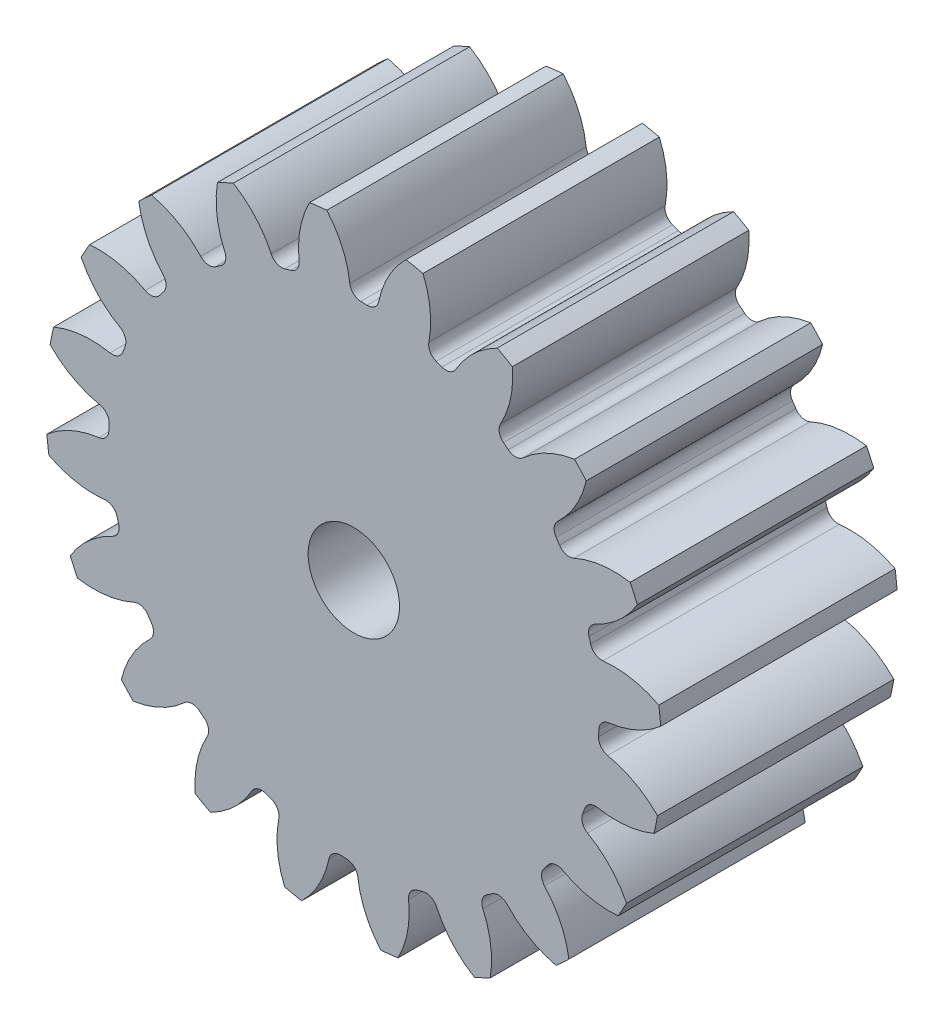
ISO-10303-21;
HEADER;
FILE_DESCRIPTION(('STEP AP214'),'2;1');
FILE_NAME('part.step','',(''),(''),'','','');
FILE_SCHEMA(('AUTOMOTIVE_DESIGN { 1 0 10303 214 1 1 1 1 }'));
ENDSEC;
DATA;
#1=APPLICATION_CONTEXT('core data for automotive mechanical design processes');
#2=APPLICATION_PROTOCOL_DEFINITION('international standard','automotive_design',2000,#1);
#3=PRODUCT_CONTEXT('',#1,'mechanical');
#4=PRODUCT('Part','Part','',(#3));
#5=PRODUCT_RELATED_PRODUCT_CATEGORY('part','',(#4));
#6=PRODUCT_DEFINITION_FORMATION('','',#4);
#7=PRODUCT_DEFINITION_CONTEXT('part definition',#1,'design');
#8=PRODUCT_DEFINITION('design','',#6,#7);
#9=PRODUCT_DEFINITION_SHAPE('','',#8);
#10=(LENGTH_UNIT() NAMED_UNIT(*) SI_UNIT(.MILLI.,.METRE.));
#11=(NAMED_UNIT(*) PLANE_ANGLE_UNIT() SI_UNIT($,.RADIAN.));
#12=(NAMED_UNIT(*) SI_UNIT($,.STERADIAN.) SOLID_ANGLE_UNIT());
#13=UNCERTAINTY_MEASURE_WITH_UNIT(LENGTH_MEASURE(1.E-05),#10,'distance_accuracy_value','');
#14=(GEOMETRIC_REPRESENTATION_CONTEXT(3) GLOBAL_UNCERTAINTY_ASSIGNED_CONTEXT((#13)) GLOBAL_UNIT_ASSIGNED_CONTEXT((#10,
#11,#12)) REPRESENTATION_CONTEXT('',''));
#15=CARTESIAN_POINT('',(0.,0.,0.));
#16=DIRECTION('',(0.,0.,1.));
#17=DIRECTION('',(1.,0.,0.));
#18=AXIS2_PLACEMENT_3D('',#15,#16,#17);
#19=CARTESIAN_POINT('',(0.,0.,95.25));
#20=DIRECTION('',(0.,0.,-1.));
#21=DIRECTION('',(-1.,0.,0.));
#22=AXIS2_PLACEMENT_3D('',#19,#20,#21);
#23=CYLINDRICAL_SURFACE('',#22,124.177777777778);
#24=DIRECTION('',(0.,0.,-1.));
#25=VECTOR('',#24,1.);
#26=CARTESIAN_POINT('',(122.887548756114,17.854155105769,47.625));
#27=LINE('',#26,#25);
#28=CARTESIAN_POINT('',(122.887548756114,17.854155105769,95.25));
#29=VERTEX_POINT('',#28);
#30=CARTESIAN_POINT('',(122.887548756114,17.854155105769,0.));
#31=VERTEX_POINT('',#30);
#32=EDGE_CURVE('E816',#29,#31,#27,.T.);
#33=ORIENTED_EDGE('',*,*,#32,.F.);
#34=CARTESIAN_POINT('',(0.,0.,95.25));
#35=DIRECTION('',(0.,0.,1.));
#36=DIRECTION('',(1.,0.,0.));
#37=AXIS2_PLACEMENT_3D('',#34,#35,#36);
#38=CIRCLE('',#37,124.177777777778);
#39=CARTESIAN_POINT('',(123.700183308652,10.8804937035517,95.25));
#40=VERTEX_POINT('',#39);
#41=EDGE_CURVE('E1537',#40,#29,#38,.T.);
#42=ORIENTED_EDGE('',*,*,#41,.F.);
#43=DIRECTION('',(0.,0.,-1.));
#44=VECTOR('',#43,1.);
#45=CARTESIAN_POINT('',(123.700183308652,10.8804937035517,47.625));
#46=LINE('',#45,#44);
#47=CARTESIAN_POINT('',(123.700183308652,10.8804937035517,0.));
#48=VERTEX_POINT('',#47);
#49=EDGE_CURVE('E1531',#48,#40,#46,.F.);
#50=ORIENTED_EDGE('',*,*,#49,.F.);
#51=CARTESIAN_POINT('',(0.,0.,0.));
#52=DIRECTION('',(0.,0.,1.));
#53=DIRECTION('',(1.,0.,0.));
#54=AXIS2_PLACEMENT_3D('',#51,#52,#53);
#55=CIRCLE('',#54,124.177777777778);
#56=EDGE_CURVE('E1542',#48,#31,#55,.T.);
#57=ORIENTED_EDGE('',*,*,#56,.T.);
#58=EDGE_LOOP('',(#33,#42,#50,#57));
#59=FACE_BOUND('',#58,.T.);
#60=ADVANCED_FACE('F33',(#59),#23,.T.);
#61=DIRECTION('',(0.,0.,-1.));
#62=VECTOR('',#61,1.);
#63=CARTESIAN_POINT('',(114.283607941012,48.5734232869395,47.625));
#64=LINE('',#63,#62);
#65=CARTESIAN_POINT('',(114.283607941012,48.5734232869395,0.));
#66=VERTEX_POINT('',#65);
#67=CARTESIAN_POINT('',(114.283607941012,48.5734232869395,95.25));
#68=VERTEX_POINT('',#67);
#69=EDGE_CURVE('E787',#66,#68,#64,.F.);
#70=ORIENTED_EDGE('',*,*,#69,.F.);
#71=CARTESIAN_POINT('',(111.355766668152,54.9546515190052,0.));
#72=VERTEX_POINT('',#71);
#73=EDGE_CURVE('E1545',#66,#72,#55,.T.);
#74=ORIENTED_EDGE('',*,*,#73,.T.);
#75=DIRECTION('',(0.,0.,-1.));
#76=VECTOR('',#75,1.);
#77=CARTESIAN_POINT('',(111.355766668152,54.9546515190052,47.625));
#78=LINE('',#77,#76);
#79=CARTESIAN_POINT('',(111.355766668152,54.9546515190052,95.25));
#80=VERTEX_POINT('',#79);
#81=EDGE_CURVE('E849',#80,#72,#78,.T.);
#82=ORIENTED_EDGE('',*,*,#81,.F.);
#83=EDGE_CURVE('E1540',#68,#80,#38,.T.);
#84=ORIENTED_EDGE('',*,*,#83,.F.);
#85=EDGE_LOOP('',(#70,#74,#82,#84));
#86=FACE_BOUND('',#85,.T.);
#87=ADVANCED_FACE('F1771',(#86),#23,.T.);
#88=CARTESIAN_POINT('',(0.,0.,95.25));
#89=DIRECTION('',(0.,0.,1.));
#90=DIRECTION('',(1.,0.,0.));
#91=AXIS2_PLACEMENT_3D('',#88,#89,#90);
#92=PLANE('',#91);
#93=CARTESIAN_POINT('',(0.,0.,95.2500000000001));
#94=DIRECTION('',(0.,0.,1.));
#95=DIRECTION('',(1.,0.,0.));
#96=AXIS2_PLACEMENT_3D('',#93,#94,#95);
#97=CIRCLE('',#96,18.415);
#98=CARTESIAN_POINT('',(18.415,0.,95.2499999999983));
#99=VERTEX_POINT('',#98);
#100=EDGE_CURVE('E804',#99,#99,#97,.T.);
#101=ORIENTED_EDGE('',*,*,#100,.F.);
#102=EDGE_LOOP('',(#101));
#103=FACE_BOUND('',#102,.T.);
#104=ORIENTED_EDGE('',*,*,#41,.T.);
#105=CARTESIAN_POINT('',(104.714275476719,-16.972580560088,95.25));
#106=DIRECTION('',(0.,0.,-1.));
#107=DIRECTION('',(0.951056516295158,0.309016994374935,0.));
#108=AXIS2_PLACEMENT_3D('',#105,#106,#107);
#109=CIRCLE('',#108,39.2831946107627);
#110=CARTESIAN_POINT('',(100.387268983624,22.0715789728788,95.25));
#111=VERTEX_POINT('',#110);
#112=EDGE_CURVE('E796',#111,#29,#109,.T.);
#113=ORIENTED_EDGE('',*,*,#112,.F.);
#114=CARTESIAN_POINT('',(99.881180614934,26.6381991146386,95.25));
#115=DIRECTION('',(0.,0.,1.));
#116=DIRECTION('',(-0.951056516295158,-0.309016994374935,0.));
#117=AXIS2_PLACEMENT_3D('',#114,#115,#116);
#118=CIRCLE('',#117,4.59457777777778);
#119=CARTESIAN_POINT('',(95.4417746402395,25.4542145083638,95.25));
#120=VERTEX_POINT('',#119);
#121=EDGE_CURVE('E794',#120,#111,#118,.T.);
#122=ORIENTED_EDGE('',*,*,#121,.F.);
#123=CARTESIAN_POINT('',(0.,0.,95.25));
#124=DIRECTION('',(0.,0.,-1.));
#125=DIRECTION('',(0.951056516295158,0.309016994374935,0.));
#126=AXIS2_PLACEMENT_3D('',#123,#124,#125);
#127=CIRCLE('',#126,98.7777777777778);
#128=CARTESIAN_POINT('',(94.7782728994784,27.8231624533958,95.25));
#129=VERTEX_POINT('',#128);
#130=EDGE_CURVE('E779',#129,#120,#127,.T.);
#131=ORIENTED_EDGE('',*,*,#130,.F.);
#132=CARTESIAN_POINT('',(99.1868165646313,29.117336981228,95.25));
#133=DIRECTION('',(0.,0.,1.));
#134=DIRECTION('',(-0.951056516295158,-0.309016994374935,0.));
#135=AXIS2_PLACEMENT_3D('',#132,#133,#134);
#136=CIRCLE('',#135,4.59457777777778);
#137=CARTESIAN_POINT('',(97.2472889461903,33.2824753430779,95.25));
#138=VERTEX_POINT('',#137);
#139=EDGE_CURVE('E771',#138,#129,#136,.T.);
#140=ORIENTED_EDGE('',*,*,#139,.F.);
#141=CARTESIAN_POINT('',(80.6645158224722,68.894004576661,95.25));
#142=DIRECTION('',(0.,0.,-1.));
#143=DIRECTION('',(-0.951056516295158,-0.309016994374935,0.));
#144=AXIS2_PLACEMENT_3D('',#141,#142,#143);
#145=CIRCLE('',#144,39.2831946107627);
#146=EDGE_CURVE('E801',#68,#138,#145,.T.);
#147=ORIENTED_EDGE('',*,*,#146,.F.);
#148=ORIENTED_EDGE('',*,*,#83,.T.);
#149=CARTESIAN_POINT('',(104.834009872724,16.2166073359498,95.25));
#150=DIRECTION('',(0.,0.,-1.));
#151=DIRECTION('',(0.809016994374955,0.587785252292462,0.));
#152=AXIS2_PLACEMENT_3D('',#149,#150,#151);
#153=CIRCLE('',#152,39.2831946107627);
#154=CARTESIAN_POINT('',(88.6534733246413,52.0126911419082,95.25));
#155=VERTEX_POINT('',#154);
#156=EDGE_CURVE('E825',#155,#80,#153,.T.);
#157=ORIENTED_EDGE('',*,*,#156,.F.);
#158=CARTESIAN_POINT('',(86.7609914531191,56.199415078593,95.25));
#159=DIRECTION('',(0.,0.,1.));
#160=DIRECTION('',(-0.809016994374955,-0.587785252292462,0.));
#161=AXIS2_PLACEMENT_3D('',#158,#159,#160);
#162=CIRCLE('',#161,4.59457777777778);
#163=CARTESIAN_POINT('',(82.9047368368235,53.7015269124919,95.25));
#164=VERTEX_POINT('',#163);
#165=EDGE_CURVE('E823',#164,#155,#162,.T.);
#166=ORIENTED_EDGE('',*,*,#165,.F.);
#167=CARTESIAN_POINT('',(0.,0.,95.25));
#168=DIRECTION('',(0.,0.,-1.));
#169=DIRECTION('',(0.809016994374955,0.587785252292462,0.));
#170=AXIS2_PLACEMENT_3D('',#167,#168,#169);
#171=CIRCLE('',#170,98.7777777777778);
#172=CARTESIAN_POINT('',(81.5416640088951,55.749496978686,95.25));
#173=VERTEX_POINT('',#172);
#174=EDGE_CURVE('E820',#173,#164,#171,.T.);
#175=ORIENTED_EDGE('',*,*,#174,.F.);
#176=CARTESIAN_POINT('',(85.3345162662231,58.3426450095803,95.25));
#177=DIRECTION('',(0.,0.,1.));
#178=DIRECTION('',(-0.809016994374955,-0.587785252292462,0.));
#179=AXIS2_PLACEMENT_3D('',#176,#177,#178);
#180=CIRCLE('',#179,4.59457777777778);
#181=CARTESIAN_POINT('',(82.2028173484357,61.7045799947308,95.25));
#182=VERTEX_POINT('',#181);
#183=EDGE_CURVE('E818',#182,#173,#180,.T.);
#184=ORIENTED_EDGE('',*,*,#183,.F.);
#185=CARTESIAN_POINT('',(55.4270951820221,90.4487982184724,95.25));
#186=DIRECTION('',(0.,0.,-1.));
#187=DIRECTION('',(-0.809016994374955,-0.587785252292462,0.));
#188=AXIS2_PLACEMENT_3D('',#185,#186,#187);
#189=CIRCLE('',#188,39.2831946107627);
#190=CARTESIAN_POINT('',(93.680156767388,81.511647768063,95.25));
#191=VERTEX_POINT('',#190);
#192=EDGE_CURVE('E828',#191,#182,#189,.T.);
#193=ORIENTED_EDGE('',*,*,#192,.F.);
#194=CARTESIAN_POINT('',(88.9237062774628,86.6758037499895,95.25));
#195=VERTEX_POINT('',#194);
#196=EDGE_CURVE('E1593',#191,#195,#38,.T.);
#197=ORIENTED_EDGE('',*,*,#196,.T.);
#198=CARTESIAN_POINT('',(94.691860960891,47.8184007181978,95.25));
#199=DIRECTION('',(0.,0.,-1.));
#200=DIRECTION('',(0.587785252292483,0.80901699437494,0.));
#201=AXIS2_PLACEMENT_3D('',#198,#199,#200);
#202=CIRCLE('',#201,39.2831946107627);
#203=CARTESIAN_POINT('',(68.2416580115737,76.8624387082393,95.25));
#204=VERTEX_POINT('',#203);
#205=EDGE_CURVE('E860',#204,#195,#202,.T.);
#206=ORIENTED_EDGE('',*,*,#205,.F.);
#207=CARTESIAN_POINT('',(65.1480319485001,80.2594407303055,95.25));
#208=DIRECTION('',(0.,0.,1.));
#209=DIRECTION('',(-0.587785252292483,-0.80901699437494,0.));
#210=AXIS2_PLACEMENT_3D('',#207,#208,#209);
#211=CIRCLE('',#210,4.59457777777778);
#212=CARTESIAN_POINT('',(62.2524057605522,76.6921597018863,95.25));
#213=VERTEX_POINT('',#212);
#214=EDGE_CURVE('E858',#213,#204,#211,.T.);
#215=ORIENTED_EDGE('',*,*,#214,.F.);
#216=CARTESIAN_POINT('',(0.,0.,95.25));
#217=DIRECTION('',(0.,0.,-1.));
#218=DIRECTION('',(0.587785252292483,0.80901699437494,0.));
#219=AXIS2_PLACEMENT_3D('',#216,#217,#218);
#220=CIRCLE('',#219,98.7777777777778);
#221=CARTESIAN_POINT('',(60.3231889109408,78.218682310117,95.25));
#222=VERTEX_POINT('',#221);
#223=EDGE_CURVE('E855',#222,#213,#220,.T.);
#224=ORIENTED_EDGE('',*,*,#223,.F.);
#225=CARTESIAN_POINT('',(63.1290789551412,81.8569684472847,95.25));
#226=DIRECTION('',(0.,0.,1.));
#227=DIRECTION('',(-0.587785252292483,-0.80901699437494,0.));
#228=AXIS2_PLACEMENT_3D('',#225,#226,#227);
#229=CIRCLE('',#228,4.59457777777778);
#230=CARTESIAN_POINT('',(59.1117612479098,84.0866104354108,95.25));
#231=VERTEX_POINT('',#230);
#232=EDGE_CURVE('E853',#231,#222,#229,.T.);
#233=ORIENTED_EDGE('',*,*,#232,.F.);
#234=CARTESIAN_POINT('',(24.7640842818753,103.149833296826,95.25));
#235=DIRECTION('',(0.,0.,-1.));
#236=DIRECTION('',(-0.587785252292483,-0.80901699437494,0.));
#237=AXIS2_PLACEMENT_3D('',#234,#235,#236);
#238=CIRCLE('',#237,39.2831946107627);
#239=CARTESIAN_POINT('',(63.9066391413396,106.470944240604,95.25));
#240=VERTEX_POINT('',#239);
#241=EDGE_CURVE('E863',#240,#231,#238,.T.);
#242=ORIENTED_EDGE('',*,*,#241,.F.);
#243=CARTESIAN_POINT('',(57.7871739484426,109.91252440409,95.25));
#244=VERTEX_POINT('',#243);
#245=EDGE_CURVE('E1753',#240,#244,#38,.T.);
#246=ORIENTED_EDGE('',*,*,#245,.T.);
#247=CARTESIAN_POINT('',(75.2806129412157,74.7393958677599,95.25));
#248=DIRECTION('',(0.,0.,-1.));
#249=DIRECTION('',(0.309016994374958,0.95105651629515,0.));
#250=AXIS2_PLACEMENT_3D('',#247,#248,#249);
#251=CIRCLE('',#250,39.2831946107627);
#252=CARTESIAN_POINT('',(41.1498737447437,94.1883552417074,95.25));
#253=VERTEX_POINT('',#252);
#254=EDGE_CURVE('E898',#253,#244,#251,.T.);
#255=ORIENTED_EDGE('',*,*,#254,.F.);
#256=CARTESIAN_POINT('',(37.1579291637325,96.4631131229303,95.25));
#257=DIRECTION('',(0.,0.,1.));
#258=DIRECTION('',(-0.309016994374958,-0.95105651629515,0.));
#259=AXIS2_PLACEMENT_3D('',#256,#257,#258);
#260=CIRCLE('',#259,4.59457777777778);
#261=CARTESIAN_POINT('',(35.5063754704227,92.175629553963,95.25));
#262=VERTEX_POINT('',#261);
#263=EDGE_CURVE('E896',#262,#253,#260,.T.);
#264=ORIENTED_EDGE('',*,*,#263,.F.);
#265=CARTESIAN_POINT('',(0.,0.,95.25));
#266=DIRECTION('',(0.,0.,-1.));
#267=DIRECTION('',(0.309016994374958,0.95105651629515,0.));
#268=AXIS2_PLACEMENT_3D('',#265,#266,#267);
#269=CIRCLE('',#268,98.7777777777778);
#270=CARTESIAN_POINT('',(33.1998597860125,93.0312780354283,95.25));
#271=VERTEX_POINT('',#270);
#272=EDGE_CURVE('E893',#271,#262,#269,.T.);
#273=ORIENTED_EDGE('',*,*,#272,.F.);
#274=CARTESIAN_POINT('',(34.7441275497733,97.3585614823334,95.25));
#275=DIRECTION('',(0.,0.,1.));
#276=DIRECTION('',(-0.309016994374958,-0.95105651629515,0.));
#277=AXIS2_PLACEMENT_3D('',#274,#275,#276);
#278=CIRCLE('',#277,4.59457777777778);
#279=CARTESIAN_POINT('',(30.2344341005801,98.2376575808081,95.25));
#280=VERTEX_POINT('',#279);
#281=EDGE_CURVE('E891',#280,#271,#278,.T.);
#282=ORIENTED_EDGE('',*,*,#281,.F.);
#283=CARTESIAN_POINT('',(-8.32300772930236,105.753844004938,95.25));
#284=DIRECTION('',(0.,0.,-1.));
#285=DIRECTION('',(-0.309016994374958,-0.95105651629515,0.));
#286=AXIS2_PLACEMENT_3D('',#283,#284,#285);
#287=CIRCLE('',#286,39.2831946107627);
#288=CARTESIAN_POINT('',(27.8774944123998,121.008122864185,95.25));
#289=VERTEX_POINT('',#288);
#290=EDGE_CURVE('E901',#289,#280,#287,.T.);
#291=ORIENTED_EDGE('',*,*,#290,.F.);
#292=CARTESIAN_POINT('',(20.9940304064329,122.39024136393,95.25));
#293=VERTEX_POINT('',#292);
#294=EDGE_CURVE('E1749',#289,#293,#38,.T.);
#295=ORIENTED_EDGE('',*,*,#294,.T.);
#296=CARTESIAN_POINT('',(48.5003740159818,94.3443782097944,95.25));
#297=DIRECTION('',(0.,0.,-1.));
#298=DIRECTION('',(0.,1.,0.));
#299=AXIS2_PLACEMENT_3D('',#296,#297,#298);
#300=CIRCLE('',#299,39.2831946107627);
#301=CARTESIAN_POINT('',(10.030053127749,102.294459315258,95.25));
#302=VERTEX_POINT('',#301);
#303=EDGE_CURVE('E936',#302,#293,#300,.T.);
#304=ORIENTED_EDGE('',*,*,#303,.F.);
#305=CARTESIAN_POINT('',(5.53054937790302,103.224303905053,95.25));
#306=DIRECTION('',(0.,0.,1.));
#307=DIRECTION('',(0.,-1.,0.));
#308=AXIS2_PLACEMENT_3D('',#305,#306,#307);
#309=CIRCLE('',#308,4.59457777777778);
#310=CARTESIAN_POINT('',(5.28473376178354,98.6363065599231,95.25));
#311=VERTEX_POINT('',#310);
#312=EDGE_CURVE('E934',#311,#302,#309,.T.);
#313=ORIENTED_EDGE('',*,*,#312,.F.);
#314=CARTESIAN_POINT('',(0.,0.,95.25));
#315=DIRECTION('',(0.,0.,-1.));
#316=DIRECTION('',(0.,1.,0.));
#317=AXIS2_PLACEMENT_3D('',#314,#315,#316);
#318=CIRCLE('',#317,98.7777777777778);
#319=CARTESIAN_POINT('',(2.82669706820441,98.7373240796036,95.25));
#320=VERTEX_POINT('',#319);
#321=EDGE_CURVE('E931',#320,#311,#318,.T.);
#322=ORIENTED_EDGE('',*,*,#321,.F.);
#323=CARTESIAN_POINT('',(2.95817886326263,103.330020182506,95.25));
#324=DIRECTION('',(0.,0.,1.));
#325=DIRECTION('',(0.,-1.,0.));
#326=AXIS2_PLACEMENT_3D('',#323,#324,#325);
#327=CIRCLE('',#326,4.59457777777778);
#328=CARTESIAN_POINT('',(-1.60245011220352,102.772518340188,95.25));
#329=VERTEX_POINT('',#328);
#330=EDGE_CURVE('E929',#329,#320,#327,.T.);
#331=ORIENTED_EDGE('',*,*,#330,.F.);
#332=CARTESIAN_POINT('',(-40.5953857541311,98.0059316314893,95.25));
#333=DIRECTION('',(0.,0.,-1.));
#334=DIRECTION('',(0.,-1.,0.));
#335=AXIS2_PLACEMENT_3D('',#332,#333,#334);
#336=CIRCLE('',#335,39.2831946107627);
#337=CARTESIAN_POINT('',(-10.8804937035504,123.700183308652,95.25));
#338=VERTEX_POINT('',#337);
#339=EDGE_CURVE('E939',#338,#329,#336,.T.);
#340=ORIENTED_EDGE('',*,*,#339,.F.);
#341=CARTESIAN_POINT('',(-17.8541551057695,122.887548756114,95.25));
#342=VERTEX_POINT('',#341);
#343=EDGE_CURVE('E1745',#338,#342,#38,.T.);
#344=ORIENTED_EDGE('',*,*,#343,.T.);
#345=CARTESIAN_POINT('',(16.9725805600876,104.714275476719,95.25));
#346=DIRECTION('',(0.,0.,-1.));
#347=DIRECTION('',(-0.309016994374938,0.951056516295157,0.));
#348=AXIS2_PLACEMENT_3D('',#345,#346,#347);
#349=CIRCLE('',#348,39.2831946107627);
#350=CARTESIAN_POINT('',(-22.0715789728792,100.387268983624,95.25));
#351=VERTEX_POINT('',#350);
#352=EDGE_CURVE('E974',#351,#342,#349,.T.);
#353=ORIENTED_EDGE('',*,*,#352,.F.);
#354=CARTESIAN_POINT('',(-26.638199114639,99.8811806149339,95.25));
#355=DIRECTION('',(0.,0.,1.));
#356=DIRECTION('',(0.309016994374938,-0.951056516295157,0.));
#357=AXIS2_PLACEMENT_3D('',#354,#355,#356);
#358=CIRCLE('',#357,4.59457777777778);
#359=CARTESIAN_POINT('',(-25.4542145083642,95.4417746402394,95.25));
#360=VERTEX_POINT('',#359);
#361=EDGE_CURVE('E972',#360,#351,#358,.T.);
#362=ORIENTED_EDGE('',*,*,#361,.F.);
#363=CARTESIAN_POINT('',(0.,0.,95.25));
#364=DIRECTION('',(0.,0.,-1.));
#365=DIRECTION('',(-0.309016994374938,0.951056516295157,0.));
#366=AXIS2_PLACEMENT_3D('',#363,#364,#365);
#367=CIRCLE('',#366,98.7777777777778);
#368=CARTESIAN_POINT('',(-27.8231624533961,94.7782728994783,95.25));
#369=VERTEX_POINT('',#368);
#370=EDGE_CURVE('E969',#369,#360,#367,.T.);
#371=ORIENTED_EDGE('',*,*,#370,.F.);
#372=CARTESIAN_POINT('',(-29.1173369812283,99.1868165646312,95.25));
#373=DIRECTION('',(0.,0.,1.));
#374=DIRECTION('',(0.309016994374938,-0.951056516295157,0.));
#375=AXIS2_PLACEMENT_3D('',#372,#373,#374);
#376=CIRCLE('',#375,4.59457777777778);
#377=CARTESIAN_POINT('',(-33.2824753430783,97.2472889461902,95.25));
#378=VERTEX_POINT('',#377);
#379=EDGE_CURVE('E967',#378,#369,#376,.T.);
#380=ORIENTED_EDGE('',*,*,#379,.F.);
#381=CARTESIAN_POINT('',(-68.8940045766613,80.664515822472,95.25));
#382=DIRECTION('',(0.,0.,-1.));
#383=DIRECTION('',(0.309016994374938,-0.951056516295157,0.));
#384=AXIS2_PLACEMENT_3D('',#381,#382,#383);
#385=CIRCLE('',#384,39.2831946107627);
#386=CARTESIAN_POINT('',(-48.5734232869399,114.283607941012,95.25));
#387=VERTEX_POINT('',#386);
#388=EDGE_CURVE('E977',#387,#378,#385,.T.);
#389=ORIENTED_EDGE('',*,*,#388,.F.);
#390=CARTESIAN_POINT('',(-54.9546515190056,111.355766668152,95.25));
#391=VERTEX_POINT('',#390);
#392=EDGE_CURVE('E1741',#387,#391,#38,.T.);
#393=ORIENTED_EDGE('',*,*,#392,.T.);
#394=CARTESIAN_POINT('',(-16.2166073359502,104.834009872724,95.25));
#395=DIRECTION('',(0.,0.,-1.));
#396=DIRECTION('',(-0.587785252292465,0.809016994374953,0.));
#397=AXIS2_PLACEMENT_3D('',#394,#395,#396);
#398=CIRCLE('',#397,39.2831946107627);
#399=CARTESIAN_POINT('',(-52.0126911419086,88.6534733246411,95.25));
#400=VERTEX_POINT('',#399);
#401=EDGE_CURVE('E1012',#400,#391,#398,.T.);
#402=ORIENTED_EDGE('',*,*,#401,.F.);
#403=CARTESIAN_POINT('',(-56.1994150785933,86.760991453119,95.25));
#404=DIRECTION('',(0.,0.,1.));
#405=DIRECTION('',(0.587785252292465,-0.809016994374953,0.));
#406=AXIS2_PLACEMENT_3D('',#403,#404,#405);
#407=CIRCLE('',#406,4.59457777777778);
#408=CARTESIAN_POINT('',(-53.7015269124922,82.9047368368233,95.25));
#409=VERTEX_POINT('',#408);
#410=EDGE_CURVE('E1010',#409,#400,#407,.T.);
#411=ORIENTED_EDGE('',*,*,#410,.F.);
#412=CARTESIAN_POINT('',(0.,0.,95.25));
#413=DIRECTION('',(0.,0.,-1.));
#414=DIRECTION('',(-0.587785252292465,0.809016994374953,0.));
#415=AXIS2_PLACEMENT_3D('',#412,#413,#414);
#416=CIRCLE('',#415,98.7777777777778);
#417=CARTESIAN_POINT('',(-55.7494969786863,81.5416640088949,95.25));
#418=VERTEX_POINT('',#417);
#419=EDGE_CURVE('E1007',#418,#409,#416,.T.);
#420=ORIENTED_EDGE('',*,*,#419,.F.);
#421=CARTESIAN_POINT('',(-58.3426450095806,85.3345162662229,95.25));
#422=DIRECTION('',(0.,0.,1.));
#423=DIRECTION('',(0.587785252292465,-0.809016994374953,0.));
#424=AXIS2_PLACEMENT_3D('',#421,#422,#423);
#425=CIRCLE('',#424,4.59457777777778);
#426=CARTESIAN_POINT('',(-61.7045799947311,82.2028173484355,95.25));
#427=VERTEX_POINT('',#426);
#428=EDGE_CURVE('E1005',#427,#418,#425,.T.);
#429=ORIENTED_EDGE('',*,*,#428,.F.);
#430=CARTESIAN_POINT('',(-90.4487982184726,55.4270951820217,95.25));
#431=DIRECTION('',(0.,0.,-1.));
#432=DIRECTION('',(0.587785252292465,-0.809016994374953,0.));
#433=AXIS2_PLACEMENT_3D('',#430,#431,#432);
#434=CIRCLE('',#433,39.2831946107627);
#435=CARTESIAN_POINT('',(-81.5116477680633,93.6801567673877,95.25));
#436=VERTEX_POINT('',#435);
#437=EDGE_CURVE('E1015',#436,#427,#434,.T.);
#438=ORIENTED_EDGE('',*,*,#437,.F.);
#439=CARTESIAN_POINT('',(-86.6758037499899,88.9237062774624,95.25));
#440=VERTEX_POINT('',#439);
#441=EDGE_CURVE('E1737',#436,#440,#38,.T.);
#442=ORIENTED_EDGE('',*,*,#441,.T.);
#443=CARTESIAN_POINT('',(-47.8184007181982,94.6918609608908,95.25));
#444=DIRECTION('',(0.,0.,-1.));
#445=DIRECTION('',(-0.809016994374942,0.58778525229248,0.));
#446=AXIS2_PLACEMENT_3D('',#443,#444,#445);
#447=CIRCLE('',#446,39.2831946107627);
#448=CARTESIAN_POINT('',(-76.8624387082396,68.2416580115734,95.25));
#449=VERTEX_POINT('',#448);
#450=EDGE_CURVE('E1050',#449,#440,#447,.T.);
#451=ORIENTED_EDGE('',*,*,#450,.F.);
#452=CARTESIAN_POINT('',(-80.2594407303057,65.1480319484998,95.25));
#453=DIRECTION('',(0.,0.,1.));
#454=DIRECTION('',(0.809016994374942,-0.58778525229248,0.));
#455=AXIS2_PLACEMENT_3D('',#452,#453,#454);
#456=CIRCLE('',#455,4.59457777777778);
#457=CARTESIAN_POINT('',(-76.6921597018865,62.2524057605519,95.25));
#458=VERTEX_POINT('',#457);
#459=EDGE_CURVE('E1048',#458,#449,#456,.T.);
#460=ORIENTED_EDGE('',*,*,#459,.F.);
#461=CARTESIAN_POINT('',(0.,0.,95.25));
#462=DIRECTION('',(0.,0.,-1.));
#463=DIRECTION('',(-0.809016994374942,0.58778525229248,0.));
#464=AXIS2_PLACEMENT_3D('',#461,#462,#463);
#465=CIRCLE('',#464,98.7777777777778);
#466=CARTESIAN_POINT('',(-78.2186823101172,60.3231889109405,95.25));
#467=VERTEX_POINT('',#466);
#468=EDGE_CURVE('E1045',#467,#458,#465,.T.);
#469=ORIENTED_EDGE('',*,*,#468,.F.);
#470=CARTESIAN_POINT('',(-81.8569684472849,63.1290789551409,95.25));
#471=DIRECTION('',(0.,0.,1.));
#472=DIRECTION('',(0.809016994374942,-0.58778525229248,0.));
#473=AXIS2_PLACEMENT_3D('',#470,#471,#472);
#474=CIRCLE('',#473,4.59457777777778);
#475=CARTESIAN_POINT('',(-84.086610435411,59.1117612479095,95.25));
#476=VERTEX_POINT('',#475);
#477=EDGE_CURVE('E1043',#476,#467,#474,.T.);
#478=ORIENTED_EDGE('',*,*,#477,.F.);
#479=CARTESIAN_POINT('',(-103.149833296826,24.7640842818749,95.25));
#480=DIRECTION('',(0.,0.,-1.));
#481=DIRECTION('',(0.809016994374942,-0.58778525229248,0.));
#482=AXIS2_PLACEMENT_3D('',#479,#480,#481);
#483=CIRCLE('',#482,39.2831946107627);
#484=CARTESIAN_POINT('',(-106.470944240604,63.9066391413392,95.25));
#485=VERTEX_POINT('',#484);
#486=EDGE_CURVE('E1053',#485,#476,#483,.T.);
#487=ORIENTED_EDGE('',*,*,#486,.F.);
#488=CARTESIAN_POINT('',(-109.91252440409,57.7871739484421,95.25));
#489=VERTEX_POINT('',#488);
#490=EDGE_CURVE('E1733',#485,#489,#38,.T.);
#491=ORIENTED_EDGE('',*,*,#490,.T.);
#492=CARTESIAN_POINT('',(-74.7393958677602,75.2806129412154,95.25));
#493=DIRECTION('',(0.,0.,-1.));
#494=DIRECTION('',(-0.951056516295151,0.309016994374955,0.));
#495=AXIS2_PLACEMENT_3D('',#492,#493,#494);
#496=CIRCLE('',#495,39.2831946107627);
#497=CARTESIAN_POINT('',(-94.1883552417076,41.1498737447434,95.25));
#498=VERTEX_POINT('',#497);
#499=EDGE_CURVE('E1088',#498,#489,#496,.T.);
#500=ORIENTED_EDGE('',*,*,#499,.F.);
#501=CARTESIAN_POINT('',(-96.4631131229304,37.1579291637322,95.25));
#502=DIRECTION('',(0.,0.,1.));
#503=DIRECTION('',(0.951056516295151,-0.309016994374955,0.));
#504=AXIS2_PLACEMENT_3D('',#501,#502,#503);
#505=CIRCLE('',#504,4.59457777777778);
#506=CARTESIAN_POINT('',(-92.1756295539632,35.5063754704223,95.25));
#507=VERTEX_POINT('',#506);
#508=EDGE_CURVE('E1086',#507,#498,#505,.T.);
#509=ORIENTED_EDGE('',*,*,#508,.F.);
#510=CARTESIAN_POINT('',(0.,0.,95.25));
#511=DIRECTION('',(0.,0.,-1.));
#512=DIRECTION('',(-0.951056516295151,0.309016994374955,0.));
#513=AXIS2_PLACEMENT_3D('',#510,#511,#512);
#514=CIRCLE('',#513,98.7777777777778);
#515=CARTESIAN_POINT('',(-93.0312780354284,33.1998597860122,95.25));
#516=VERTEX_POINT('',#515);
#517=EDGE_CURVE('E1083',#516,#507,#514,.T.);
#518=ORIENTED_EDGE('',*,*,#517,.F.);
#519=CARTESIAN_POINT('',(-97.3585614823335,34.744127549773,95.25));
#520=DIRECTION('',(0.,0.,1.));
#521=DIRECTION('',(0.951056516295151,-0.309016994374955,0.));
#522=AXIS2_PLACEMENT_3D('',#519,#520,#521);
#523=CIRCLE('',#522,4.59457777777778);
#524=CARTESIAN_POINT('',(-98.2376575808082,30.2344341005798,95.25));
#525=VERTEX_POINT('',#524);
#526=EDGE_CURVE('E1081',#525,#516,#523,.T.);
#527=ORIENTED_EDGE('',*,*,#526,.F.);
#528=CARTESIAN_POINT('',(-105.753844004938,-8.32300772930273,95.25));
#529=DIRECTION('',(0.,0.,-1.));
#530=DIRECTION('',(0.951056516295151,-0.309016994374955,0.));
#531=AXIS2_PLACEMENT_3D('',#528,#529,#530);
#532=CIRCLE('',#531,39.2831946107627);
#533=CARTESIAN_POINT('',(-121.008122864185,27.8774944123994,95.25));
#534=VERTEX_POINT('',#533);
#535=EDGE_CURVE('E1091',#534,#525,#532,.T.);
#536=ORIENTED_EDGE('',*,*,#535,.F.);
#537=CARTESIAN_POINT('',(-122.39024136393,20.9940304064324,95.25));
#538=VERTEX_POINT('',#537);
#539=EDGE_CURVE('E1729',#534,#538,#38,.T.);
#540=ORIENTED_EDGE('',*,*,#539,.T.);
#541=CARTESIAN_POINT('',(-94.3443782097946,48.5003740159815,95.25));
#542=DIRECTION('',(0.,0.,-1.));
#543=DIRECTION('',(-1.,0.,0.));
#544=AXIS2_PLACEMENT_3D('',#541,#542,#543);
#545=CIRCLE('',#544,39.2831946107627);
#546=CARTESIAN_POINT('',(-102.294459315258,10.0300531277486,95.25));
#547=VERTEX_POINT('',#546);
#548=EDGE_CURVE('E1126',#547,#538,#545,.T.);
#549=ORIENTED_EDGE('',*,*,#548,.F.);
#550=CARTESIAN_POINT('',(-103.224303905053,5.53054937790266,95.25));
#551=DIRECTION('',(0.,0.,1.));
#552=DIRECTION('',(1.,0.,0.));
#553=AXIS2_PLACEMENT_3D('',#550,#551,#552);
#554=CIRCLE('',#553,4.59457777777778);
#555=CARTESIAN_POINT('',(-98.6363065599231,5.2847337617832,95.25));
#556=VERTEX_POINT('',#555);
#557=EDGE_CURVE('E1124',#556,#547,#554,.T.);
#558=ORIENTED_EDGE('',*,*,#557,.F.);
#559=CARTESIAN_POINT('',(0.,0.,95.25));
#560=DIRECTION('',(0.,0.,-1.));
#561=DIRECTION('',(-1.,0.,0.));
#562=AXIS2_PLACEMENT_3D('',#559,#560,#561);
#563=CIRCLE('',#562,98.7777777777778);
#564=CARTESIAN_POINT('',(-98.7373240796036,2.82669706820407,95.25));
#565=VERTEX_POINT('',#564);
#566=EDGE_CURVE('E1121',#565,#556,#563,.T.);
#567=ORIENTED_EDGE('',*,*,#566,.F.);
#568=CARTESIAN_POINT('',(-103.330020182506,2.95817886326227,95.25));
#569=DIRECTION('',(0.,0.,1.));
#570=DIRECTION('',(1.,0.,0.));
#571=AXIS2_PLACEMENT_3D('',#568,#569,#570);
#572=CIRCLE('',#571,4.59457777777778);
#573=CARTESIAN_POINT('',(-102.772518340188,-1.60245011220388,95.25));
#574=VERTEX_POINT('',#573);
#575=EDGE_CURVE('E1119',#574,#565,#572,.T.);
#576=ORIENTED_EDGE('',*,*,#575,.F.);
#577=CARTESIAN_POINT('',(-98.0059316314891,-40.5953857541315,95.25));
#578=DIRECTION('',(0.,0.,-1.));
#579=DIRECTION('',(1.,0.,0.));
#580=AXIS2_PLACEMENT_3D('',#577,#578,#579);
#581=CIRCLE('',#580,39.2831946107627);
#582=CARTESIAN_POINT('',(-123.700183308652,-10.8804937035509,95.25));
#583=VERTEX_POINT('',#582);
#584=EDGE_CURVE('E1129',#583,#574,#581,.T.);
#585=ORIENTED_EDGE('',*,*,#584,.F.);
#586=CARTESIAN_POINT('',(-122.887548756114,-17.8541551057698,95.25));
#587=VERTEX_POINT('',#586);
#588=EDGE_CURVE('E1725',#583,#587,#38,.T.);
#589=ORIENTED_EDGE('',*,*,#588,.T.);
#590=CARTESIAN_POINT('',(-104.714275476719,16.9725805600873,95.25));
#591=DIRECTION('',(0.,0.,-1.));
#592=DIRECTION('',(-0.951056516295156,-0.309016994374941,0.));
#593=AXIS2_PLACEMENT_3D('',#590,#591,#592);
#594=CIRCLE('',#593,39.2831946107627);
#595=CARTESIAN_POINT('',(-100.387268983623,-22.0715789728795,95.25));
#596=VERTEX_POINT('',#595);
#597=EDGE_CURVE('E1164',#596,#587,#594,.T.);
#598=ORIENTED_EDGE('',*,*,#597,.F.);
#599=CARTESIAN_POINT('',(-99.8811806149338,-26.6381991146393,95.25));
#600=DIRECTION('',(0.,0.,1.));
#601=DIRECTION('',(0.951056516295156,0.309016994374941,0.));
#602=AXIS2_PLACEMENT_3D('',#599,#600,#601);
#603=CIRCLE('',#602,4.59457777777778);
#604=CARTESIAN_POINT('',(-95.4417746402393,-25.4542145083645,95.25));
#605=VERTEX_POINT('',#604);
#606=EDGE_CURVE('E1162',#605,#596,#603,.T.);
#607=ORIENTED_EDGE('',*,*,#606,.F.);
#608=CARTESIAN_POINT('',(0.,0.,95.25));
#609=DIRECTION('',(0.,0.,-1.));
#610=DIRECTION('',(-0.951056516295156,-0.309016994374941,0.));
#611=AXIS2_PLACEMENT_3D('',#608,#609,#610);
#612=CIRCLE('',#611,98.7777777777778);
#613=CARTESIAN_POINT('',(-94.7782728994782,-27.8231624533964,95.25));
#614=VERTEX_POINT('',#613);
#615=EDGE_CURVE('E1159',#614,#605,#612,.T.);
#616=ORIENTED_EDGE('',*,*,#615,.F.);
#617=CARTESIAN_POINT('',(-99.1868165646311,-29.1173369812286,95.25));
#618=DIRECTION('',(0.,0.,1.));
#619=DIRECTION('',(0.951056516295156,0.309016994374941,0.));
#620=AXIS2_PLACEMENT_3D('',#617,#618,#619);
#621=CIRCLE('',#620,4.59457777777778);
#622=CARTESIAN_POINT('',(-97.2472889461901,-33.2824753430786,95.25));
#623=VERTEX_POINT('',#622);
#624=EDGE_CURVE('E1157',#623,#614,#621,.T.);
#625=ORIENTED_EDGE('',*,*,#624,.F.);
#626=CARTESIAN_POINT('',(-80.6645158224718,-68.8940045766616,95.25));
#627=DIRECTION('',(0.,0.,-1.));
#628=DIRECTION('',(0.951056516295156,0.309016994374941,0.));
#629=AXIS2_PLACEMENT_3D('',#626,#627,#628);
#630=CIRCLE('',#629,39.2831946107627);
#631=CARTESIAN_POINT('',(-114.283607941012,-48.5734232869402,95.25));
#632=VERTEX_POINT('',#631);
#633=EDGE_CURVE('E1167',#632,#623,#630,.T.);
#634=ORIENTED_EDGE('',*,*,#633,.F.);
#635=CARTESIAN_POINT('',(-111.355766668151,-54.954651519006,95.25));
#636=VERTEX_POINT('',#635);
#637=EDGE_CURVE('E1721',#632,#636,#38,.T.);
#638=ORIENTED_EDGE('',*,*,#637,.T.);
#639=CARTESIAN_POINT('',(-104.834009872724,-16.2166073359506,95.25));
#640=DIRECTION('',(0.,0.,-1.));
#641=DIRECTION('',(-0.809016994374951,-0.587785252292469,0.));
#642=AXIS2_PLACEMENT_3D('',#639,#640,#641);
#643=CIRCLE('',#642,39.2831946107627);
#644=CARTESIAN_POINT('',(-88.6534733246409,-52.0126911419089,95.25));
#645=VERTEX_POINT('',#644);
#646=EDGE_CURVE('E1202',#645,#636,#643,.T.);
#647=ORIENTED_EDGE('',*,*,#646,.F.);
#648=CARTESIAN_POINT('',(-86.7609914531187,-56.1994150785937,95.25));
#649=DIRECTION('',(0.,0.,1.));
#650=DIRECTION('',(0.809016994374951,0.587785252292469,0.));
#651=AXIS2_PLACEMENT_3D('',#648,#649,#650);
#652=CIRCLE('',#651,4.59457777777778);
#653=CARTESIAN_POINT('',(-82.9047368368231,-53.7015269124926,95.25));
#654=VERTEX_POINT('',#653);
#655=EDGE_CURVE('E1200',#654,#645,#652,.T.);
#656=ORIENTED_EDGE('',*,*,#655,.F.);
#657=CARTESIAN_POINT('',(0.,0.,95.25));
#658=DIRECTION('',(0.,0.,-1.));
#659=DIRECTION('',(-0.809016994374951,-0.587785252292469,0.));
#660=AXIS2_PLACEMENT_3D('',#657,#658,#659);
#661=CIRCLE('',#660,98.7777777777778);
#662=CARTESIAN_POINT('',(-81.5416640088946,-55.7494969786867,95.25));
#663=VERTEX_POINT('',#662);
#664=EDGE_CURVE('E1197',#663,#654,#661,.T.);
#665=ORIENTED_EDGE('',*,*,#664,.F.);
#666=CARTESIAN_POINT('',(-85.3345162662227,-58.342645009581,95.25));
#667=DIRECTION('',(0.,0.,1.));
#668=DIRECTION('',(0.809016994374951,0.587785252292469,0.));
#669=AXIS2_PLACEMENT_3D('',#666,#667,#668);
#670=CIRCLE('',#669,4.59457777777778);
#671=CARTESIAN_POINT('',(-82.2028173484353,-61.7045799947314,95.25));
#672=VERTEX_POINT('',#671);
#673=EDGE_CURVE('E1195',#672,#663,#670,.T.);
#674=ORIENTED_EDGE('',*,*,#673,.F.);
#675=CARTESIAN_POINT('',(-55.4270951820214,-90.4487982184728,95.25));
#676=DIRECTION('',(0.,0.,-1.));
#677=DIRECTION('',(0.809016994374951,0.587785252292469,0.));
#678=AXIS2_PLACEMENT_3D('',#675,#676,#677);
#679=CIRCLE('',#678,39.2831946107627);
#680=CARTESIAN_POINT('',(-93.6801567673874,-81.5116477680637,95.25));
#681=VERTEX_POINT('',#680);
#682=EDGE_CURVE('E1205',#681,#672,#679,.T.);
#683=ORIENTED_EDGE('',*,*,#682,.F.);
#684=CARTESIAN_POINT('',(-88.9237062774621,-86.6758037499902,95.25));
#685=VERTEX_POINT('',#684);
#686=EDGE_CURVE('E1717',#681,#685,#38,.T.);
#687=ORIENTED_EDGE('',*,*,#686,.T.);
#688=CARTESIAN_POINT('',(-94.6918609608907,-47.8184007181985,95.25));
#689=DIRECTION('',(0.,0.,-1.));
#690=DIRECTION('',(-0.587785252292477,-0.809016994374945,0.));
#691=AXIS2_PLACEMENT_3D('',#688,#689,#690);
#692=CIRCLE('',#691,39.2831946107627);
#693=CARTESIAN_POINT('',(-68.2416580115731,-76.8624387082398,95.25));
#694=VERTEX_POINT('',#693);
#695=EDGE_CURVE('E1240',#694,#685,#692,.T.);
#696=ORIENTED_EDGE('',*,*,#695,.F.);
#697=CARTESIAN_POINT('',(-65.1480319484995,-80.2594407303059,95.25));
#698=DIRECTION('',(0.,0.,1.));
#699=DIRECTION('',(0.587785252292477,0.809016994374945,0.));
#700=AXIS2_PLACEMENT_3D('',#697,#698,#699);
#701=CIRCLE('',#700,4.59457777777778);
#702=CARTESIAN_POINT('',(-62.2524057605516,-76.6921597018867,95.25));
#703=VERTEX_POINT('',#702);
#704=EDGE_CURVE('E1238',#703,#694,#701,.T.);
#705=ORIENTED_EDGE('',*,*,#704,.F.);
#706=CARTESIAN_POINT('',(0.,0.,95.25));
#707=DIRECTION('',(0.,0.,-1.));
#708=DIRECTION('',(-0.587785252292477,-0.809016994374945,0.));
#709=AXIS2_PLACEMENT_3D('',#706,#707,#708);
#710=CIRCLE('',#709,98.7777777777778);
#711=CARTESIAN_POINT('',(-60.3231889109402,-78.2186823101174,95.25));
#712=VERTEX_POINT('',#711);
#713=EDGE_CURVE('E1235',#712,#703,#710,.T.);
#714=ORIENTED_EDGE('',*,*,#713,.F.);
#715=CARTESIAN_POINT('',(-63.1290789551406,-81.8569684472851,95.25));
#716=DIRECTION('',(0.,0.,1.));
#717=DIRECTION('',(0.587785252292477,0.809016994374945,0.));
#718=AXIS2_PLACEMENT_3D('',#715,#716,#717);
#719=CIRCLE('',#718,4.59457777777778);
#720=CARTESIAN_POINT('',(-59.1117612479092,-84.0866104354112,95.25));
#721=VERTEX_POINT('',#720);
#722=EDGE_CURVE('E1233',#721,#712,#719,.T.);
#723=ORIENTED_EDGE('',*,*,#722,.F.);
#724=CARTESIAN_POINT('',(-24.7640842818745,-103.149833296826,95.25));
#725=DIRECTION('',(0.,0.,-1.));
#726=DIRECTION('',(0.587785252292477,0.809016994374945,0.));
#727=AXIS2_PLACEMENT_3D('',#724,#725,#726);
#728=CIRCLE('',#727,39.2831946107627);
#729=CARTESIAN_POINT('',(-63.9066391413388,-106.470944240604,95.25));
#730=VERTEX_POINT('',#729);
#731=EDGE_CURVE('E1243',#730,#721,#728,.T.);
#732=ORIENTED_EDGE('',*,*,#731,.F.);
#733=CARTESIAN_POINT('',(-57.7871739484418,-109.91252440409,95.25));
#734=VERTEX_POINT('',#733);
#735=EDGE_CURVE('E1713',#730,#734,#38,.T.);
#736=ORIENTED_EDGE('',*,*,#735,.T.);
#737=CARTESIAN_POINT('',(-75.2806129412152,-74.7393958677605,95.25));
#738=DIRECTION('',(0.,0.,-1.));
#739=DIRECTION('',(-0.309016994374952,-0.951056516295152,0.));
#740=AXIS2_PLACEMENT_3D('',#737,#738,#739);
#741=CIRCLE('',#740,39.2831946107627);
#742=CARTESIAN_POINT('',(-41.149873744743,-94.1883552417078,95.25));
#743=VERTEX_POINT('',#742);
#744=EDGE_CURVE('E1278',#743,#734,#741,.T.);
#745=ORIENTED_EDGE('',*,*,#744,.F.);
#746=CARTESIAN_POINT('',(-37.1579291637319,-96.4631131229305,95.25));
#747=DIRECTION('',(0.,0.,1.));
#748=DIRECTION('',(0.309016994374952,0.951056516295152,0.));
#749=AXIS2_PLACEMENT_3D('',#746,#747,#748);
#750=CIRCLE('',#749,4.59457777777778);
#751=CARTESIAN_POINT('',(-35.506375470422,-92.1756295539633,95.25));
#752=VERTEX_POINT('',#751);
#753=EDGE_CURVE('E1276',#752,#743,#750,.T.);
#754=ORIENTED_EDGE('',*,*,#753,.F.);
#755=CARTESIAN_POINT('',(0.,0.,95.25));
#756=DIRECTION('',(0.,0.,-1.));
#757=DIRECTION('',(-0.309016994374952,-0.951056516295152,0.));
#758=AXIS2_PLACEMENT_3D('',#755,#756,#757);
#759=CIRCLE('',#758,98.7777777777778);
#760=CARTESIAN_POINT('',(-33.1998597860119,-93.0312780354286,95.25));
#761=VERTEX_POINT('',#760);
#762=EDGE_CURVE('E1273',#761,#752,#759,.T.);
#763=ORIENTED_EDGE('',*,*,#762,.F.);
#764=CARTESIAN_POINT('',(-34.7441275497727,-97.3585614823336,95.25));
#765=DIRECTION('',(0.,0.,1.));
#766=DIRECTION('',(0.309016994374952,0.951056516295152,0.));
#767=AXIS2_PLACEMENT_3D('',#764,#765,#766);
#768=CIRCLE('',#767,4.59457777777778);
#769=CARTESIAN_POINT('',(-30.2344341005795,-98.2376575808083,95.25));
#770=VERTEX_POINT('',#769);
#771=EDGE_CURVE('E1271',#770,#761,#768,.T.);
#772=ORIENTED_EDGE('',*,*,#771,.F.);
#773=CARTESIAN_POINT('',(8.3230077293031,-105.753844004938,95.25));
#774=DIRECTION('',(0.,0.,-1.));
#775=DIRECTION('',(0.309016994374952,0.951056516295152,0.));
#776=AXIS2_PLACEMENT_3D('',#773,#774,#775);
#777=CIRCLE('',#776,39.2831946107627);
#778=CARTESIAN_POINT('',(-27.877494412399,-121.008122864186,95.25));
#779=VERTEX_POINT('',#778);
#780=EDGE_CURVE('E1281',#779,#770,#777,.T.);
#781=ORIENTED_EDGE('',*,*,#780,.F.);
#782=CARTESIAN_POINT('',(-20.994030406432,-122.39024136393,95.25));
#783=VERTEX_POINT('',#782);
#784=EDGE_CURVE('E1709',#779,#783,#38,.T.);
#785=ORIENTED_EDGE('',*,*,#784,.T.);
#786=CARTESIAN_POINT('',(-48.5003740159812,-94.3443782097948,95.25));
#787=DIRECTION('',(0.,0.,-1.));
#788=DIRECTION('',(0.,-1.,0.));
#789=AXIS2_PLACEMENT_3D('',#786,#787,#788);
#790=CIRCLE('',#789,39.2831946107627);
#791=CARTESIAN_POINT('',(-10.0300531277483,-102.294459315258,95.25));
#792=VERTEX_POINT('',#791);
#793=EDGE_CURVE('E1316',#792,#783,#790,.T.);
#794=ORIENTED_EDGE('',*,*,#793,.F.);
#795=CARTESIAN_POINT('',(-5.5305493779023,-103.224303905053,95.25));
#796=DIRECTION('',(0.,0.,1.));
#797=DIRECTION('',(0.,1.,0.));
#798=AXIS2_PLACEMENT_3D('',#795,#796,#797);
#799=CIRCLE('',#798,4.59457777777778);
#800=CARTESIAN_POINT('',(-5.28473376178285,-98.6363065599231,95.25));
#801=VERTEX_POINT('',#800);
#802=EDGE_CURVE('E1314',#801,#792,#799,.T.);
#803=ORIENTED_EDGE('',*,*,#802,.F.);
#804=CARTESIAN_POINT('',(0.,0.,95.25));
#805=DIRECTION('',(0.,0.,-1.));
#806=DIRECTION('',(0.,-1.,0.));
#807=AXIS2_PLACEMENT_3D('',#804,#805,#806);
#808=CIRCLE('',#807,98.7777777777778);
#809=CARTESIAN_POINT('',(-2.82669706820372,-98.7373240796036,95.25));
#810=VERTEX_POINT('',#809);
#811=EDGE_CURVE('E1311',#810,#801,#808,.T.);
#812=ORIENTED_EDGE('',*,*,#811,.F.);
#813=CARTESIAN_POINT('',(-2.9581788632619,-103.330020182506,95.25));
#814=DIRECTION('',(0.,0.,1.));
#815=DIRECTION('',(0.,1.,0.));
#816=AXIS2_PLACEMENT_3D('',#813,#814,#815);
#817=CIRCLE('',#816,4.59457777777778);
#818=CARTESIAN_POINT('',(1.60245011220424,-102.772518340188,95.25));
#819=VERTEX_POINT('',#818);
#820=EDGE_CURVE('E1309',#819,#810,#817,.T.);
#821=ORIENTED_EDGE('',*,*,#820,.F.);
#822=CARTESIAN_POINT('',(40.5953857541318,-98.005931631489,95.25));
#823=DIRECTION('',(0.,0.,-1.));
#824=DIRECTION('',(0.,1.,0.));
#825=AXIS2_PLACEMENT_3D('',#822,#823,#824);
#826=CIRCLE('',#825,39.2831946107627);
#827=CARTESIAN_POINT('',(10.8804937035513,-123.700183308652,95.25));
#828=VERTEX_POINT('',#827);
#829=EDGE_CURVE('E1319',#828,#819,#826,.T.);
#830=ORIENTED_EDGE('',*,*,#829,.F.);
#831=CARTESIAN_POINT('',(17.8541551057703,-122.887548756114,95.25));
#832=VERTEX_POINT('',#831);
#833=EDGE_CURVE('E1705',#828,#832,#38,.T.);
#834=ORIENTED_EDGE('',*,*,#833,.T.);
#835=CARTESIAN_POINT('',(-16.9725805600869,-104.714275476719,95.25));
#836=DIRECTION('',(0.,0.,-1.));
#837=DIRECTION('',(0.309016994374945,-0.951056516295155,0.));
#838=AXIS2_PLACEMENT_3D('',#835,#836,#837);
#839=CIRCLE('',#838,39.2831946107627);
#840=CARTESIAN_POINT('',(22.0715789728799,-100.387268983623,95.25));
#841=VERTEX_POINT('',#840);
#842=EDGE_CURVE('E1354',#841,#832,#839,.T.);
#843=ORIENTED_EDGE('',*,*,#842,.F.);
#844=CARTESIAN_POINT('',(26.6381991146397,-99.8811806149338,95.25));
#845=DIRECTION('',(0.,0.,1.));
#846=DIRECTION('',(-0.309016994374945,0.951056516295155,0.));
#847=AXIS2_PLACEMENT_3D('',#844,#845,#846);
#848=CIRCLE('',#847,4.59457777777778);
#849=CARTESIAN_POINT('',(25.4542145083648,-95.4417746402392,95.25));
#850=VERTEX_POINT('',#849);
#851=EDGE_CURVE('E1352',#850,#841,#848,.T.);
#852=ORIENTED_EDGE('',*,*,#851,.F.);
#853=CARTESIAN_POINT('',(0.,0.,95.25));
#854=DIRECTION('',(0.,0.,-1.));
#855=DIRECTION('',(0.309016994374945,-0.951056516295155,0.));
#856=AXIS2_PLACEMENT_3D('',#853,#854,#855);
#857=CIRCLE('',#856,98.7777777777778);
#858=CARTESIAN_POINT('',(27.8231624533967,-94.7782728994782,95.25));
#859=VERTEX_POINT('',#858);
#860=EDGE_CURVE('E1349',#859,#850,#857,.T.);
#861=ORIENTED_EDGE('',*,*,#860,.F.);
#862=CARTESIAN_POINT('',(29.117336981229,-99.186816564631,95.25));
#863=DIRECTION('',(0.,0.,1.));
#864=DIRECTION('',(-0.309016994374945,0.951056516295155,0.));
#865=AXIS2_PLACEMENT_3D('',#862,#863,#864);
#866=CIRCLE('',#865,4.59457777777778);
#867=CARTESIAN_POINT('',(33.2824753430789,-97.24728894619,95.25));
#868=VERTEX_POINT('',#867);
#869=EDGE_CURVE('E1347',#868,#859,#866,.T.);
#870=ORIENTED_EDGE('',*,*,#869,.F.);
#871=CARTESIAN_POINT('',(68.8940045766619,-80.6645158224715,95.25));
#872=DIRECTION('',(0.,0.,-1.));
#873=DIRECTION('',(-0.309016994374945,0.951056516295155,0.));
#874=AXIS2_PLACEMENT_3D('',#871,#872,#873);
#875=CIRCLE('',#874,39.2831946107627);
#876=CARTESIAN_POINT('',(48.5734232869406,-114.283607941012,95.25));
#877=VERTEX_POINT('',#876);
#878=EDGE_CURVE('E1357',#877,#868,#875,.T.);
#879=ORIENTED_EDGE('',*,*,#878,.F.);
#880=CARTESIAN_POINT('',(54.9546515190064,-111.355766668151,95.25));
#881=VERTEX_POINT('',#880);
#882=EDGE_CURVE('E1701',#877,#881,#38,.T.);
#883=ORIENTED_EDGE('',*,*,#882,.T.);
#884=CARTESIAN_POINT('',(16.216607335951,-104.834009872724,95.25));
#885=DIRECTION('',(0.,0.,-1.));
#886=DIRECTION('',(0.587785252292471,-0.809016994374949,0.));
#887=AXIS2_PLACEMENT_3D('',#884,#885,#886);
#888=CIRCLE('',#887,39.2831946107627);
#889=CARTESIAN_POINT('',(52.0126911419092,-88.6534733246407,95.25));
#890=VERTEX_POINT('',#889);
#891=EDGE_CURVE('E1392',#890,#881,#888,.T.);
#892=ORIENTED_EDGE('',*,*,#891,.F.);
#893=CARTESIAN_POINT('',(56.199415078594,-86.7609914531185,95.25));
#894=DIRECTION('',(0.,0.,1.));
#895=DIRECTION('',(-0.587785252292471,0.809016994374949,0.));
#896=AXIS2_PLACEMENT_3D('',#893,#894,#895);
#897=CIRCLE('',#896,4.59457777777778);
#898=CARTESIAN_POINT('',(53.7015269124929,-82.9047368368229,95.25));
#899=VERTEX_POINT('',#898);
#900=EDGE_CURVE('E1390',#899,#890,#897,.T.);
#901=ORIENTED_EDGE('',*,*,#900,.F.);
#902=CARTESIAN_POINT('',(0.,0.,95.25));
#903=DIRECTION('',(0.,0.,-1.));
#904=DIRECTION('',(0.587785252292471,-0.809016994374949,0.));
#905=AXIS2_PLACEMENT_3D('',#902,#903,#904);
#906=CIRCLE('',#905,98.7777777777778);
#907=CARTESIAN_POINT('',(55.7494969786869,-81.5416640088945,95.25));
#908=VERTEX_POINT('',#907);
#909=EDGE_CURVE('E1387',#908,#899,#906,.T.);
#910=ORIENTED_EDGE('',*,*,#909,.F.);
#911=CARTESIAN_POINT('',(58.3426450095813,-85.3345162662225,95.25));
#912=DIRECTION('',(0.,0.,1.));
#913=DIRECTION('',(-0.587785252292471,0.809016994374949,0.));
#914=AXIS2_PLACEMENT_3D('',#911,#912,#913);
#915=CIRCLE('',#914,4.59457777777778);
#916=CARTESIAN_POINT('',(61.7045799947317,-82.2028173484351,95.25));
#917=VERTEX_POINT('',#916);
#918=EDGE_CURVE('E1385',#917,#908,#915,.T.);
#919=ORIENTED_EDGE('',*,*,#918,.F.);
#920=CARTESIAN_POINT('',(90.448798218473,-55.4270951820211,95.25));
#921=DIRECTION('',(0.,0.,-1.));
#922=DIRECTION('',(-0.587785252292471,0.809016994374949,0.));
#923=AXIS2_PLACEMENT_3D('',#920,#921,#922);
#924=CIRCLE('',#923,39.2831946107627);
#925=CARTESIAN_POINT('',(81.511647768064,-93.6801567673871,95.25));
#926=VERTEX_POINT('',#925);
#927=EDGE_CURVE('E1395',#926,#917,#924,.T.);
#928=ORIENTED_EDGE('',*,*,#927,.F.);
#929=CARTESIAN_POINT('',(86.6758037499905,-88.9237062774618,95.25));
#930=VERTEX_POINT('',#929);
#931=EDGE_CURVE('E1697',#926,#930,#38,.T.);
#932=ORIENTED_EDGE('',*,*,#931,.T.);
#933=CARTESIAN_POINT('',(47.8184007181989,-94.6918609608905,95.25));
#934=DIRECTION('',(0.,0.,-1.));
#935=DIRECTION('',(0.809016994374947,-0.587785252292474,0.));
#936=AXIS2_PLACEMENT_3D('',#933,#934,#935);
#937=CIRCLE('',#936,39.2831946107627);
#938=CARTESIAN_POINT('',(76.8624387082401,-68.2416580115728,95.25));
#939=VERTEX_POINT('',#938);
#940=EDGE_CURVE('E1430',#939,#930,#937,.T.);
#941=ORIENTED_EDGE('',*,*,#940,.F.);
#942=CARTESIAN_POINT('',(80.2594407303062,-65.1480319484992,95.25));
#943=DIRECTION('',(0.,0.,1.));
#944=DIRECTION('',(-0.809016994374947,0.587785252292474,0.));
#945=AXIS2_PLACEMENT_3D('',#942,#943,#944);
#946=CIRCLE('',#945,4.59457777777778);
#947=CARTESIAN_POINT('',(76.692159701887,-62.2524057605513,95.25));
#948=VERTEX_POINT('',#947);
#949=EDGE_CURVE('E1428',#948,#939,#946,.T.);
#950=ORIENTED_EDGE('',*,*,#949,.F.);
#951=CARTESIAN_POINT('',(0.,0.,95.25));
#952=DIRECTION('',(0.,0.,-1.));
#953=DIRECTION('',(0.809016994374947,-0.587785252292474,0.));
#954=AXIS2_PLACEMENT_3D('',#951,#952,#953);
#955=CIRCLE('',#954,98.7777777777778);
#956=CARTESIAN_POINT('',(78.2186823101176,-60.32318891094,95.25));
#957=VERTEX_POINT('',#956);
#958=EDGE_CURVE('E1425',#957,#948,#955,.T.);
#959=ORIENTED_EDGE('',*,*,#958,.F.);
#960=CARTESIAN_POINT('',(81.8569684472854,-63.1290789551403,95.25));
#961=DIRECTION('',(0.,0.,1.));
#962=DIRECTION('',(-0.809016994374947,0.587785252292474,0.));
#963=AXIS2_PLACEMENT_3D('',#960,#961,#962);
#964=CIRCLE('',#963,4.59457777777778);
#965=CARTESIAN_POINT('',(84.0866104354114,-59.1117612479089,95.25));
#966=VERTEX_POINT('',#965);
#967=EDGE_CURVE('E1423',#966,#957,#964,.T.);
#968=ORIENTED_EDGE('',*,*,#967,.F.);
#969=CARTESIAN_POINT('',(103.149833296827,-24.7640842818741,95.25));
#970=DIRECTION('',(0.,0.,-1.));
#971=DIRECTION('',(-0.809016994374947,0.587785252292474,0.));
#972=AXIS2_PLACEMENT_3D('',#969,#970,#971);
#973=CIRCLE('',#972,39.2831946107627);
#974=CARTESIAN_POINT('',(106.470944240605,-63.9066391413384,95.25));
#975=VERTEX_POINT('',#974);
#976=EDGE_CURVE('E1433',#975,#966,#973,.T.);
#977=ORIENTED_EDGE('',*,*,#976,.F.);
#978=CARTESIAN_POINT('',(109.91252440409,-57.7871739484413,95.25));
#979=VERTEX_POINT('',#978);
#980=EDGE_CURVE('E1696',#975,#979,#38,.T.);
#981=ORIENTED_EDGE('',*,*,#980,.T.);
#982=CARTESIAN_POINT('',(74.7393958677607,-75.2806129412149,95.25));
#983=DIRECTION('',(0.,0.,-1.));
#984=DIRECTION('',(0.951056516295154,-0.309016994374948,0.));
#985=AXIS2_PLACEMENT_3D('',#982,#983,#984);
#986=CIRCLE('',#985,39.2831946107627);
#987=CARTESIAN_POINT('',(94.1883552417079,-41.1498737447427,95.25));
#988=VERTEX_POINT('',#987);
#989=EDGE_CURVE('E1468',#988,#979,#986,.T.);
#990=ORIENTED_EDGE('',*,*,#989,.F.);
#991=CARTESIAN_POINT('',(96.4631131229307,-37.1579291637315,95.25));
#992=DIRECTION('',(0.,0.,1.));
#993=DIRECTION('',(-0.951056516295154,0.309016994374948,0.));
#994=AXIS2_PLACEMENT_3D('',#991,#992,#993);
#995=CIRCLE('',#994,4.59457777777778);
#996=CARTESIAN_POINT('',(92.1756295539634,-35.5063754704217,95.25));
#997=VERTEX_POINT('',#996);
#998=EDGE_CURVE('E1466',#997,#988,#995,.T.);
#999=ORIENTED_EDGE('',*,*,#998,.F.);
#1000=CARTESIAN_POINT('',(0.,0.,95.25));
#1001=DIRECTION('',(0.,0.,-1.));
#1002=DIRECTION('',(0.951056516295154,-0.309016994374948,0.));
#1003=AXIS2_PLACEMENT_3D('',#1000,#1001,#1002);
#1004=CIRCLE('',#1003,98.7777777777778);
#1005=CARTESIAN_POINT('',(93.0312780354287,-33.1998597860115,95.25));
#1006=VERTEX_POINT('',#1005);
#1007=EDGE_CURVE('E1463',#1006,#997,#1004,.T.);
#1008=ORIENTED_EDGE('',*,*,#1007,.F.);
#1009=CARTESIAN_POINT('',(97.3585614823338,-34.7441275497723,95.25));
#1010=DIRECTION('',(0.,0.,1.));
#1011=DIRECTION('',(-0.951056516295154,0.309016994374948,0.));
#1012=AXIS2_PLACEMENT_3D('',#1009,#1010,#1011);
#1013=CIRCLE('',#1012,4.59457777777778);
#1014=CARTESIAN_POINT('',(98.2376575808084,-30.2344341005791,95.25));
#1015=VERTEX_POINT('',#1014);
#1016=EDGE_CURVE('E1461',#1015,#1006,#1013,.T.);
#1017=ORIENTED_EDGE('',*,*,#1016,.F.);
#1018=CARTESIAN_POINT('',(105.753844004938,8.32300772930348,95.25));
#1019=DIRECTION('',(0.,0.,-1.));
#1020=DIRECTION('',(-0.951056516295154,0.309016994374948,0.));
#1021=AXIS2_PLACEMENT_3D('',#1018,#1019,#1020);
#1022=CIRCLE('',#1021,39.2831946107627);
#1023=CARTESIAN_POINT('',(121.008122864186,-27.8774944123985,95.25));
#1024=VERTEX_POINT('',#1023);
#1025=EDGE_CURVE('E1471',#1024,#1015,#1022,.T.);
#1026=ORIENTED_EDGE('',*,*,#1025,.F.);
#1027=CARTESIAN_POINT('',(122.39024136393,-20.9940304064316,95.25));
#1028=VERTEX_POINT('',#1027);
#1029=EDGE_CURVE('E1541',#1024,#1028,#38,.T.);
#1030=ORIENTED_EDGE('',*,*,#1029,.T.);
#1031=CARTESIAN_POINT('',(94.3443782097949,-48.5003740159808,95.25));
#1032=DIRECTION('',(0.,0.,-1.));
#1033=DIRECTION('',(1.,0.,0.));
#1034=AXIS2_PLACEMENT_3D('',#1031,#1032,#1033);
#1035=CIRCLE('',#1034,39.2831946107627);
#1036=CARTESIAN_POINT('',(102.294459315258,-10.0300531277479,95.25));
#1037=VERTEX_POINT('',#1036);
#1038=EDGE_CURVE('E1506',#1037,#1028,#1035,.T.);
#1039=ORIENTED_EDGE('',*,*,#1038,.F.);
#1040=CARTESIAN_POINT('',(103.224303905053,-5.53054937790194,95.25));
#1041=DIRECTION('',(0.,0.,1.));
#1042=DIRECTION('',(-1.,0.,0.));
#1043=AXIS2_PLACEMENT_3D('',#1040,#1041,#1042);
#1044=CIRCLE('',#1043,4.59457777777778);
#1045=CARTESIAN_POINT('',(98.6363065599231,-5.28473376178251,95.25));
#1046=VERTEX_POINT('',#1045);
#1047=EDGE_CURVE('E1504',#1046,#1037,#1044,.T.);
#1048=ORIENTED_EDGE('',*,*,#1047,.F.);
#1049=CARTESIAN_POINT('',(0.,0.,95.25));
#1050=DIRECTION('',(0.,0.,-1.));
#1051=DIRECTION('',(1.,0.,0.));
#1052=AXIS2_PLACEMENT_3D('',#1049,#1050,#1051);
#1053=CIRCLE('',#1052,98.7777777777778);
#1054=CARTESIAN_POINT('',(98.7373240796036,-2.82669706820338,95.25));
#1055=VERTEX_POINT('',#1054);
#1056=EDGE_CURVE('E1501',#1055,#1046,#1053,.T.);
#1057=ORIENTED_EDGE('',*,*,#1056,.F.);
#1058=CARTESIAN_POINT('',(103.330020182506,-2.95817886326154,95.25));
#1059=DIRECTION('',(0.,0.,1.));
#1060=DIRECTION('',(-1.,0.,0.));
#1061=AXIS2_PLACEMENT_3D('',#1058,#1059,#1060);
#1062=CIRCLE('',#1061,4.59457777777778);
#1063=CARTESIAN_POINT('',(102.772518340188,1.6024501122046,95.25));
#1064=VERTEX_POINT('',#1063);
#1065=EDGE_CURVE('E1499',#1064,#1055,#1062,.T.);
#1066=ORIENTED_EDGE('',*,*,#1065,.F.);
#1067=CARTESIAN_POINT('',(98.0059316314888,40.5953857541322,95.25));
#1068=DIRECTION('',(0.,0.,-1.));
#1069=DIRECTION('',(-1.,0.,0.));
#1070=AXIS2_PLACEMENT_3D('',#1067,#1068,#1069);
#1071=CIRCLE('',#1070,39.2831946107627);
#1072=EDGE_CURVE('E1509',#40,#1064,#1071,.T.);
#1073=ORIENTED_EDGE('',*,*,#1072,.F.);
#1074=EDGE_LOOP('',(#104,#113,#122,#131,#140,#147,#148,#157,#166,#175,#184,#193,#197,#206,#215,
#224,#233,#242,#246,#255,#264,#273,#282,#291,#295,#304,#313,#322,#331,#340,#344,#353,#362,#371,
#380,#389,#393,#402,#411,#420,#429,#438,#442,#451,#460,#469,#478,#487,#491,#500,#509,#518,#527,
#536,#540,#549,#558,#567,#576,#585,#589,#598,#607,#616,#625,#634,#638,#647,#656,#665,#674,#683,
#687,#696,#705,#714,#723,#732,#736,#745,#754,#763,#772,#781,#785,#794,#803,#812,#821,#830,#834,
#843,#852,#861,#870,#879,#883,#892,#901,#910,#919,#928,#932,#941,#950,#959,#968,#977,#981,#990,
#999,#1008,#1017,#1026,#1030,#1039,#1048,#1057,#1066,#1073));
#1075=FACE_BOUND('',#1074,.T.);
#1076=ADVANCED_FACE('F792',(#103,#1075),#92,.T.);
#1077=CARTESIAN_POINT('',(0.,0.,0.));
#1078=DIRECTION('',(0.,0.,1.));
#1079=DIRECTION('',(1.,0.,0.));
#1080=AXIS2_PLACEMENT_3D('',#1077,#1078,#1079);
#1081=PLANE('',#1080);
#1082=CARTESIAN_POINT('',(0.,0.,0.));
#1083=DIRECTION('',(0.,0.,1.));
#1084=DIRECTION('',(1.,0.,0.));
#1085=AXIS2_PLACEMENT_3D('',#1082,#1083,#1084);
#1086=CIRCLE('',#1085,18.415);
#1087=CARTESIAN_POINT('',(18.415,0.,-1.77635683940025E-12));
#1088=VERTEX_POINT('',#1087);
#1089=EDGE_CURVE('E36',#1088,#1088,#1086,.T.);
#1090=ORIENTED_EDGE('',*,*,#1089,.T.);
#1091=EDGE_LOOP('',(#1090));
#1092=FACE_BOUND('',#1091,.T.);
#1093=CARTESIAN_POINT('',(104.714275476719,-16.972580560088,0.));
#1094=DIRECTION('',(0.,0.,-1.));
#1095=DIRECTION('',(0.951056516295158,0.309016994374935,0.));
#1096=AXIS2_PLACEMENT_3D('',#1093,#1094,#1095);
#1097=CIRCLE('',#1096,39.2831946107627);
#1098=CARTESIAN_POINT('',(100.387268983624,22.0715789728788,0.));
#1099=VERTEX_POINT('',#1098);
#1100=EDGE_CURVE('E780',#1099,#31,#1097,.T.);
#1101=ORIENTED_EDGE('',*,*,#1100,.T.);
#1102=ORIENTED_EDGE('',*,*,#56,.F.);
#1103=CARTESIAN_POINT('',(98.0059316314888,40.5953857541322,0.));
#1104=DIRECTION('',(0.,0.,1.));
#1105=DIRECTION('',(1.,0.,0.));
#1106=AXIS2_PLACEMENT_3D('',#1103,#1104,#1105);
#1107=CIRCLE('',#1106,39.2831946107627);
#1108=CARTESIAN_POINT('',(102.772518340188,1.6024501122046,0.));
#1109=VERTEX_POINT('',#1108);
#1110=EDGE_CURVE('E1539',#1109,#48,#1107,.T.);
#1111=ORIENTED_EDGE('',*,*,#1110,.F.);
#1112=CARTESIAN_POINT('',(103.330020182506,-2.95817886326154,0.));
#1113=DIRECTION('',(0.,0.,1.));
#1114=DIRECTION('',(-1.,0.,0.));
#1115=AXIS2_PLACEMENT_3D('',#1112,#1113,#1114);
#1116=CIRCLE('',#1115,4.59457777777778);
#1117=CARTESIAN_POINT('',(98.7373240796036,-2.82669706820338,0.));
#1118=VERTEX_POINT('',#1117);
#1119=EDGE_CURVE('E1498',#1109,#1118,#1116,.T.);
#1120=ORIENTED_EDGE('',*,*,#1119,.T.);
#1121=CARTESIAN_POINT('',(0.,0.,0.));
#1122=DIRECTION('',(0.,0.,-1.));
#1123=DIRECTION('',(1.,0.,0.));
#1124=AXIS2_PLACEMENT_3D('',#1121,#1122,#1123);
#1125=CIRCLE('',#1124,98.7777777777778);
#1126=CARTESIAN_POINT('',(98.6363065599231,-5.28473376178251,0.));
#1127=VERTEX_POINT('',#1126);
#1128=EDGE_CURVE('E1514',#1118,#1127,#1125,.T.);
#1129=ORIENTED_EDGE('',*,*,#1128,.T.);
#1130=CARTESIAN_POINT('',(103.224303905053,-5.53054937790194,0.));
#1131=DIRECTION('',(0.,0.,1.));
#1132=DIRECTION('',(-1.,0.,0.));
#1133=AXIS2_PLACEMENT_3D('',#1130,#1131,#1132);
#1134=CIRCLE('',#1133,4.59457777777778);
#1135=CARTESIAN_POINT('',(102.294459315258,-10.0300531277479,0.));
#1136=VERTEX_POINT('',#1135);
#1137=EDGE_CURVE('E1517',#1127,#1136,#1134,.T.);
#1138=ORIENTED_EDGE('',*,*,#1137,.T.);
#1139=CARTESIAN_POINT('',(94.3443782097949,-48.5003740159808,0.));
#1140=DIRECTION('',(0.,0.,-1.));
#1141=DIRECTION('',(1.,0.,0.));
#1142=AXIS2_PLACEMENT_3D('',#1139,#1140,#1141);
#1143=CIRCLE('',#1142,39.2831946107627);
#1144=CARTESIAN_POINT('',(122.39024136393,-20.9940304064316,0.));
#1145=VERTEX_POINT('',#1144);
#1146=EDGE_CURVE('E1502',#1136,#1145,#1143,.T.);
#1147=ORIENTED_EDGE('',*,*,#1146,.T.);
#1148=CARTESIAN_POINT('',(121.008122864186,-27.8774944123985,0.));
#1149=VERTEX_POINT('',#1148);
#1150=EDGE_CURVE('E1536',#1149,#1145,#55,.T.);
#1151=ORIENTED_EDGE('',*,*,#1150,.F.);
#1152=CARTESIAN_POINT('',(105.753844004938,8.32300772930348,0.));
#1153=DIRECTION('',(0.,0.,1.));
#1154=DIRECTION('',(1.,0.,0.));
#1155=AXIS2_PLACEMENT_3D('',#1152,#1153,#1154);
#1156=CIRCLE('',#1155,39.2831946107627);
#1157=CARTESIAN_POINT('',(98.2376575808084,-30.2344341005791,0.));
#1158=VERTEX_POINT('',#1157);
#1159=EDGE_CURVE('E1547',#1158,#1149,#1156,.T.);
#1160=ORIENTED_EDGE('',*,*,#1159,.F.);
#1161=CARTESIAN_POINT('',(97.3585614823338,-34.7441275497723,0.));
#1162=DIRECTION('',(0.,0.,1.));
#1163=DIRECTION('',(-0.951056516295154,0.309016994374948,0.));
#1164=AXIS2_PLACEMENT_3D('',#1161,#1162,#1163);
#1165=CIRCLE('',#1164,4.59457777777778);
#1166=CARTESIAN_POINT('',(93.0312780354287,-33.1998597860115,0.));
#1167=VERTEX_POINT('',#1166);
#1168=EDGE_CURVE('E1460',#1158,#1167,#1165,.T.);
#1169=ORIENTED_EDGE('',*,*,#1168,.T.);
#1170=CARTESIAN_POINT('',(0.,0.,0.));
#1171=DIRECTION('',(0.,0.,-1.));
#1172=DIRECTION('',(0.951056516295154,-0.309016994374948,0.));
#1173=AXIS2_PLACEMENT_3D('',#1170,#1171,#1172);
#1174=CIRCLE('',#1173,98.7777777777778);
#1175=CARTESIAN_POINT('',(92.1756295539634,-35.5063754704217,0.));
#1176=VERTEX_POINT('',#1175);
#1177=EDGE_CURVE('E1476',#1167,#1176,#1174,.T.);
#1178=ORIENTED_EDGE('',*,*,#1177,.T.);
#1179=CARTESIAN_POINT('',(96.4631131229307,-37.1579291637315,0.));
#1180=DIRECTION('',(0.,0.,1.));
#1181=DIRECTION('',(-0.951056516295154,0.309016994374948,0.));
#1182=AXIS2_PLACEMENT_3D('',#1179,#1180,#1181);
#1183=CIRCLE('',#1182,4.59457777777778);
#1184=CARTESIAN_POINT('',(94.1883552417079,-41.1498737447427,0.));
#1185=VERTEX_POINT('',#1184);
#1186=EDGE_CURVE('E1479',#1176,#1185,#1183,.T.);
#1187=ORIENTED_EDGE('',*,*,#1186,.T.);
#1188=CARTESIAN_POINT('',(74.7393958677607,-75.2806129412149,0.));
#1189=DIRECTION('',(0.,0.,-1.));
#1190=DIRECTION('',(0.951056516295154,-0.309016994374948,0.));
#1191=AXIS2_PLACEMENT_3D('',#1188,#1189,#1190);
#1192=CIRCLE('',#1191,39.2831946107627);
#1193=CARTESIAN_POINT('',(109.91252440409,-57.7871739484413,0.));
#1194=VERTEX_POINT('',#1193);
#1195=EDGE_CURVE('E1464',#1185,#1194,#1192,.T.);
#1196=ORIENTED_EDGE('',*,*,#1195,.T.);
#1197=CARTESIAN_POINT('',(106.470944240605,-63.9066391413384,0.));
#1198=VERTEX_POINT('',#1197);
#1199=EDGE_CURVE('E1667',#1198,#1194,#55,.T.);
#1200=ORIENTED_EDGE('',*,*,#1199,.F.);
#1201=CARTESIAN_POINT('',(103.149833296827,-24.7640842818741,0.));
#1202=DIRECTION('',(0.,0.,1.));
#1203=DIRECTION('',(1.,0.,0.));
#1204=AXIS2_PLACEMENT_3D('',#1201,#1202,#1203);
#1205=CIRCLE('',#1204,39.2831946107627);
#1206=CARTESIAN_POINT('',(84.0866104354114,-59.1117612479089,0.));
#1207=VERTEX_POINT('',#1206);
#1208=EDGE_CURVE('E1549',#1207,#1198,#1205,.T.);
#1209=ORIENTED_EDGE('',*,*,#1208,.F.);
#1210=CARTESIAN_POINT('',(81.8569684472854,-63.1290789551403,0.));
#1211=DIRECTION('',(0.,0.,1.));
#1212=DIRECTION('',(-0.809016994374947,0.587785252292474,0.));
#1213=AXIS2_PLACEMENT_3D('',#1210,#1211,#1212);
#1214=CIRCLE('',#1213,4.59457777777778);
#1215=CARTESIAN_POINT('',(78.2186823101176,-60.32318891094,0.));
#1216=VERTEX_POINT('',#1215);
#1217=EDGE_CURVE('E1422',#1207,#1216,#1214,.T.);
#1218=ORIENTED_EDGE('',*,*,#1217,.T.);
#1219=CARTESIAN_POINT('',(0.,0.,0.));
#1220=DIRECTION('',(0.,0.,-1.));
#1221=DIRECTION('',(0.809016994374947,-0.587785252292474,0.));
#1222=AXIS2_PLACEMENT_3D('',#1219,#1220,#1221);
#1223=CIRCLE('',#1222,98.7777777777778);
#1224=CARTESIAN_POINT('',(76.692159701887,-62.2524057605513,0.));
#1225=VERTEX_POINT('',#1224);
#1226=EDGE_CURVE('E1438',#1216,#1225,#1223,.T.);
#1227=ORIENTED_EDGE('',*,*,#1226,.T.);
#1228=CARTESIAN_POINT('',(80.2594407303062,-65.1480319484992,0.));
#1229=DIRECTION('',(0.,0.,1.));
#1230=DIRECTION('',(-0.809016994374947,0.587785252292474,0.));
#1231=AXIS2_PLACEMENT_3D('',#1228,#1229,#1230);
#1232=CIRCLE('',#1231,4.59457777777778);
#1233=CARTESIAN_POINT('',(76.8624387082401,-68.2416580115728,0.));
#1234=VERTEX_POINT('',#1233);
#1235=EDGE_CURVE('E1441',#1225,#1234,#1232,.T.);
#1236=ORIENTED_EDGE('',*,*,#1235,.T.);
#1237=CARTESIAN_POINT('',(47.8184007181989,-94.6918609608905,0.));
#1238=DIRECTION('',(0.,0.,-1.));
#1239=DIRECTION('',(0.809016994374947,-0.587785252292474,0.));
#1240=AXIS2_PLACEMENT_3D('',#1237,#1238,#1239);
#1241=CIRCLE('',#1240,39.2831946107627);
#1242=CARTESIAN_POINT('',(86.6758037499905,-88.9237062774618,0.));
#1243=VERTEX_POINT('',#1242);
#1244=EDGE_CURVE('E1426',#1234,#1243,#1241,.T.);
#1245=ORIENTED_EDGE('',*,*,#1244,.T.);
#1246=CARTESIAN_POINT('',(81.511647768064,-93.6801567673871,0.));
#1247=VERTEX_POINT('',#1246);
#1248=EDGE_CURVE('E1662',#1247,#1243,#55,.T.);
#1249=ORIENTED_EDGE('',*,*,#1248,.F.);
#1250=CARTESIAN_POINT('',(90.448798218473,-55.4270951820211,0.));
#1251=DIRECTION('',(0.,0.,1.));
#1252=DIRECTION('',(1.,0.,0.));
#1253=AXIS2_PLACEMENT_3D('',#1250,#1251,#1252);
#1254=CIRCLE('',#1253,39.2831946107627);
#1255=CARTESIAN_POINT('',(61.7045799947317,-82.202817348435,0.));
#1256=VERTEX_POINT('',#1255);
#1257=EDGE_CURVE('E1551',#1256,#1247,#1254,.T.);
#1258=ORIENTED_EDGE('',*,*,#1257,.F.);
#1259=CARTESIAN_POINT('',(58.3426450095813,-85.3345162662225,0.));
#1260=DIRECTION('',(0.,0.,1.));
#1261=DIRECTION('',(-0.587785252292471,0.809016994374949,0.));
#1262=AXIS2_PLACEMENT_3D('',#1259,#1260,#1261);
#1263=CIRCLE('',#1262,4.59457777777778);
#1264=CARTESIAN_POINT('',(55.7494969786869,-81.5416640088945,0.));
#1265=VERTEX_POINT('',#1264);
#1266=EDGE_CURVE('E1384',#1256,#1265,#1263,.T.);
#1267=ORIENTED_EDGE('',*,*,#1266,.T.);
#1268=CARTESIAN_POINT('',(0.,0.,0.));
#1269=DIRECTION('',(0.,0.,-1.));
#1270=DIRECTION('',(0.587785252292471,-0.809016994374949,0.));
#1271=AXIS2_PLACEMENT_3D('',#1268,#1269,#1270);
#1272=CIRCLE('',#1271,98.7777777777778);
#1273=CARTESIAN_POINT('',(53.7015269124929,-82.9047368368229,0.));
#1274=VERTEX_POINT('',#1273);
#1275=EDGE_CURVE('E1400',#1265,#1274,#1272,.T.);
#1276=ORIENTED_EDGE('',*,*,#1275,.T.);
#1277=CARTESIAN_POINT('',(56.199415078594,-86.7609914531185,0.));
#1278=DIRECTION('',(0.,0.,1.));
#1279=DIRECTION('',(-0.587785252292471,0.809016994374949,0.));
#1280=AXIS2_PLACEMENT_3D('',#1277,#1278,#1279);
#1281=CIRCLE('',#1280,4.59457777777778);
#1282=CARTESIAN_POINT('',(52.0126911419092,-88.6534733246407,0.));
#1283=VERTEX_POINT('',#1282);
#1284=EDGE_CURVE('E1403',#1274,#1283,#1281,.T.);
#1285=ORIENTED_EDGE('',*,*,#1284,.T.);
#1286=CARTESIAN_POINT('',(16.216607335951,-104.834009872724,0.));
#1287=DIRECTION('',(0.,0.,-1.));
#1288=DIRECTION('',(0.587785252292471,-0.809016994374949,0.));
#1289=AXIS2_PLACEMENT_3D('',#1286,#1287,#1288);
#1290=CIRCLE('',#1289,39.2831946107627);
#1291=CARTESIAN_POINT('',(54.9546515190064,-111.355766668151,0.));
#1292=VERTEX_POINT('',#1291);
#1293=EDGE_CURVE('E1388',#1283,#1292,#1290,.T.);
#1294=ORIENTED_EDGE('',*,*,#1293,.T.);
#1295=CARTESIAN_POINT('',(48.5734232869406,-114.283607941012,0.));
#1296=VERTEX_POINT('',#1295);
#1297=EDGE_CURVE('E1657',#1296,#1292,#55,.T.);
#1298=ORIENTED_EDGE('',*,*,#1297,.F.);
#1299=CARTESIAN_POINT('',(68.8940045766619,-80.6645158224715,0.));
#1300=DIRECTION('',(0.,0.,1.));
#1301=DIRECTION('',(1.,0.,0.));
#1302=AXIS2_PLACEMENT_3D('',#1299,#1300,#1301);
#1303=CIRCLE('',#1302,39.2831946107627);
#1304=CARTESIAN_POINT('',(33.2824753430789,-97.24728894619,0.));
#1305=VERTEX_POINT('',#1304);
#1306=EDGE_CURVE('E1553',#1305,#1296,#1303,.T.);
#1307=ORIENTED_EDGE('',*,*,#1306,.F.);
#1308=CARTESIAN_POINT('',(29.117336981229,-99.186816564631,0.));
#1309=DIRECTION('',(0.,0.,1.));
#1310=DIRECTION('',(-0.309016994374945,0.951056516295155,0.));
#1311=AXIS2_PLACEMENT_3D('',#1308,#1309,#1310);
#1312=CIRCLE('',#1311,4.59457777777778);
#1313=CARTESIAN_POINT('',(27.8231624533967,-94.7782728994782,0.));
#1314=VERTEX_POINT('',#1313);
#1315=EDGE_CURVE('E1346',#1305,#1314,#1312,.T.);
#1316=ORIENTED_EDGE('',*,*,#1315,.T.);
#1317=CARTESIAN_POINT('',(0.,0.,0.));
#1318=DIRECTION('',(0.,0.,-1.));
#1319=DIRECTION('',(0.309016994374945,-0.951056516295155,0.));
#1320=AXIS2_PLACEMENT_3D('',#1317,#1318,#1319);
#1321=CIRCLE('',#1320,98.7777777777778);
#1322=CARTESIAN_POINT('',(25.4542145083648,-95.4417746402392,0.));
#1323=VERTEX_POINT('',#1322);
#1324=EDGE_CURVE('E1362',#1314,#1323,#1321,.T.);
#1325=ORIENTED_EDGE('',*,*,#1324,.T.);
#1326=CARTESIAN_POINT('',(26.6381991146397,-99.8811806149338,0.));
#1327=DIRECTION('',(0.,0.,1.));
#1328=DIRECTION('',(-0.309016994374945,0.951056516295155,0.));
#1329=AXIS2_PLACEMENT_3D('',#1326,#1327,#1328);
#1330=CIRCLE('',#1329,4.59457777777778);
#1331=CARTESIAN_POINT('',(22.0715789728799,-100.387268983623,0.));
#1332=VERTEX_POINT('',#1331);
#1333=EDGE_CURVE('E1365',#1323,#1332,#1330,.T.);
#1334=ORIENTED_EDGE('',*,*,#1333,.T.);
#1335=CARTESIAN_POINT('',(-16.9725805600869,-104.714275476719,0.));
#1336=DIRECTION('',(0.,0.,-1.));
#1337=DIRECTION('',(0.309016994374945,-0.951056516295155,0.));
#1338=AXIS2_PLACEMENT_3D('',#1335,#1336,#1337);
#1339=CIRCLE('',#1338,39.2831946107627);
#1340=CARTESIAN_POINT('',(17.8541551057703,-122.887548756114,0.));
#1341=VERTEX_POINT('',#1340);
#1342=EDGE_CURVE('E1350',#1332,#1341,#1339,.T.);
#1343=ORIENTED_EDGE('',*,*,#1342,.T.);
#1344=CARTESIAN_POINT('',(10.8804937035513,-123.700183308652,0.));
#1345=VERTEX_POINT('',#1344);
#1346=EDGE_CURVE('E1652',#1345,#1341,#55,.T.);
#1347=ORIENTED_EDGE('',*,*,#1346,.F.);
#1348=CARTESIAN_POINT('',(40.5953857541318,-98.005931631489,0.));
#1349=DIRECTION('',(0.,0.,1.));
#1350=DIRECTION('',(1.,0.,0.));
#1351=AXIS2_PLACEMENT_3D('',#1348,#1349,#1350);
#1352=CIRCLE('',#1351,39.2831946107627);
#1353=CARTESIAN_POINT('',(1.60245011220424,-102.772518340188,0.));
#1354=VERTEX_POINT('',#1353);
#1355=EDGE_CURVE('E1555',#1354,#1345,#1352,.T.);
#1356=ORIENTED_EDGE('',*,*,#1355,.F.);
#1357=CARTESIAN_POINT('',(-2.9581788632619,-103.330020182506,0.));
#1358=DIRECTION('',(0.,0.,1.));
#1359=DIRECTION('',(0.,1.,0.));
#1360=AXIS2_PLACEMENT_3D('',#1357,#1358,#1359);
#1361=CIRCLE('',#1360,4.59457777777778);
#1362=CARTESIAN_POINT('',(-2.82669706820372,-98.7373240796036,0.));
#1363=VERTEX_POINT('',#1362);
#1364=EDGE_CURVE('E1308',#1354,#1363,#1361,.T.);
#1365=ORIENTED_EDGE('',*,*,#1364,.T.);
#1366=CARTESIAN_POINT('',(0.,0.,0.));
#1367=DIRECTION('',(0.,0.,-1.));
#1368=DIRECTION('',(0.,-1.,0.));
#1369=AXIS2_PLACEMENT_3D('',#1366,#1367,#1368);
#1370=CIRCLE('',#1369,98.7777777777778);
#1371=CARTESIAN_POINT('',(-5.28473376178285,-98.6363065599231,0.));
#1372=VERTEX_POINT('',#1371);
#1373=EDGE_CURVE('E1324',#1363,#1372,#1370,.T.);
#1374=ORIENTED_EDGE('',*,*,#1373,.T.);
#1375=CARTESIAN_POINT('',(-5.5305493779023,-103.224303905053,0.));
#1376=DIRECTION('',(0.,0.,1.));
#1377=DIRECTION('',(0.,1.,0.));
#1378=AXIS2_PLACEMENT_3D('',#1375,#1376,#1377);
#1379=CIRCLE('',#1378,4.59457777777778);
#1380=CARTESIAN_POINT('',(-10.0300531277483,-102.294459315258,0.));
#1381=VERTEX_POINT('',#1380);
#1382=EDGE_CURVE('E1327',#1372,#1381,#1379,.T.);
#1383=ORIENTED_EDGE('',*,*,#1382,.T.);
#1384=CARTESIAN_POINT('',(-48.5003740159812,-94.3443782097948,0.));
#1385=DIRECTION('',(0.,0.,-1.));
#1386=DIRECTION('',(0.,-1.,0.));
#1387=AXIS2_PLACEMENT_3D('',#1384,#1385,#1386);
#1388=CIRCLE('',#1387,39.2831946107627);
#1389=CARTESIAN_POINT('',(-20.994030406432,-122.39024136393,0.));
#1390=VERTEX_POINT('',#1389);
#1391=EDGE_CURVE('E1312',#1381,#1390,#1388,.T.);
#1392=ORIENTED_EDGE('',*,*,#1391,.T.);
#1393=CARTESIAN_POINT('',(-27.877494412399,-121.008122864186,0.));
#1394=VERTEX_POINT('',#1393);
#1395=EDGE_CURVE('E1647',#1394,#1390,#55,.T.);
#1396=ORIENTED_EDGE('',*,*,#1395,.F.);
#1397=CARTESIAN_POINT('',(8.3230077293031,-105.753844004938,0.));
#1398=DIRECTION('',(0.,0.,1.));
#1399=DIRECTION('',(1.,0.,0.));
#1400=AXIS2_PLACEMENT_3D('',#1397,#1398,#1399);
#1401=CIRCLE('',#1400,39.2831946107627);
#1402=CARTESIAN_POINT('',(-30.2344341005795,-98.2376575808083,0.));
#1403=VERTEX_POINT('',#1402);
#1404=EDGE_CURVE('E1557',#1403,#1394,#1401,.T.);
#1405=ORIENTED_EDGE('',*,*,#1404,.F.);
#1406=CARTESIAN_POINT('',(-34.7441275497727,-97.3585614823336,0.));
#1407=DIRECTION('',(0.,0.,1.));
#1408=DIRECTION('',(0.309016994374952,0.951056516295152,0.));
#1409=AXIS2_PLACEMENT_3D('',#1406,#1407,#1408);
#1410=CIRCLE('',#1409,4.59457777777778);
#1411=CARTESIAN_POINT('',(-33.1998597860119,-93.0312780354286,0.));
#1412=VERTEX_POINT('',#1411);
#1413=EDGE_CURVE('E1270',#1403,#1412,#1410,.T.);
#1414=ORIENTED_EDGE('',*,*,#1413,.T.);
#1415=CARTESIAN_POINT('',(0.,0.,0.));
#1416=DIRECTION('',(0.,0.,-1.));
#1417=DIRECTION('',(-0.309016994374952,-0.951056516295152,0.));
#1418=AXIS2_PLACEMENT_3D('',#1415,#1416,#1417);
#1419=CIRCLE('',#1418,98.7777777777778);
#1420=CARTESIAN_POINT('',(-35.506375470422,-92.1756295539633,0.));
#1421=VERTEX_POINT('',#1420);
#1422=EDGE_CURVE('E1286',#1412,#1421,#1419,.T.);
#1423=ORIENTED_EDGE('',*,*,#1422,.T.);
#1424=CARTESIAN_POINT('',(-37.1579291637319,-96.4631131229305,0.));
#1425=DIRECTION('',(0.,0.,1.));
#1426=DIRECTION('',(0.309016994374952,0.951056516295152,0.));
#1427=AXIS2_PLACEMENT_3D('',#1424,#1425,#1426);
#1428=CIRCLE('',#1427,4.59457777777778);
#1429=CARTESIAN_POINT('',(-41.149873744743,-94.1883552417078,0.));
#1430=VERTEX_POINT('',#1429);
#1431=EDGE_CURVE('E1289',#1421,#1430,#1428,.T.);
#1432=ORIENTED_EDGE('',*,*,#1431,.T.);
#1433=CARTESIAN_POINT('',(-75.2806129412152,-74.7393958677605,0.));
#1434=DIRECTION('',(0.,0.,-1.));
#1435=DIRECTION('',(-0.309016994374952,-0.951056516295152,0.));
#1436=AXIS2_PLACEMENT_3D('',#1433,#1434,#1435);
#1437=CIRCLE('',#1436,39.2831946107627);
#1438=CARTESIAN_POINT('',(-57.7871739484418,-109.91252440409,0.));
#1439=VERTEX_POINT('',#1438);
#1440=EDGE_CURVE('E1274',#1430,#1439,#1437,.T.);
#1441=ORIENTED_EDGE('',*,*,#1440,.T.);
#1442=CARTESIAN_POINT('',(-63.9066391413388,-106.470944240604,0.));
#1443=VERTEX_POINT('',#1442);
#1444=EDGE_CURVE('E1642',#1443,#1439,#55,.T.);
#1445=ORIENTED_EDGE('',*,*,#1444,.F.);
#1446=CARTESIAN_POINT('',(-24.7640842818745,-103.149833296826,0.));
#1447=DIRECTION('',(0.,0.,1.));
#1448=DIRECTION('',(1.,0.,0.));
#1449=AXIS2_PLACEMENT_3D('',#1446,#1447,#1448);
#1450=CIRCLE('',#1449,39.2831946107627);
#1451=CARTESIAN_POINT('',(-59.1117612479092,-84.0866104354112,0.));
#1452=VERTEX_POINT('',#1451);
#1453=EDGE_CURVE('E1559',#1452,#1443,#1450,.T.);
#1454=ORIENTED_EDGE('',*,*,#1453,.F.);
#1455=CARTESIAN_POINT('',(-63.1290789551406,-81.8569684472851,0.));
#1456=DIRECTION('',(0.,0.,1.));
#1457=DIRECTION('',(0.587785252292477,0.809016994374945,0.));
#1458=AXIS2_PLACEMENT_3D('',#1455,#1456,#1457);
#1459=CIRCLE('',#1458,4.59457777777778);
#1460=CARTESIAN_POINT('',(-60.3231889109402,-78.2186823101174,0.));
#1461=VERTEX_POINT('',#1460);
#1462=EDGE_CURVE('E1232',#1452,#1461,#1459,.T.);
#1463=ORIENTED_EDGE('',*,*,#1462,.T.);
#1464=CARTESIAN_POINT('',(0.,0.,0.));
#1465=DIRECTION('',(0.,0.,-1.));
#1466=DIRECTION('',(-0.587785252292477,-0.809016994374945,0.));
#1467=AXIS2_PLACEMENT_3D('',#1464,#1465,#1466);
#1468=CIRCLE('',#1467,98.7777777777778);
#1469=CARTESIAN_POINT('',(-62.2524057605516,-76.6921597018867,0.));
#1470=VERTEX_POINT('',#1469);
#1471=EDGE_CURVE('E1248',#1461,#1470,#1468,.T.);
#1472=ORIENTED_EDGE('',*,*,#1471,.T.);
#1473=CARTESIAN_POINT('',(-65.1480319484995,-80.2594407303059,0.));
#1474=DIRECTION('',(0.,0.,1.));
#1475=DIRECTION('',(0.587785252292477,0.809016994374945,0.));
#1476=AXIS2_PLACEMENT_3D('',#1473,#1474,#1475);
#1477=CIRCLE('',#1476,4.59457777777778);
#1478=CARTESIAN_POINT('',(-68.2416580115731,-76.8624387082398,0.));
#1479=VERTEX_POINT('',#1478);
#1480=EDGE_CURVE('E1251',#1470,#1479,#1477,.T.);
#1481=ORIENTED_EDGE('',*,*,#1480,.T.);
#1482=CARTESIAN_POINT('',(-94.6918609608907,-47.8184007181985,0.));
#1483=DIRECTION('',(0.,0.,-1.));
#1484=DIRECTION('',(-0.587785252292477,-0.809016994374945,0.));
#1485=AXIS2_PLACEMENT_3D('',#1482,#1483,#1484);
#1486=CIRCLE('',#1485,39.2831946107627);
#1487=CARTESIAN_POINT('',(-88.9237062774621,-86.6758037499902,0.));
#1488=VERTEX_POINT('',#1487);
#1489=EDGE_CURVE('E1236',#1479,#1488,#1486,.T.);
#1490=ORIENTED_EDGE('',*,*,#1489,.T.);
#1491=CARTESIAN_POINT('',(-93.6801567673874,-81.5116477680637,0.));
#1492=VERTEX_POINT('',#1491);
#1493=EDGE_CURVE('E1637',#1492,#1488,#55,.T.);
#1494=ORIENTED_EDGE('',*,*,#1493,.F.);
#1495=CARTESIAN_POINT('',(-55.4270951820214,-90.4487982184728,0.));
#1496=DIRECTION('',(0.,0.,1.));
#1497=DIRECTION('',(1.,0.,0.));
#1498=AXIS2_PLACEMENT_3D('',#1495,#1496,#1497);
#1499=CIRCLE('',#1498,39.2831946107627);
#1500=CARTESIAN_POINT('',(-82.2028173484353,-61.7045799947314,0.));
#1501=VERTEX_POINT('',#1500);
#1502=EDGE_CURVE('E1561',#1501,#1492,#1499,.T.);
#1503=ORIENTED_EDGE('',*,*,#1502,.F.);
#1504=CARTESIAN_POINT('',(-85.3345162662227,-58.342645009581,0.));
#1505=DIRECTION('',(0.,0.,1.));
#1506=DIRECTION('',(0.809016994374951,0.587785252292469,0.));
#1507=AXIS2_PLACEMENT_3D('',#1504,#1505,#1506);
#1508=CIRCLE('',#1507,4.59457777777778);
#1509=CARTESIAN_POINT('',(-81.5416640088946,-55.7494969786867,0.));
#1510=VERTEX_POINT('',#1509);
#1511=EDGE_CURVE('E1194',#1501,#1510,#1508,.T.);
#1512=ORIENTED_EDGE('',*,*,#1511,.T.);
#1513=CARTESIAN_POINT('',(0.,0.,0.));
#1514=DIRECTION('',(0.,0.,-1.));
#1515=DIRECTION('',(-0.809016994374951,-0.587785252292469,0.));
#1516=AXIS2_PLACEMENT_3D('',#1513,#1514,#1515);
#1517=CIRCLE('',#1516,98.7777777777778);
#1518=CARTESIAN_POINT('',(-82.9047368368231,-53.7015269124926,0.));
#1519=VERTEX_POINT('',#1518);
#1520=EDGE_CURVE('E1210',#1510,#1519,#1517,.T.);
#1521=ORIENTED_EDGE('',*,*,#1520,.T.);
#1522=CARTESIAN_POINT('',(-86.7609914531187,-56.1994150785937,0.));
#1523=DIRECTION('',(0.,0.,1.));
#1524=DIRECTION('',(0.809016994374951,0.587785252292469,0.));
#1525=AXIS2_PLACEMENT_3D('',#1522,#1523,#1524);
#1526=CIRCLE('',#1525,4.59457777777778);
#1527=CARTESIAN_POINT('',(-88.6534733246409,-52.0126911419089,0.));
#1528=VERTEX_POINT('',#1527);
#1529=EDGE_CURVE('E1213',#1519,#1528,#1526,.T.);
#1530=ORIENTED_EDGE('',*,*,#1529,.T.);
#1531=CARTESIAN_POINT('',(-104.834009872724,-16.2166073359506,0.));
#1532=DIRECTION('',(0.,0.,-1.));
#1533=DIRECTION('',(-0.809016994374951,-0.587785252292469,0.));
#1534=AXIS2_PLACEMENT_3D('',#1531,#1532,#1533);
#1535=CIRCLE('',#1534,39.2831946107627);
#1536=CARTESIAN_POINT('',(-111.355766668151,-54.954651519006,0.));
#1537=VERTEX_POINT('',#1536);
#1538=EDGE_CURVE('E1198',#1528,#1537,#1535,.T.);
#1539=ORIENTED_EDGE('',*,*,#1538,.T.);
#1540=CARTESIAN_POINT('',(-114.283607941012,-48.5734232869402,0.));
#1541=VERTEX_POINT('',#1540);
#1542=EDGE_CURVE('E1632',#1541,#1537,#55,.T.);
#1543=ORIENTED_EDGE('',*,*,#1542,.F.);
#1544=CARTESIAN_POINT('',(-80.6645158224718,-68.8940045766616,0.));
#1545=DIRECTION('',(0.,0.,1.));
#1546=DIRECTION('',(1.,0.,0.));
#1547=AXIS2_PLACEMENT_3D('',#1544,#1545,#1546);
#1548=CIRCLE('',#1547,39.2831946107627);
#1549=CARTESIAN_POINT('',(-97.2472889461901,-33.2824753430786,0.));
#1550=VERTEX_POINT('',#1549);
#1551=EDGE_CURVE('E1563',#1550,#1541,#1548,.T.);
#1552=ORIENTED_EDGE('',*,*,#1551,.F.);
#1553=CARTESIAN_POINT('',(-99.1868165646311,-29.1173369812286,0.));
#1554=DIRECTION('',(0.,0.,1.));
#1555=DIRECTION('',(0.951056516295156,0.309016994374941,0.));
#1556=AXIS2_PLACEMENT_3D('',#1553,#1554,#1555);
#1557=CIRCLE('',#1556,4.59457777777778);
#1558=CARTESIAN_POINT('',(-94.7782728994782,-27.8231624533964,0.));
#1559=VERTEX_POINT('',#1558);
#1560=EDGE_CURVE('E1156',#1550,#1559,#1557,.T.);
#1561=ORIENTED_EDGE('',*,*,#1560,.T.);
#1562=CARTESIAN_POINT('',(0.,0.,0.));
#1563=DIRECTION('',(0.,0.,-1.));
#1564=DIRECTION('',(-0.951056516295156,-0.309016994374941,0.));
#1565=AXIS2_PLACEMENT_3D('',#1562,#1563,#1564);
#1566=CIRCLE('',#1565,98.7777777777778);
#1567=CARTESIAN_POINT('',(-95.4417746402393,-25.4542145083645,0.));
#1568=VERTEX_POINT('',#1567);
#1569=EDGE_CURVE('E1172',#1559,#1568,#1566,.T.);
#1570=ORIENTED_EDGE('',*,*,#1569,.T.);
#1571=CARTESIAN_POINT('',(-99.8811806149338,-26.6381991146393,0.));
#1572=DIRECTION('',(0.,0.,1.));
#1573=DIRECTION('',(0.951056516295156,0.309016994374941,0.));
#1574=AXIS2_PLACEMENT_3D('',#1571,#1572,#1573);
#1575=CIRCLE('',#1574,4.59457777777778);
#1576=CARTESIAN_POINT('',(-100.387268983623,-22.0715789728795,0.));
#1577=VERTEX_POINT('',#1576);
#1578=EDGE_CURVE('E1175',#1568,#1577,#1575,.T.);
#1579=ORIENTED_EDGE('',*,*,#1578,.T.);
#1580=CARTESIAN_POINT('',(-104.714275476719,16.9725805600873,0.));
#1581=DIRECTION('',(0.,0.,-1.));
#1582=DIRECTION('',(-0.951056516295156,-0.309016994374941,0.));
#1583=AXIS2_PLACEMENT_3D('',#1580,#1581,#1582);
#1584=CIRCLE('',#1583,39.2831946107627);
#1585=CARTESIAN_POINT('',(-122.887548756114,-17.8541551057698,0.));
#1586=VERTEX_POINT('',#1585);
#1587=EDGE_CURVE('E1160',#1577,#1586,#1584,.T.);
#1588=ORIENTED_EDGE('',*,*,#1587,.T.);
#1589=CARTESIAN_POINT('',(-123.700183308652,-10.8804937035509,0.));
#1590=VERTEX_POINT('',#1589);
#1591=EDGE_CURVE('E1627',#1590,#1586,#55,.T.);
#1592=ORIENTED_EDGE('',*,*,#1591,.F.);
#1593=CARTESIAN_POINT('',(-98.0059316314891,-40.5953857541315,0.));
#1594=DIRECTION('',(0.,0.,1.));
#1595=DIRECTION('',(1.,0.,0.));
#1596=AXIS2_PLACEMENT_3D('',#1593,#1594,#1595);
#1597=CIRCLE('',#1596,39.2831946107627);
#1598=CARTESIAN_POINT('',(-102.772518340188,-1.60245011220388,0.));
#1599=VERTEX_POINT('',#1598);
#1600=EDGE_CURVE('E1565',#1599,#1590,#1597,.T.);
#1601=ORIENTED_EDGE('',*,*,#1600,.F.);
#1602=CARTESIAN_POINT('',(-103.330020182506,2.95817886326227,0.));
#1603=DIRECTION('',(0.,0.,1.));
#1604=DIRECTION('',(1.,0.,0.));
#1605=AXIS2_PLACEMENT_3D('',#1602,#1603,#1604);
#1606=CIRCLE('',#1605,4.59457777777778);
#1607=CARTESIAN_POINT('',(-98.7373240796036,2.82669706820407,0.));
#1608=VERTEX_POINT('',#1607);
#1609=EDGE_CURVE('E1118',#1599,#1608,#1606,.T.);
#1610=ORIENTED_EDGE('',*,*,#1609,.T.);
#1611=CARTESIAN_POINT('',(0.,0.,0.));
#1612=DIRECTION('',(0.,0.,-1.));
#1613=DIRECTION('',(-1.,0.,0.));
#1614=AXIS2_PLACEMENT_3D('',#1611,#1612,#1613);
#1615=CIRCLE('',#1614,98.7777777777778);
#1616=CARTESIAN_POINT('',(-98.6363065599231,5.2847337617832,0.));
#1617=VERTEX_POINT('',#1616);
#1618=EDGE_CURVE('E1134',#1608,#1617,#1615,.T.);
#1619=ORIENTED_EDGE('',*,*,#1618,.T.);
#1620=CARTESIAN_POINT('',(-103.224303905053,5.53054937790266,0.));
#1621=DIRECTION('',(0.,0.,1.));
#1622=DIRECTION('',(1.,0.,0.));
#1623=AXIS2_PLACEMENT_3D('',#1620,#1621,#1622);
#1624=CIRCLE('',#1623,4.59457777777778);
#1625=CARTESIAN_POINT('',(-102.294459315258,10.0300531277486,0.));
#1626=VERTEX_POINT('',#1625);
#1627=EDGE_CURVE('E1137',#1617,#1626,#1624,.T.);
#1628=ORIENTED_EDGE('',*,*,#1627,.T.);
#1629=CARTESIAN_POINT('',(-94.3443782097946,48.5003740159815,0.));
#1630=DIRECTION('',(0.,0.,-1.));
#1631=DIRECTION('',(-1.,0.,0.));
#1632=AXIS2_PLACEMENT_3D('',#1629,#1630,#1631);
#1633=CIRCLE('',#1632,39.2831946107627);
#1634=CARTESIAN_POINT('',(-122.39024136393,20.9940304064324,0.));
#1635=VERTEX_POINT('',#1634);
#1636=EDGE_CURVE('E1122',#1626,#1635,#1633,.T.);
#1637=ORIENTED_EDGE('',*,*,#1636,.T.);
#1638=CARTESIAN_POINT('',(-121.008122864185,27.8774944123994,0.));
#1639=VERTEX_POINT('',#1638);
#1640=EDGE_CURVE('E1622',#1639,#1635,#55,.T.);
#1641=ORIENTED_EDGE('',*,*,#1640,.F.);
#1642=CARTESIAN_POINT('',(-105.753844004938,-8.32300772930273,0.));
#1643=DIRECTION('',(0.,0.,1.));
#1644=DIRECTION('',(1.,0.,0.));
#1645=AXIS2_PLACEMENT_3D('',#1642,#1643,#1644);
#1646=CIRCLE('',#1645,39.2831946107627);
#1647=CARTESIAN_POINT('',(-98.2376575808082,30.2344341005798,0.));
#1648=VERTEX_POINT('',#1647);
#1649=EDGE_CURVE('E1567',#1648,#1639,#1646,.T.);
#1650=ORIENTED_EDGE('',*,*,#1649,.F.);
#1651=CARTESIAN_POINT('',(-97.3585614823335,34.744127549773,0.));
#1652=DIRECTION('',(0.,0.,1.));
#1653=DIRECTION('',(0.951056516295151,-0.309016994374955,0.));
#1654=AXIS2_PLACEMENT_3D('',#1651,#1652,#1653);
#1655=CIRCLE('',#1654,4.59457777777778);
#1656=CARTESIAN_POINT('',(-93.0312780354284,33.1998597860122,0.));
#1657=VERTEX_POINT('',#1656);
#1658=EDGE_CURVE('E1080',#1648,#1657,#1655,.T.);
#1659=ORIENTED_EDGE('',*,*,#1658,.T.);
#1660=CARTESIAN_POINT('',(0.,0.,0.));
#1661=DIRECTION('',(0.,0.,-1.));
#1662=DIRECTION('',(-0.951056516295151,0.309016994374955,0.));
#1663=AXIS2_PLACEMENT_3D('',#1660,#1661,#1662);
#1664=CIRCLE('',#1663,98.7777777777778);
#1665=CARTESIAN_POINT('',(-92.1756295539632,35.5063754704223,0.));
#1666=VERTEX_POINT('',#1665);
#1667=EDGE_CURVE('E1096',#1657,#1666,#1664,.T.);
#1668=ORIENTED_EDGE('',*,*,#1667,.T.);
#1669=CARTESIAN_POINT('',(-96.4631131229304,37.1579291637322,0.));
#1670=DIRECTION('',(0.,0.,1.));
#1671=DIRECTION('',(0.951056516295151,-0.309016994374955,0.));
#1672=AXIS2_PLACEMENT_3D('',#1669,#1670,#1671);
#1673=CIRCLE('',#1672,4.59457777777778);
#1674=CARTESIAN_POINT('',(-94.1883552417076,41.1498737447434,0.));
#1675=VERTEX_POINT('',#1674);
#1676=EDGE_CURVE('E1099',#1666,#1675,#1673,.T.);
#1677=ORIENTED_EDGE('',*,*,#1676,.T.);
#1678=CARTESIAN_POINT('',(-74.7393958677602,75.2806129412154,0.));
#1679=DIRECTION('',(0.,0.,-1.));
#1680=DIRECTION('',(-0.951056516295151,0.309016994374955,0.));
#1681=AXIS2_PLACEMENT_3D('',#1678,#1679,#1680);
#1682=CIRCLE('',#1681,39.2831946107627);
#1683=CARTESIAN_POINT('',(-109.91252440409,57.7871739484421,0.));
#1684=VERTEX_POINT('',#1683);
#1685=EDGE_CURVE('E1084',#1675,#1684,#1682,.T.);
#1686=ORIENTED_EDGE('',*,*,#1685,.T.);
#1687=CARTESIAN_POINT('',(-106.470944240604,63.9066391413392,0.));
#1688=VERTEX_POINT('',#1687);
#1689=EDGE_CURVE('E1617',#1688,#1684,#55,.T.);
#1690=ORIENTED_EDGE('',*,*,#1689,.F.);
#1691=CARTESIAN_POINT('',(-103.149833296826,24.7640842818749,0.));
#1692=DIRECTION('',(0.,0.,1.));
#1693=DIRECTION('',(1.,0.,0.));
#1694=AXIS2_PLACEMENT_3D('',#1691,#1692,#1693);
#1695=CIRCLE('',#1694,39.2831946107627);
#1696=CARTESIAN_POINT('',(-84.086610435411,59.1117612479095,0.));
#1697=VERTEX_POINT('',#1696);
#1698=EDGE_CURVE('E1569',#1697,#1688,#1695,.T.);
#1699=ORIENTED_EDGE('',*,*,#1698,.F.);
#1700=CARTESIAN_POINT('',(-81.8569684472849,63.1290789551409,0.));
#1701=DIRECTION('',(0.,0.,1.));
#1702=DIRECTION('',(0.809016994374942,-0.58778525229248,0.));
#1703=AXIS2_PLACEMENT_3D('',#1700,#1701,#1702);
#1704=CIRCLE('',#1703,4.59457777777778);
#1705=CARTESIAN_POINT('',(-78.2186823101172,60.3231889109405,0.));
#1706=VERTEX_POINT('',#1705);
#1707=EDGE_CURVE('E1042',#1697,#1706,#1704,.T.);
#1708=ORIENTED_EDGE('',*,*,#1707,.T.);
#1709=CARTESIAN_POINT('',(0.,0.,0.));
#1710=DIRECTION('',(0.,0.,-1.));
#1711=DIRECTION('',(-0.809016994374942,0.58778525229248,0.));
#1712=AXIS2_PLACEMENT_3D('',#1709,#1710,#1711);
#1713=CIRCLE('',#1712,98.7777777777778);
#1714=CARTESIAN_POINT('',(-76.6921597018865,62.2524057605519,0.));
#1715=VERTEX_POINT('',#1714);
#1716=EDGE_CURVE('E1058',#1706,#1715,#1713,.T.);
#1717=ORIENTED_EDGE('',*,*,#1716,.T.);
#1718=CARTESIAN_POINT('',(-80.2594407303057,65.1480319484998,0.));
#1719=DIRECTION('',(0.,0.,1.));
#1720=DIRECTION('',(0.809016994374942,-0.58778525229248,0.));
#1721=AXIS2_PLACEMENT_3D('',#1718,#1719,#1720);
#1722=CIRCLE('',#1721,4.59457777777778);
#1723=CARTESIAN_POINT('',(-76.8624387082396,68.2416580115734,0.));
#1724=VERTEX_POINT('',#1723);
#1725=EDGE_CURVE('E1061',#1715,#1724,#1722,.T.);
#1726=ORIENTED_EDGE('',*,*,#1725,.T.);
#1727=CARTESIAN_POINT('',(-47.8184007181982,94.6918609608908,0.));
#1728=DIRECTION('',(0.,0.,-1.));
#1729=DIRECTION('',(-0.809016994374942,0.58778525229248,0.));
#1730=AXIS2_PLACEMENT_3D('',#1727,#1728,#1729);
#1731=CIRCLE('',#1730,39.2831946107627);
#1732=CARTESIAN_POINT('',(-86.6758037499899,88.9237062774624,0.));
#1733=VERTEX_POINT('',#1732);
#1734=EDGE_CURVE('E1046',#1724,#1733,#1731,.T.);
#1735=ORIENTED_EDGE('',*,*,#1734,.T.);
#1736=CARTESIAN_POINT('',(-81.5116477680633,93.6801567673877,0.));
#1737=VERTEX_POINT('',#1736);
#1738=EDGE_CURVE('E1612',#1737,#1733,#55,.T.);
#1739=ORIENTED_EDGE('',*,*,#1738,.F.);
#1740=CARTESIAN_POINT('',(-90.4487982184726,55.4270951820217,0.));
#1741=DIRECTION('',(0.,0.,1.));
#1742=DIRECTION('',(1.,0.,0.));
#1743=AXIS2_PLACEMENT_3D('',#1740,#1741,#1742);
#1744=CIRCLE('',#1743,39.2831946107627);
#1745=CARTESIAN_POINT('',(-61.7045799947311,82.2028173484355,0.));
#1746=VERTEX_POINT('',#1745);
#1747=EDGE_CURVE('E1571',#1746,#1737,#1744,.T.);
#1748=ORIENTED_EDGE('',*,*,#1747,.F.);
#1749=CARTESIAN_POINT('',(-58.3426450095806,85.3345162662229,0.));
#1750=DIRECTION('',(0.,0.,1.));
#1751=DIRECTION('',(0.587785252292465,-0.809016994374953,0.));
#1752=AXIS2_PLACEMENT_3D('',#1749,#1750,#1751);
#1753=CIRCLE('',#1752,4.59457777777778);
#1754=CARTESIAN_POINT('',(-55.7494969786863,81.5416640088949,0.));
#1755=VERTEX_POINT('',#1754);
#1756=EDGE_CURVE('E1004',#1746,#1755,#1753,.T.);
#1757=ORIENTED_EDGE('',*,*,#1756,.T.);
#1758=CARTESIAN_POINT('',(0.,0.,0.));
#1759=DIRECTION('',(0.,0.,-1.));
#1760=DIRECTION('',(-0.587785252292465,0.809016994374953,0.));
#1761=AXIS2_PLACEMENT_3D('',#1758,#1759,#1760);
#1762=CIRCLE('',#1761,98.7777777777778);
#1763=CARTESIAN_POINT('',(-53.7015269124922,82.9047368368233,0.));
#1764=VERTEX_POINT('',#1763);
#1765=EDGE_CURVE('E1020',#1755,#1764,#1762,.T.);
#1766=ORIENTED_EDGE('',*,*,#1765,.T.);
#1767=CARTESIAN_POINT('',(-56.1994150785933,86.760991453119,0.));
#1768=DIRECTION('',(0.,0.,1.));
#1769=DIRECTION('',(0.587785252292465,-0.809016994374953,0.));
#1770=AXIS2_PLACEMENT_3D('',#1767,#1768,#1769);
#1771=CIRCLE('',#1770,4.59457777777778);
#1772=CARTESIAN_POINT('',(-52.0126911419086,88.6534733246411,0.));
#1773=VERTEX_POINT('',#1772);
#1774=EDGE_CURVE('E1023',#1764,#1773,#1771,.T.);
#1775=ORIENTED_EDGE('',*,*,#1774,.T.);
#1776=CARTESIAN_POINT('',(-16.2166073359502,104.834009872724,0.));
#1777=DIRECTION('',(0.,0.,-1.));
#1778=DIRECTION('',(-0.587785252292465,0.809016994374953,0.));
#1779=AXIS2_PLACEMENT_3D('',#1776,#1777,#1778);
#1780=CIRCLE('',#1779,39.2831946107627);
#1781=CARTESIAN_POINT('',(-54.9546515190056,111.355766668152,0.));
#1782=VERTEX_POINT('',#1781);
#1783=EDGE_CURVE('E1008',#1773,#1782,#1780,.T.);
#1784=ORIENTED_EDGE('',*,*,#1783,.T.);
#1785=CARTESIAN_POINT('',(-48.5734232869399,114.283607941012,0.));
#1786=VERTEX_POINT('',#1785);
#1787=EDGE_CURVE('E1607',#1786,#1782,#55,.T.);
#1788=ORIENTED_EDGE('',*,*,#1787,.F.);
#1789=CARTESIAN_POINT('',(-68.8940045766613,80.664515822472,0.));
#1790=DIRECTION('',(0.,0.,1.));
#1791=DIRECTION('',(1.,0.,0.));
#1792=AXIS2_PLACEMENT_3D('',#1789,#1790,#1791);
#1793=CIRCLE('',#1792,39.2831946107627);
#1794=CARTESIAN_POINT('',(-33.2824753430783,97.2472889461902,0.));
#1795=VERTEX_POINT('',#1794);
#1796=EDGE_CURVE('E1573',#1795,#1786,#1793,.T.);
#1797=ORIENTED_EDGE('',*,*,#1796,.F.);
#1798=CARTESIAN_POINT('',(-29.1173369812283,99.1868165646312,0.));
#1799=DIRECTION('',(0.,0.,1.));
#1800=DIRECTION('',(0.309016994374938,-0.951056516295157,0.));
#1801=AXIS2_PLACEMENT_3D('',#1798,#1799,#1800);
#1802=CIRCLE('',#1801,4.59457777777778);
#1803=CARTESIAN_POINT('',(-27.8231624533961,94.7782728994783,0.));
#1804=VERTEX_POINT('',#1803);
#1805=EDGE_CURVE('E966',#1795,#1804,#1802,.T.);
#1806=ORIENTED_EDGE('',*,*,#1805,.T.);
#1807=CARTESIAN_POINT('',(0.,0.,0.));
#1808=DIRECTION('',(0.,0.,-1.));
#1809=DIRECTION('',(-0.309016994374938,0.951056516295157,0.));
#1810=AXIS2_PLACEMENT_3D('',#1807,#1808,#1809);
#1811=CIRCLE('',#1810,98.7777777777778);
#1812=CARTESIAN_POINT('',(-25.4542145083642,95.4417746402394,0.));
#1813=VERTEX_POINT('',#1812);
#1814=EDGE_CURVE('E982',#1804,#1813,#1811,.T.);
#1815=ORIENTED_EDGE('',*,*,#1814,.T.);
#1816=CARTESIAN_POINT('',(-26.638199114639,99.8811806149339,0.));
#1817=DIRECTION('',(0.,0.,1.));
#1818=DIRECTION('',(0.309016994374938,-0.951056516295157,0.));
#1819=AXIS2_PLACEMENT_3D('',#1816,#1817,#1818);
#1820=CIRCLE('',#1819,4.59457777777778);
#1821=CARTESIAN_POINT('',(-22.0715789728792,100.387268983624,0.));
#1822=VERTEX_POINT('',#1821);
#1823=EDGE_CURVE('E985',#1813,#1822,#1820,.T.);
#1824=ORIENTED_EDGE('',*,*,#1823,.T.);
#1825=CARTESIAN_POINT('',(16.9725805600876,104.714275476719,0.));
#1826=DIRECTION('',(0.,0.,-1.));
#1827=DIRECTION('',(-0.309016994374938,0.951056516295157,0.));
#1828=AXIS2_PLACEMENT_3D('',#1825,#1826,#1827);
#1829=CIRCLE('',#1828,39.2831946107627);
#1830=CARTESIAN_POINT('',(-17.8541551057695,122.887548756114,0.));
#1831=VERTEX_POINT('',#1830);
#1832=EDGE_CURVE('E970',#1822,#1831,#1829,.T.);
#1833=ORIENTED_EDGE('',*,*,#1832,.T.);
#1834=CARTESIAN_POINT('',(-10.8804937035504,123.700183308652,0.));
#1835=VERTEX_POINT('',#1834);
#1836=EDGE_CURVE('E1602',#1835,#1831,#55,.T.);
#1837=ORIENTED_EDGE('',*,*,#1836,.F.);
#1838=CARTESIAN_POINT('',(-40.5953857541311,98.0059316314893,0.));
#1839=DIRECTION('',(0.,0.,1.));
#1840=DIRECTION('',(1.,0.,0.));
#1841=AXIS2_PLACEMENT_3D('',#1838,#1839,#1840);
#1842=CIRCLE('',#1841,39.2831946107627);
#1843=CARTESIAN_POINT('',(-1.60245011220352,102.772518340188,0.));
#1844=VERTEX_POINT('',#1843);
#1845=EDGE_CURVE('E1575',#1844,#1835,#1842,.T.);
#1846=ORIENTED_EDGE('',*,*,#1845,.F.);
#1847=CARTESIAN_POINT('',(2.95817886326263,103.330020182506,0.));
#1848=DIRECTION('',(0.,0.,1.));
#1849=DIRECTION('',(0.,-1.,0.));
#1850=AXIS2_PLACEMENT_3D('',#1847,#1848,#1849);
#1851=CIRCLE('',#1850,4.59457777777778);
#1852=CARTESIAN_POINT('',(2.82669706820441,98.7373240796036,0.));
#1853=VERTEX_POINT('',#1852);
#1854=EDGE_CURVE('E928',#1844,#1853,#1851,.T.);
#1855=ORIENTED_EDGE('',*,*,#1854,.T.);
#1856=CARTESIAN_POINT('',(0.,0.,0.));
#1857=DIRECTION('',(0.,0.,-1.));
#1858=DIRECTION('',(0.,1.,0.));
#1859=AXIS2_PLACEMENT_3D('',#1856,#1857,#1858);
#1860=CIRCLE('',#1859,98.7777777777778);
#1861=CARTESIAN_POINT('',(5.28473376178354,98.6363065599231,0.));
#1862=VERTEX_POINT('',#1861);
#1863=EDGE_CURVE('E944',#1853,#1862,#1860,.T.);
#1864=ORIENTED_EDGE('',*,*,#1863,.T.);
#1865=CARTESIAN_POINT('',(5.53054937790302,103.224303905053,0.));
#1866=DIRECTION('',(0.,0.,1.));
#1867=DIRECTION('',(0.,-1.,0.));
#1868=AXIS2_PLACEMENT_3D('',#1865,#1866,#1867);
#1869=CIRCLE('',#1868,4.59457777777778);
#1870=CARTESIAN_POINT('',(10.030053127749,102.294459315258,0.));
#1871=VERTEX_POINT('',#1870);
#1872=EDGE_CURVE('E947',#1862,#1871,#1869,.T.);
#1873=ORIENTED_EDGE('',*,*,#1872,.T.);
#1874=CARTESIAN_POINT('',(48.5003740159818,94.3443782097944,0.));
#1875=DIRECTION('',(0.,0.,-1.));
#1876=DIRECTION('',(0.,1.,0.));
#1877=AXIS2_PLACEMENT_3D('',#1874,#1875,#1876);
#1878=CIRCLE('',#1877,39.2831946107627);
#1879=CARTESIAN_POINT('',(20.9940304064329,122.39024136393,0.));
#1880=VERTEX_POINT('',#1879);
#1881=EDGE_CURVE('E932',#1871,#1880,#1878,.T.);
#1882=ORIENTED_EDGE('',*,*,#1881,.T.);
#1883=CARTESIAN_POINT('',(27.8774944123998,121.008122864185,0.));
#1884=VERTEX_POINT('',#1883);
#1885=EDGE_CURVE('E1597',#1884,#1880,#55,.T.);
#1886=ORIENTED_EDGE('',*,*,#1885,.F.);
#1887=CARTESIAN_POINT('',(-8.32300772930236,105.753844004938,0.));
#1888=DIRECTION('',(0.,0.,1.));
#1889=DIRECTION('',(1.,0.,0.));
#1890=AXIS2_PLACEMENT_3D('',#1887,#1888,#1889);
#1891=CIRCLE('',#1890,39.2831946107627);
#1892=CARTESIAN_POINT('',(30.2344341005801,98.2376575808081,0.));
#1893=VERTEX_POINT('',#1892);
#1894=EDGE_CURVE('E1577',#1893,#1884,#1891,.T.);
#1895=ORIENTED_EDGE('',*,*,#1894,.F.);
#1896=CARTESIAN_POINT('',(34.7441275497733,97.3585614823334,0.));
#1897=DIRECTION('',(0.,0.,1.));
#1898=DIRECTION('',(-0.309016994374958,-0.95105651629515,0.));
#1899=AXIS2_PLACEMENT_3D('',#1896,#1897,#1898);
#1900=CIRCLE('',#1899,4.59457777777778);
#1901=CARTESIAN_POINT('',(33.1998597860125,93.0312780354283,0.));
#1902=VERTEX_POINT('',#1901);
#1903=EDGE_CURVE('E890',#1893,#1902,#1900,.T.);
#1904=ORIENTED_EDGE('',*,*,#1903,.T.);
#1905=CARTESIAN_POINT('',(0.,0.,0.));
#1906=DIRECTION('',(0.,0.,-1.));
#1907=DIRECTION('',(0.309016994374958,0.95105651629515,0.));
#1908=AXIS2_PLACEMENT_3D('',#1905,#1906,#1907);
#1909=CIRCLE('',#1908,98.7777777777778);
#1910=CARTESIAN_POINT('',(35.5063754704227,92.175629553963,0.));
#1911=VERTEX_POINT('',#1910);
#1912=EDGE_CURVE('E906',#1902,#1911,#1909,.T.);
#1913=ORIENTED_EDGE('',*,*,#1912,.T.);
#1914=CARTESIAN_POINT('',(37.1579291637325,96.4631131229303,0.));
#1915=DIRECTION('',(0.,0.,1.));
#1916=DIRECTION('',(-0.309016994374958,-0.95105651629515,0.));
#1917=AXIS2_PLACEMENT_3D('',#1914,#1915,#1916);
#1918=CIRCLE('',#1917,4.59457777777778);
#1919=CARTESIAN_POINT('',(41.1498737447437,94.1883552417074,0.));
#1920=VERTEX_POINT('',#1919);
#1921=EDGE_CURVE('E909',#1911,#1920,#1918,.T.);
#1922=ORIENTED_EDGE('',*,*,#1921,.T.);
#1923=CARTESIAN_POINT('',(75.2806129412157,74.7393958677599,0.));
#1924=DIRECTION('',(0.,0.,-1.));
#1925=DIRECTION('',(0.309016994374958,0.95105651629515,0.));
#1926=AXIS2_PLACEMENT_3D('',#1923,#1924,#1925);
#1927=CIRCLE('',#1926,39.2831946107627);
#1928=CARTESIAN_POINT('',(57.7871739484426,109.91252440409,0.));
#1929=VERTEX_POINT('',#1928);
#1930=EDGE_CURVE('E894',#1920,#1929,#1927,.T.);
#1931=ORIENTED_EDGE('',*,*,#1930,.T.);
#1932=CARTESIAN_POINT('',(63.9066391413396,106.470944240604,0.));
#1933=VERTEX_POINT('',#1932);
#1934=EDGE_CURVE('E1596',#1933,#1929,#55,.T.);
#1935=ORIENTED_EDGE('',*,*,#1934,.F.);
#1936=CARTESIAN_POINT('',(24.7640842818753,103.149833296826,0.));
#1937=DIRECTION('',(0.,0.,1.));
#1938=DIRECTION('',(1.,0.,0.));
#1939=AXIS2_PLACEMENT_3D('',#1936,#1937,#1938);
#1940=CIRCLE('',#1939,39.2831946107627);
#1941=CARTESIAN_POINT('',(59.1117612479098,84.0866104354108,0.));
#1942=VERTEX_POINT('',#1941);
#1943=EDGE_CURVE('E1579',#1942,#1933,#1940,.T.);
#1944=ORIENTED_EDGE('',*,*,#1943,.F.);
#1945=CARTESIAN_POINT('',(63.1290789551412,81.8569684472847,0.));
#1946=DIRECTION('',(0.,0.,1.));
#1947=DIRECTION('',(-0.587785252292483,-0.80901699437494,0.));
#1948=AXIS2_PLACEMENT_3D('',#1945,#1946,#1947);
#1949=CIRCLE('',#1948,4.59457777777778);
#1950=CARTESIAN_POINT('',(60.3231889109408,78.218682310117,0.));
#1951=VERTEX_POINT('',#1950);
#1952=EDGE_CURVE('E852',#1942,#1951,#1949,.T.);
#1953=ORIENTED_EDGE('',*,*,#1952,.T.);
#1954=CARTESIAN_POINT('',(0.,0.,0.));
#1955=DIRECTION('',(0.,0.,-1.));
#1956=DIRECTION('',(0.587785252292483,0.80901699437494,0.));
#1957=AXIS2_PLACEMENT_3D('',#1954,#1955,#1956);
#1958=CIRCLE('',#1957,98.7777777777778);
#1959=CARTESIAN_POINT('',(62.2524057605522,76.6921597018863,0.));
#1960=VERTEX_POINT('',#1959);
#1961=EDGE_CURVE('E868',#1951,#1960,#1958,.T.);
#1962=ORIENTED_EDGE('',*,*,#1961,.T.);
#1963=CARTESIAN_POINT('',(65.1480319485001,80.2594407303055,0.));
#1964=DIRECTION('',(0.,0.,1.));
#1965=DIRECTION('',(-0.587785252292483,-0.80901699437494,0.));
#1966=AXIS2_PLACEMENT_3D('',#1963,#1964,#1965);
#1967=CIRCLE('',#1966,4.59457777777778);
#1968=CARTESIAN_POINT('',(68.2416580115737,76.8624387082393,0.));
#1969=VERTEX_POINT('',#1968);
#1970=EDGE_CURVE('E871',#1960,#1969,#1967,.T.);
#1971=ORIENTED_EDGE('',*,*,#1970,.T.);
#1972=CARTESIAN_POINT('',(94.691860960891,47.8184007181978,0.));
#1973=DIRECTION('',(0.,0.,-1.));
#1974=DIRECTION('',(0.587785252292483,0.80901699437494,0.));
#1975=AXIS2_PLACEMENT_3D('',#1972,#1973,#1974);
#1976=CIRCLE('',#1975,39.2831946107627);
#1977=CARTESIAN_POINT('',(88.9237062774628,86.6758037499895,0.));
#1978=VERTEX_POINT('',#1977);
#1979=EDGE_CURVE('E856',#1969,#1978,#1976,.T.);
#1980=ORIENTED_EDGE('',*,*,#1979,.T.);
#1981=CARTESIAN_POINT('',(93.680156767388,81.511647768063,0.));
#1982=VERTEX_POINT('',#1981);
#1983=EDGE_CURVE('E1592',#1982,#1978,#55,.T.);
#1984=ORIENTED_EDGE('',*,*,#1983,.F.);
#1985=CARTESIAN_POINT('',(55.4270951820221,90.4487982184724,0.));
#1986=DIRECTION('',(0.,0.,1.));
#1987=DIRECTION('',(1.,0.,0.));
#1988=AXIS2_PLACEMENT_3D('',#1985,#1986,#1987);
#1989=CIRCLE('',#1988,39.2831946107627);
#1990=CARTESIAN_POINT('',(82.2028173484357,61.7045799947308,0.));
#1991=VERTEX_POINT('',#1990);
#1992=EDGE_CURVE('E41',#1991,#1982,#1989,.T.);
#1993=ORIENTED_EDGE('',*,*,#1992,.F.);
#1994=CARTESIAN_POINT('',(85.3345162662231,58.3426450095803,0.));
#1995=DIRECTION('',(0.,0.,1.));
#1996=DIRECTION('',(-0.809016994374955,-0.587785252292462,0.));
#1997=AXIS2_PLACEMENT_3D('',#1994,#1995,#1996);
#1998=CIRCLE('',#1997,4.59457777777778);
#1999=CARTESIAN_POINT('',(81.5416640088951,55.749496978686,0.));
#2000=VERTEX_POINT('',#1999);
#2001=EDGE_CURVE('E56',#1991,#2000,#1998,.T.);
#2002=ORIENTED_EDGE('',*,*,#2001,.T.);
#2003=CARTESIAN_POINT('',(0.,0.,0.));
#2004=DIRECTION('',(0.,0.,-1.));
#2005=DIRECTION('',(0.809016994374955,0.587785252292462,0.));
#2006=AXIS2_PLACEMENT_3D('',#2003,#2004,#2005);
#2007=CIRCLE('',#2006,98.7777777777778);
#2008=CARTESIAN_POINT('',(82.9047368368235,53.7015269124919,0.));
#2009=VERTEX_POINT('',#2008);
#2010=EDGE_CURVE('E832',#2000,#2009,#2007,.T.);
#2011=ORIENTED_EDGE('',*,*,#2010,.T.);
#2012=CARTESIAN_POINT('',(86.7609914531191,56.199415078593,0.));
#2013=DIRECTION('',(0.,0.,1.));
#2014=DIRECTION('',(-0.809016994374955,-0.587785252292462,0.));
#2015=AXIS2_PLACEMENT_3D('',#2012,#2013,#2014);
#2016=CIRCLE('',#2015,4.59457777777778);
#2017=CARTESIAN_POINT('',(88.6534733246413,52.0126911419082,0.));
#2018=VERTEX_POINT('',#2017);
#2019=EDGE_CURVE('E835',#2009,#2018,#2016,.T.);
#2020=ORIENTED_EDGE('',*,*,#2019,.T.);
#2021=CARTESIAN_POINT('',(104.834009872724,16.2166073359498,0.));
#2022=DIRECTION('',(0.,0.,-1.));
#2023=DIRECTION('',(0.809016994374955,0.587785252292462,0.));
#2024=AXIS2_PLACEMENT_3D('',#2021,#2022,#2023);
#2025=CIRCLE('',#2024,39.2831946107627);
#2026=EDGE_CURVE('E821',#2018,#72,#2025,.T.);
#2027=ORIENTED_EDGE('',*,*,#2026,.T.);
#2028=ORIENTED_EDGE('',*,*,#73,.F.);
#2029=CARTESIAN_POINT('',(80.6645158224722,68.894004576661,0.));
#2030=DIRECTION('',(0.,0.,1.));
#2031=DIRECTION('',(1.,0.,0.));
#2032=AXIS2_PLACEMENT_3D('',#2029,#2030,#2031);
#2033=CIRCLE('',#2032,39.2831946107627);
#2034=CARTESIAN_POINT('',(97.2472889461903,33.2824753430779,0.));
#2035=VERTEX_POINT('',#2034);
#2036=EDGE_CURVE('E11',#2035,#66,#2033,.T.);
#2037=ORIENTED_EDGE('',*,*,#2036,.F.);
#2038=CARTESIAN_POINT('',(99.1868165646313,29.117336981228,0.));
#2039=DIRECTION('',(0.,0.,1.));
#2040=DIRECTION('',(-0.951056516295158,-0.309016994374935,0.));
#2041=AXIS2_PLACEMENT_3D('',#2038,#2039,#2040);
#2042=CIRCLE('',#2041,4.59457777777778);
#2043=CARTESIAN_POINT('',(94.7782728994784,27.8231624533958,0.));
#2044=VERTEX_POINT('',#2043);
#2045=EDGE_CURVE('E48',#2035,#2044,#2042,.T.);
#2046=ORIENTED_EDGE('',*,*,#2045,.T.);
#2047=CARTESIAN_POINT('',(0.,0.,0.));
#2048=DIRECTION('',(0.,0.,-1.));
#2049=DIRECTION('',(0.951056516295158,0.309016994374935,0.));
#2050=AXIS2_PLACEMENT_3D('',#2047,#2048,#2049);
#2051=CIRCLE('',#2050,98.7777777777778);
#2052=CARTESIAN_POINT('',(95.4417746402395,25.4542145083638,0.));
#2053=VERTEX_POINT('',#2052);
#2054=EDGE_CURVE('E786',#2044,#2053,#2051,.T.);
#2055=ORIENTED_EDGE('',*,*,#2054,.T.);
#2056=CARTESIAN_POINT('',(99.881180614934,26.6381991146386,0.));
#2057=DIRECTION('',(0.,0.,1.));
#2058=DIRECTION('',(-0.951056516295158,-0.309016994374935,0.));
#2059=AXIS2_PLACEMENT_3D('',#2056,#2057,#2058);
#2060=CIRCLE('',#2059,4.59457777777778);
#2061=EDGE_CURVE('E806',#2053,#1099,#2060,.T.);
#2062=ORIENTED_EDGE('',*,*,#2061,.T.);
#2063=EDGE_LOOP('',(#1101,#1102,#1111,#1120,#1129,#1138,#1147,#1151,#1160,#1169,#1178,#1187,
#1196,#1200,#1209,#1218,#1227,#1236,#1245,#1249,#1258,#1267,#1276,#1285,#1294,#1298,#1307,#1316,
#1325,#1334,#1343,#1347,#1356,#1365,#1374,#1383,#1392,#1396,#1405,#1414,#1423,#1432,#1441,#1445,
#1454,#1463,#1472,#1481,#1490,#1494,#1503,#1512,#1521,#1530,#1539,#1543,#1552,#1561,#1570,#1579,
#1588,#1592,#1601,#1610,#1619,#1628,#1637,#1641,#1650,#1659,#1668,#1677,#1686,#1690,#1699,#1708,
#1717,#1726,#1735,#1739,#1748,#1757,#1766,#1775,#1784,#1788,#1797,#1806,#1815,#1824,#1833,#1837,
#1846,#1855,#1864,#1873,#1882,#1886,#1895,#1904,#1913,#1922,#1931,#1935,#1944,#1953,#1962,#1971,
#1980,#1984,#1993,#2002,#2011,#2020,#2027,#2028,#2037,#2046,#2055,#2062));
#2064=FACE_BOUND('',#2063,.T.);
#2065=ADVANCED_FACE('F1594',(#1092,#2064),#1081,.F.);
#2066=DIRECTION('',(0.,0.,-1.));
#2067=VECTOR('',#2066,1.);
#2068=CARTESIAN_POINT('',(93.680156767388,81.511647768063,47.625));
#2069=LINE('',#2068,#2067);
#2070=EDGE_CURVE('E847',#1982,#191,#2069,.F.);
#2071=ORIENTED_EDGE('',*,*,#2070,.F.);
#2072=ORIENTED_EDGE('',*,*,#1983,.T.);
#2073=DIRECTION('',(0.,0.,-1.));
#2074=VECTOR('',#2073,1.);
#2075=CARTESIAN_POINT('',(88.9237062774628,86.6758037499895,47.625));
#2076=LINE('',#2075,#2074);
#2077=EDGE_CURVE('E887',#195,#1978,#2076,.T.);
#2078=ORIENTED_EDGE('',*,*,#2077,.F.);
#2079=ORIENTED_EDGE('',*,*,#196,.F.);
#2080=EDGE_LOOP('',(#2071,#2072,#2078,#2079));
#2081=FACE_BOUND('',#2080,.T.);
#2082=ADVANCED_FACE('F1590',(#2081),#23,.T.);
#2083=DIRECTION('',(0.,0.,-1.));
#2084=VECTOR('',#2083,1.);
#2085=CARTESIAN_POINT('',(63.9066391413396,106.470944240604,47.625));
#2086=LINE('',#2085,#2084);
#2087=EDGE_CURVE('E885',#1933,#240,#2086,.F.);
#2088=ORIENTED_EDGE('',*,*,#2087,.F.);
#2089=ORIENTED_EDGE('',*,*,#1934,.T.);
#2090=DIRECTION('',(0.,0.,-1.));
#2091=VECTOR('',#2090,1.);
#2092=CARTESIAN_POINT('',(57.7871739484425,109.91252440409,47.625));
#2093=LINE('',#2092,#2091);
#2094=EDGE_CURVE('E925',#244,#1929,#2093,.T.);
#2095=ORIENTED_EDGE('',*,*,#2094,.F.);
#2096=ORIENTED_EDGE('',*,*,#245,.F.);
#2097=EDGE_LOOP('',(#2088,#2089,#2095,#2096));
#2098=FACE_BOUND('',#2097,.T.);
#2099=ADVANCED_FACE('F1869',(#2098),#23,.T.);
#2100=DIRECTION('',(0.,0.,-1.));
#2101=VECTOR('',#2100,1.);
#2102=CARTESIAN_POINT('',(27.8774944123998,121.008122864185,47.625));
#2103=LINE('',#2102,#2101);
#2104=EDGE_CURVE('E923',#1884,#289,#2103,.F.);
#2105=ORIENTED_EDGE('',*,*,#2104,.F.);
#2106=ORIENTED_EDGE('',*,*,#1885,.T.);
#2107=DIRECTION('',(0.,0.,-1.));
#2108=VECTOR('',#2107,1.);
#2109=CARTESIAN_POINT('',(20.9940304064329,122.39024136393,47.625));
#2110=LINE('',#2109,#2108);
#2111=EDGE_CURVE('E963',#293,#1880,#2110,.T.);
#2112=ORIENTED_EDGE('',*,*,#2111,.F.);
#2113=ORIENTED_EDGE('',*,*,#294,.F.);
#2114=EDGE_LOOP('',(#2105,#2106,#2112,#2113));
#2115=FACE_BOUND('',#2114,.T.);
#2116=ADVANCED_FACE('F1957',(#2115),#23,.T.);
#2117=DIRECTION('',(0.,0.,-1.));
#2118=VECTOR('',#2117,1.);
#2119=CARTESIAN_POINT('',(-10.8804937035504,123.700183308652,47.625));
#2120=LINE('',#2119,#2118);
#2121=EDGE_CURVE('E961',#1835,#338,#2120,.F.);
#2122=ORIENTED_EDGE('',*,*,#2121,.F.);
#2123=ORIENTED_EDGE('',*,*,#1836,.T.);
#2124=DIRECTION('',(0.,0.,-1.));
#2125=VECTOR('',#2124,1.);
#2126=CARTESIAN_POINT('',(-17.8541551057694,122.887548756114,47.625));
#2127=LINE('',#2126,#2125);
#2128=EDGE_CURVE('E1001',#342,#1831,#2127,.T.);
#2129=ORIENTED_EDGE('',*,*,#2128,.F.);
#2130=ORIENTED_EDGE('',*,*,#343,.F.);
#2131=EDGE_LOOP('',(#2122,#2123,#2129,#2130));
#2132=FACE_BOUND('',#2131,.T.);
#2133=ADVANCED_FACE('F1964',(#2132),#23,.T.);
#2134=DIRECTION('',(0.,0.,-1.));
#2135=VECTOR('',#2134,1.);
#2136=CARTESIAN_POINT('',(-48.5734232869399,114.283607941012,47.625));
#2137=LINE('',#2136,#2135);
#2138=EDGE_CURVE('E999',#1786,#387,#2137,.F.);
#2139=ORIENTED_EDGE('',*,*,#2138,.F.);
#2140=ORIENTED_EDGE('',*,*,#1787,.T.);
#2141=DIRECTION('',(0.,0.,-1.));
#2142=VECTOR('',#2141,1.);
#2143=CARTESIAN_POINT('',(-54.9546515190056,111.355766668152,47.625));
#2144=LINE('',#2143,#2142);
#2145=EDGE_CURVE('E1039',#391,#1782,#2144,.T.);
#2146=ORIENTED_EDGE('',*,*,#2145,.F.);
#2147=ORIENTED_EDGE('',*,*,#392,.F.);
#2148=EDGE_LOOP('',(#2139,#2140,#2146,#2147));
#2149=FACE_BOUND('',#2148,.T.);
#2150=ADVANCED_FACE('F1971',(#2149),#23,.T.);
#2151=DIRECTION('',(0.,0.,-1.));
#2152=VECTOR('',#2151,1.);
#2153=CARTESIAN_POINT('',(-81.5116477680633,93.6801567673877,47.625));
#2154=LINE('',#2153,#2152);
#2155=EDGE_CURVE('E1037',#1737,#436,#2154,.F.);
#2156=ORIENTED_EDGE('',*,*,#2155,.F.);
#2157=ORIENTED_EDGE('',*,*,#1738,.T.);
#2158=DIRECTION('',(0.,0.,-1.));
#2159=VECTOR('',#2158,1.);
#2160=CARTESIAN_POINT('',(-86.6758037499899,88.9237062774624,47.625));
#2161=LINE('',#2160,#2159);
#2162=EDGE_CURVE('E1077',#440,#1733,#2161,.T.);
#2163=ORIENTED_EDGE('',*,*,#2162,.F.);
#2164=ORIENTED_EDGE('',*,*,#441,.F.);
#2165=EDGE_LOOP('',(#2156,#2157,#2163,#2164));
#2166=FACE_BOUND('',#2165,.T.);
#2167=ADVANCED_FACE('F1978',(#2166),#23,.T.);
#2168=DIRECTION('',(0.,0.,-1.));
#2169=VECTOR('',#2168,1.);
#2170=CARTESIAN_POINT('',(-106.470944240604,63.9066391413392,47.625));
#2171=LINE('',#2170,#2169);
#2172=EDGE_CURVE('E1075',#1688,#485,#2171,.F.);
#2173=ORIENTED_EDGE('',*,*,#2172,.F.);
#2174=ORIENTED_EDGE('',*,*,#1689,.T.);
#2175=DIRECTION('',(0.,0.,-1.));
#2176=VECTOR('',#2175,1.);
#2177=CARTESIAN_POINT('',(-109.91252440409,57.7871739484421,47.625));
#2178=LINE('',#2177,#2176);
#2179=EDGE_CURVE('E1115',#489,#1684,#2178,.T.);
#2180=ORIENTED_EDGE('',*,*,#2179,.F.);
#2181=ORIENTED_EDGE('',*,*,#490,.F.);
#2182=EDGE_LOOP('',(#2173,#2174,#2180,#2181));
#2183=FACE_BOUND('',#2182,.T.);
#2184=ADVANCED_FACE('F1985',(#2183),#23,.T.);
#2185=DIRECTION('',(0.,0.,-1.));
#2186=VECTOR('',#2185,1.);
#2187=CARTESIAN_POINT('',(-121.008122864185,27.8774944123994,47.625));
#2188=LINE('',#2187,#2186);
#2189=EDGE_CURVE('E1113',#1639,#534,#2188,.F.);
#2190=ORIENTED_EDGE('',*,*,#2189,.F.);
#2191=ORIENTED_EDGE('',*,*,#1640,.T.);
#2192=DIRECTION('',(0.,0.,-1.));
#2193=VECTOR('',#2192,1.);
#2194=CARTESIAN_POINT('',(-122.39024136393,20.9940304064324,47.625));
#2195=LINE('',#2194,#2193);
#2196=EDGE_CURVE('E1153',#538,#1635,#2195,.T.);
#2197=ORIENTED_EDGE('',*,*,#2196,.F.);
#2198=ORIENTED_EDGE('',*,*,#539,.F.);
#2199=EDGE_LOOP('',(#2190,#2191,#2197,#2198));
#2200=FACE_BOUND('',#2199,.T.);
#2201=ADVANCED_FACE('F1992',(#2200),#23,.T.);
#2202=DIRECTION('',(0.,0.,-1.));
#2203=VECTOR('',#2202,1.);
#2204=CARTESIAN_POINT('',(-123.700183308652,-10.8804937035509,47.625));
#2205=LINE('',#2204,#2203);
#2206=EDGE_CURVE('E1151',#1590,#583,#2205,.F.);
#2207=ORIENTED_EDGE('',*,*,#2206,.F.);
#2208=ORIENTED_EDGE('',*,*,#1591,.T.);
#2209=DIRECTION('',(0.,0.,-1.));
#2210=VECTOR('',#2209,1.);
#2211=CARTESIAN_POINT('',(-122.887548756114,-17.8541551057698,47.625));
#2212=LINE('',#2211,#2210);
#2213=EDGE_CURVE('E1191',#587,#1586,#2212,.T.);
#2214=ORIENTED_EDGE('',*,*,#2213,.F.);
#2215=ORIENTED_EDGE('',*,*,#588,.F.);
#2216=EDGE_LOOP('',(#2207,#2208,#2214,#2215));
#2217=FACE_BOUND('',#2216,.T.);
#2218=ADVANCED_FACE('F1999',(#2217),#23,.T.);
#2219=DIRECTION('',(0.,0.,-1.));
#2220=VECTOR('',#2219,1.);
#2221=CARTESIAN_POINT('',(-114.283607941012,-48.5734232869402,47.625));
#2222=LINE('',#2221,#2220);
#2223=EDGE_CURVE('E1189',#1541,#632,#2222,.F.);
#2224=ORIENTED_EDGE('',*,*,#2223,.F.);
#2225=ORIENTED_EDGE('',*,*,#1542,.T.);
#2226=DIRECTION('',(0.,0.,-1.));
#2227=VECTOR('',#2226,1.);
#2228=CARTESIAN_POINT('',(-111.355766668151,-54.954651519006,47.625));
#2229=LINE('',#2228,#2227);
#2230=EDGE_CURVE('E1229',#636,#1537,#2229,.T.);
#2231=ORIENTED_EDGE('',*,*,#2230,.F.);
#2232=ORIENTED_EDGE('',*,*,#637,.F.);
#2233=EDGE_LOOP('',(#2224,#2225,#2231,#2232));
#2234=FACE_BOUND('',#2233,.T.);
#2235=ADVANCED_FACE('F2006',(#2234),#23,.T.);
#2236=DIRECTION('',(0.,0.,-1.));
#2237=VECTOR('',#2236,1.);
#2238=CARTESIAN_POINT('',(-93.6801567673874,-81.5116477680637,47.625));
#2239=LINE('',#2238,#2237);
#2240=EDGE_CURVE('E1227',#1492,#681,#2239,.F.);
#2241=ORIENTED_EDGE('',*,*,#2240,.F.);
#2242=ORIENTED_EDGE('',*,*,#1493,.T.);
#2243=DIRECTION('',(0.,0.,-1.));
#2244=VECTOR('',#2243,1.);
#2245=CARTESIAN_POINT('',(-88.9237062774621,-86.6758037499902,47.625));
#2246=LINE('',#2245,#2244);
#2247=EDGE_CURVE('E1267',#685,#1488,#2246,.T.);
#2248=ORIENTED_EDGE('',*,*,#2247,.F.);
#2249=ORIENTED_EDGE('',*,*,#686,.F.);
#2250=EDGE_LOOP('',(#2241,#2242,#2248,#2249));
#2251=FACE_BOUND('',#2250,.T.);
#2252=ADVANCED_FACE('F2013',(#2251),#23,.T.);
#2253=DIRECTION('',(0.,0.,-1.));
#2254=VECTOR('',#2253,1.);
#2255=CARTESIAN_POINT('',(-63.9066391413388,-106.470944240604,47.625));
#2256=LINE('',#2255,#2254);
#2257=EDGE_CURVE('E1265',#1443,#730,#2256,.F.);
#2258=ORIENTED_EDGE('',*,*,#2257,.F.);
#2259=ORIENTED_EDGE('',*,*,#1444,.T.);
#2260=DIRECTION('',(0.,0.,-1.));
#2261=VECTOR('',#2260,1.);
#2262=CARTESIAN_POINT('',(-57.7871739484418,-109.91252440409,47.625));
#2263=LINE('',#2262,#2261);
#2264=EDGE_CURVE('E1305',#734,#1439,#2263,.T.);
#2265=ORIENTED_EDGE('',*,*,#2264,.F.);
#2266=ORIENTED_EDGE('',*,*,#735,.F.);
#2267=EDGE_LOOP('',(#2258,#2259,#2265,#2266));
#2268=FACE_BOUND('',#2267,.T.);
#2269=ADVANCED_FACE('F2020',(#2268),#23,.T.);
#2270=DIRECTION('',(0.,0.,-1.));
#2271=VECTOR('',#2270,1.);
#2272=CARTESIAN_POINT('',(-27.877494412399,-121.008122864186,47.625));
#2273=LINE('',#2272,#2271);
#2274=EDGE_CURVE('E1303',#1394,#779,#2273,.F.);
#2275=ORIENTED_EDGE('',*,*,#2274,.F.);
#2276=ORIENTED_EDGE('',*,*,#1395,.T.);
#2277=DIRECTION('',(0.,0.,-1.));
#2278=VECTOR('',#2277,1.);
#2279=CARTESIAN_POINT('',(-20.994030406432,-122.39024136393,47.625));
#2280=LINE('',#2279,#2278);
#2281=EDGE_CURVE('E1343',#783,#1390,#2280,.T.);
#2282=ORIENTED_EDGE('',*,*,#2281,.F.);
#2283=ORIENTED_EDGE('',*,*,#784,.F.);
#2284=EDGE_LOOP('',(#2275,#2276,#2282,#2283));
#2285=FACE_BOUND('',#2284,.T.);
#2286=ADVANCED_FACE('F2027',(#2285),#23,.T.);
#2287=DIRECTION('',(0.,0.,-1.));
#2288=VECTOR('',#2287,1.);
#2289=CARTESIAN_POINT('',(10.8804937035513,-123.700183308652,47.625));
#2290=LINE('',#2289,#2288);
#2291=EDGE_CURVE('E1341',#1345,#828,#2290,.F.);
#2292=ORIENTED_EDGE('',*,*,#2291,.F.);
#2293=ORIENTED_EDGE('',*,*,#1346,.T.);
#2294=DIRECTION('',(0.,0.,-1.));
#2295=VECTOR('',#2294,1.);
#2296=CARTESIAN_POINT('',(17.8541551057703,-122.887548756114,47.625));
#2297=LINE('',#2296,#2295);
#2298=EDGE_CURVE('E1381',#832,#1341,#2297,.T.);
#2299=ORIENTED_EDGE('',*,*,#2298,.F.);
#2300=ORIENTED_EDGE('',*,*,#833,.F.);
#2301=EDGE_LOOP('',(#2292,#2293,#2299,#2300));
#2302=FACE_BOUND('',#2301,.T.);
#2303=ADVANCED_FACE('F2034',(#2302),#23,.T.);
#2304=DIRECTION('',(0.,0.,-1.));
#2305=VECTOR('',#2304,1.);
#2306=CARTESIAN_POINT('',(48.5734232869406,-114.283607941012,47.625));
#2307=LINE('',#2306,#2305);
#2308=EDGE_CURVE('E1379',#1296,#877,#2307,.F.);
#2309=ORIENTED_EDGE('',*,*,#2308,.F.);
#2310=ORIENTED_EDGE('',*,*,#1297,.T.);
#2311=DIRECTION('',(0.,0.,-1.));
#2312=VECTOR('',#2311,1.);
#2313=CARTESIAN_POINT('',(54.9546515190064,-111.355766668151,47.625));
#2314=LINE('',#2313,#2312);
#2315=EDGE_CURVE('E1419',#881,#1292,#2314,.T.);
#2316=ORIENTED_EDGE('',*,*,#2315,.F.);
#2317=ORIENTED_EDGE('',*,*,#882,.F.);
#2318=EDGE_LOOP('',(#2309,#2310,#2316,#2317));
#2319=FACE_BOUND('',#2318,.T.);
#2320=ADVANCED_FACE('F1811',(#2319),#23,.T.);
#2321=DIRECTION('',(0.,0.,-1.));
#2322=VECTOR('',#2321,1.);
#2323=CARTESIAN_POINT('',(81.511647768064,-93.6801567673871,47.625));
#2324=LINE('',#2323,#2322);
#2325=EDGE_CURVE('E1417',#1247,#926,#2324,.F.);
#2326=ORIENTED_EDGE('',*,*,#2325,.F.);
#2327=ORIENTED_EDGE('',*,*,#1248,.T.);
#2328=DIRECTION('',(0.,0.,-1.));
#2329=VECTOR('',#2328,1.);
#2330=CARTESIAN_POINT('',(86.6758037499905,-88.9237062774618,47.625));
#2331=LINE('',#2330,#2329);
#2332=EDGE_CURVE('E1457',#930,#1243,#2331,.T.);
#2333=ORIENTED_EDGE('',*,*,#2332,.F.);
#2334=ORIENTED_EDGE('',*,*,#931,.F.);
#2335=EDGE_LOOP('',(#2326,#2327,#2333,#2334));
#2336=FACE_BOUND('',#2335,.T.);
#2337=ADVANCED_FACE('F1807',(#2336),#23,.T.);
#2338=DIRECTION('',(0.,0.,-1.));
#2339=VECTOR('',#2338,1.);
#2340=CARTESIAN_POINT('',(106.470944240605,-63.9066391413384,47.625));
#2341=LINE('',#2340,#2339);
#2342=EDGE_CURVE('E1455',#1198,#975,#2341,.F.);
#2343=ORIENTED_EDGE('',*,*,#2342,.F.);
#2344=ORIENTED_EDGE('',*,*,#1199,.T.);
#2345=DIRECTION('',(0.,0.,-1.));
#2346=VECTOR('',#2345,1.);
#2347=CARTESIAN_POINT('',(109.91252440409,-57.7871739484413,47.625));
#2348=LINE('',#2347,#2346);
#2349=EDGE_CURVE('E1495',#979,#1194,#2348,.T.);
#2350=ORIENTED_EDGE('',*,*,#2349,.F.);
#2351=ORIENTED_EDGE('',*,*,#980,.F.);
#2352=EDGE_LOOP('',(#2343,#2344,#2350,#2351));
#2353=FACE_BOUND('',#2352,.T.);
#2354=ADVANCED_FACE('F1800',(#2353),#23,.T.);
#2355=DIRECTION('',(0.,0.,-1.));
#2356=VECTOR('',#2355,1.);
#2357=CARTESIAN_POINT('',(121.008122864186,-27.8774944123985,47.625));
#2358=LINE('',#2357,#2356);
#2359=EDGE_CURVE('E1493',#1149,#1024,#2358,.F.);
#2360=ORIENTED_EDGE('',*,*,#2359,.F.);
#2361=ORIENTED_EDGE('',*,*,#1150,.T.);
#2362=DIRECTION('',(0.,0.,-1.));
#2363=VECTOR('',#2362,1.);
#2364=CARTESIAN_POINT('',(122.39024136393,-20.9940304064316,47.625));
#2365=LINE('',#2364,#2363);
#2366=EDGE_CURVE('E1533',#1028,#1145,#2365,.T.);
#2367=ORIENTED_EDGE('',*,*,#2366,.F.);
#2368=ORIENTED_EDGE('',*,*,#1029,.F.);
#2369=EDGE_LOOP('',(#2360,#2361,#2367,#2368));
#2370=FACE_BOUND('',#2369,.T.);
#2371=ADVANCED_FACE('F1680',(#2370),#23,.T.);
#2372=CARTESIAN_POINT('',(94.3443782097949,-48.5003740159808,95.25));
#2373=DIRECTION('',(0.,0.,-1.));
#2374=DIRECTION('',(-1.,0.,0.));
#2375=AXIS2_PLACEMENT_3D('',#2372,#2373,#2374);
#2376=CYLINDRICAL_SURFACE('',#2375,39.2831946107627);
#2377=ORIENTED_EDGE('',*,*,#2366,.T.);
#2378=ORIENTED_EDGE('',*,*,#1146,.F.);
#2379=DIRECTION('',(0.,0.,-1.));
#2380=VECTOR('',#2379,1.);
#2381=CARTESIAN_POINT('',(102.294459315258,-10.0300531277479,95.25));
#2382=LINE('',#2381,#2380);
#2383=EDGE_CURVE('E1524',#1037,#1136,#2382,.T.);
#2384=ORIENTED_EDGE('',*,*,#2383,.F.);
#2385=ORIENTED_EDGE('',*,*,#1038,.T.);
#2386=EDGE_LOOP('',(#2377,#2378,#2384,#2385));
#2387=FACE_BOUND('',#2386,.T.);
#2388=ADVANCED_FACE('F1685',(#2387),#2376,.T.);
#2389=CARTESIAN_POINT('',(98.0059316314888,40.5953857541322,95.25));
#2390=DIRECTION('',(0.,0.,-1.));
#2391=DIRECTION('',(-1.,0.,0.));
#2392=AXIS2_PLACEMENT_3D('',#2389,#2390,#2391);
#2393=CYLINDRICAL_SURFACE('',#2392,39.2831946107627);
#2394=ORIENTED_EDGE('',*,*,#49,.T.);
#2395=ORIENTED_EDGE('',*,*,#1072,.T.);
#2396=DIRECTION('',(0.,0.,-1.));
#2397=VECTOR('',#2396,1.);
#2398=CARTESIAN_POINT('',(102.772518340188,1.6024501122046,95.25));
#2399=LINE('',#2398,#2397);
#2400=EDGE_CURVE('E1511',#1064,#1109,#2399,.T.);
#2401=ORIENTED_EDGE('',*,*,#2400,.T.);
#2402=ORIENTED_EDGE('',*,*,#1110,.T.);
#2403=EDGE_LOOP('',(#2394,#2395,#2401,#2402));
#2404=FACE_BOUND('',#2403,.T.);
#2405=ADVANCED_FACE('F1805',(#2404),#2393,.T.);
#2406=CARTESIAN_POINT('',(103.330020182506,-2.95817886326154,95.25));
#2407=DIRECTION('',(0.,0.,-1.));
#2408=DIRECTION('',(-1.,0.,0.));
#2409=AXIS2_PLACEMENT_3D('',#2406,#2407,#2408);
#2410=CYLINDRICAL_SURFACE('',#2409,4.59457777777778);
#2411=ORIENTED_EDGE('',*,*,#1119,.F.);
#2412=ORIENTED_EDGE('',*,*,#2400,.F.);
#2413=ORIENTED_EDGE('',*,*,#1065,.T.);
#2414=DIRECTION('',(0.,0.,-1.));
#2415=VECTOR('',#2414,1.);
#2416=CARTESIAN_POINT('',(98.7373240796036,-2.82669706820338,95.25));
#2417=LINE('',#2416,#2415);
#2418=EDGE_CURVE('E1528',#1055,#1118,#2417,.T.);
#2419=ORIENTED_EDGE('',*,*,#2418,.T.);
#2420=EDGE_LOOP('',(#2411,#2412,#2413,#2419));
#2421=FACE_BOUND('',#2420,.T.);
#2422=ADVANCED_FACE('F1850',(#2421),#2410,.F.);
#2423=CARTESIAN_POINT('',(0.,0.,95.25));
#2424=DIRECTION('',(0.,0.,-1.));
#2425=DIRECTION('',(-1.,0.,0.));
#2426=AXIS2_PLACEMENT_3D('',#2423,#2424,#2425);
#2427=CYLINDRICAL_SURFACE('',#2426,98.7777777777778);
#2428=ORIENTED_EDGE('',*,*,#1128,.F.);
#2429=ORIENTED_EDGE('',*,*,#2418,.F.);
#2430=ORIENTED_EDGE('',*,*,#1056,.T.);
#2431=DIRECTION('',(0.,0.,-1.));
#2432=VECTOR('',#2431,1.);
#2433=CARTESIAN_POINT('',(98.6363065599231,-5.28473376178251,95.25));
#2434=LINE('',#2433,#2432);
#2435=EDGE_CURVE('E1526',#1046,#1127,#2434,.T.);
#2436=ORIENTED_EDGE('',*,*,#2435,.T.);
#2437=EDGE_LOOP('',(#2428,#2429,#2430,#2436));
#2438=FACE_BOUND('',#2437,.T.);
#2439=ADVANCED_FACE('F1855',(#2438),#2427,.T.);
#2440=CARTESIAN_POINT('',(103.224303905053,-5.53054937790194,95.25));
#2441=DIRECTION('',(0.,0.,-1.));
#2442=DIRECTION('',(-1.,0.,0.));
#2443=AXIS2_PLACEMENT_3D('',#2440,#2441,#2442);
#2444=CYLINDRICAL_SURFACE('',#2443,4.59457777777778);
#2445=ORIENTED_EDGE('',*,*,#1137,.F.);
#2446=ORIENTED_EDGE('',*,*,#2435,.F.);
#2447=ORIENTED_EDGE('',*,*,#1047,.T.);
#2448=ORIENTED_EDGE('',*,*,#2383,.T.);
#2449=EDGE_LOOP('',(#2445,#2446,#2447,#2448));
#2450=FACE_BOUND('',#2449,.T.);
#2451=ADVANCED_FACE('F1691',(#2450),#2444,.F.);
#2452=CARTESIAN_POINT('',(74.7393958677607,-75.2806129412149,95.25));
#2453=DIRECTION('',(0.,0.,-1.));
#2454=DIRECTION('',(-1.,0.,0.));
#2455=AXIS2_PLACEMENT_3D('',#2452,#2453,#2454);
#2456=CYLINDRICAL_SURFACE('',#2455,39.2831946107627);
#2457=ORIENTED_EDGE('',*,*,#2349,.T.);
#2458=ORIENTED_EDGE('',*,*,#1195,.F.);
#2459=DIRECTION('',(0.,0.,-1.));
#2460=VECTOR('',#2459,1.);
#2461=CARTESIAN_POINT('',(94.1883552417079,-41.1498737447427,95.25));
#2462=LINE('',#2461,#2460);
#2463=EDGE_CURVE('E1486',#988,#1185,#2462,.T.);
#2464=ORIENTED_EDGE('',*,*,#2463,.F.);
#2465=ORIENTED_EDGE('',*,*,#989,.T.);
#2466=EDGE_LOOP('',(#2457,#2458,#2464,#2465));
#2467=FACE_BOUND('',#2466,.T.);
#2468=ADVANCED_FACE('F1818',(#2467),#2456,.T.);
#2469=CARTESIAN_POINT('',(105.753844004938,8.32300772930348,95.25));
#2470=DIRECTION('',(0.,0.,-1.));
#2471=DIRECTION('',(-1.,0.,0.));
#2472=AXIS2_PLACEMENT_3D('',#2469,#2470,#2471);
#2473=CYLINDRICAL_SURFACE('',#2472,39.2831946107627);
#2474=ORIENTED_EDGE('',*,*,#2359,.T.);
#2475=ORIENTED_EDGE('',*,*,#1025,.T.);
#2476=DIRECTION('',(0.,0.,-1.));
#2477=VECTOR('',#2476,1.);
#2478=CARTESIAN_POINT('',(98.2376575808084,-30.2344341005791,95.25));
#2479=LINE('',#2478,#2477);
#2480=EDGE_CURVE('E1473',#1015,#1158,#2479,.T.);
#2481=ORIENTED_EDGE('',*,*,#2480,.T.);
#2482=ORIENTED_EDGE('',*,*,#1159,.T.);
#2483=EDGE_LOOP('',(#2474,#2475,#2481,#2482));
#2484=FACE_BOUND('',#2483,.T.);
#2485=ADVANCED_FACE('F1831',(#2484),#2473,.T.);
#2486=CARTESIAN_POINT('',(97.3585614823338,-34.7441275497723,95.25));
#2487=DIRECTION('',(0.,0.,-1.));
#2488=DIRECTION('',(-1.,0.,0.));
#2489=AXIS2_PLACEMENT_3D('',#2486,#2487,#2488);
#2490=CYLINDRICAL_SURFACE('',#2489,4.59457777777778);
#2491=ORIENTED_EDGE('',*,*,#1168,.F.);
#2492=ORIENTED_EDGE('',*,*,#2480,.F.);
#2493=ORIENTED_EDGE('',*,*,#1016,.T.);
#2494=DIRECTION('',(0.,0.,-1.));
#2495=VECTOR('',#2494,1.);
#2496=CARTESIAN_POINT('',(93.0312780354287,-33.1998597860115,95.25));
#2497=LINE('',#2496,#2495);
#2498=EDGE_CURVE('E1490',#1006,#1167,#2497,.T.);
#2499=ORIENTED_EDGE('',*,*,#2498,.T.);
#2500=EDGE_LOOP('',(#2491,#2492,#2493,#2499));
#2501=FACE_BOUND('',#2500,.T.);
#2502=ADVANCED_FACE('F1828',(#2501),#2490,.F.);
#2503=CARTESIAN_POINT('',(0.,0.,95.25));
#2504=DIRECTION('',(0.,0.,-1.));
#2505=DIRECTION('',(-1.,0.,0.));
#2506=AXIS2_PLACEMENT_3D('',#2503,#2504,#2505);
#2507=CYLINDRICAL_SURFACE('',#2506,98.7777777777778);
#2508=ORIENTED_EDGE('',*,*,#1177,.F.);
#2509=ORIENTED_EDGE('',*,*,#2498,.F.);
#2510=ORIENTED_EDGE('',*,*,#1007,.T.);
#2511=DIRECTION('',(0.,0.,-1.));
#2512=VECTOR('',#2511,1.);
#2513=CARTESIAN_POINT('',(92.1756295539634,-35.5063754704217,95.25));
#2514=LINE('',#2513,#2512);
#2515=EDGE_CURVE('E1488',#997,#1176,#2514,.T.);
#2516=ORIENTED_EDGE('',*,*,#2515,.T.);
#2517=EDGE_LOOP('',(#2508,#2509,#2510,#2516));
#2518=FACE_BOUND('',#2517,.T.);
#2519=ADVANCED_FACE('F1825',(#2518),#2507,.T.);
#2520=CARTESIAN_POINT('',(96.4631131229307,-37.1579291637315,95.25));
#2521=DIRECTION('',(0.,0.,-1.));
#2522=DIRECTION('',(-1.,0.,0.));
#2523=AXIS2_PLACEMENT_3D('',#2520,#2521,#2522);
#2524=CYLINDRICAL_SURFACE('',#2523,4.59457777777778);
#2525=ORIENTED_EDGE('',*,*,#1186,.F.);
#2526=ORIENTED_EDGE('',*,*,#2515,.F.);
#2527=ORIENTED_EDGE('',*,*,#998,.T.);
#2528=ORIENTED_EDGE('',*,*,#2463,.T.);
#2529=EDGE_LOOP('',(#2525,#2526,#2527,#2528));
#2530=FACE_BOUND('',#2529,.T.);
#2531=ADVANCED_FACE('F1823',(#2530),#2524,.F.);
#2532=CARTESIAN_POINT('',(47.8184007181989,-94.6918609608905,95.25));
#2533=DIRECTION('',(0.,0.,-1.));
#2534=DIRECTION('',(-1.,0.,0.));
#2535=AXIS2_PLACEMENT_3D('',#2532,#2533,#2534);
#2536=CYLINDRICAL_SURFACE('',#2535,39.2831946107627);
#2537=ORIENTED_EDGE('',*,*,#2332,.T.);
#2538=ORIENTED_EDGE('',*,*,#1244,.F.);
#2539=DIRECTION('',(0.,0.,-1.));
#2540=VECTOR('',#2539,1.);
#2541=CARTESIAN_POINT('',(76.8624387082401,-68.2416580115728,95.25));
#2542=LINE('',#2541,#2540);
#2543=EDGE_CURVE('E1448',#939,#1234,#2542,.T.);
#2544=ORIENTED_EDGE('',*,*,#2543,.F.);
#2545=ORIENTED_EDGE('',*,*,#940,.T.);
#2546=EDGE_LOOP('',(#2537,#2538,#2544,#2545));
#2547=FACE_BOUND('',#2546,.T.);
#2548=ADVANCED_FACE('F1846',(#2547),#2536,.T.);
#2549=CARTESIAN_POINT('',(103.149833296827,-24.7640842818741,95.25));
#2550=DIRECTION('',(0.,0.,-1.));
#2551=DIRECTION('',(-1.,0.,0.));
#2552=AXIS2_PLACEMENT_3D('',#2549,#2550,#2551);
#2553=CYLINDRICAL_SURFACE('',#2552,39.2831946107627);
#2554=ORIENTED_EDGE('',*,*,#2342,.T.);
#2555=ORIENTED_EDGE('',*,*,#976,.T.);
#2556=DIRECTION('',(0.,0.,-1.));
#2557=VECTOR('',#2556,1.);
#2558=CARTESIAN_POINT('',(84.0866104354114,-59.1117612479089,95.25));
#2559=LINE('',#2558,#2557);
#2560=EDGE_CURVE('E1435',#966,#1207,#2559,.T.);
#2561=ORIENTED_EDGE('',*,*,#2560,.T.);
#2562=ORIENTED_EDGE('',*,*,#1208,.T.);
#2563=EDGE_LOOP('',(#2554,#2555,#2561,#2562));
#2564=FACE_BOUND('',#2563,.T.);
#2565=ADVANCED_FACE('F2124',(#2564),#2553,.T.);
#2566=CARTESIAN_POINT('',(81.8569684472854,-63.1290789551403,95.25));
#2567=DIRECTION('',(0.,0.,-1.));
#2568=DIRECTION('',(-1.,0.,0.));
#2569=AXIS2_PLACEMENT_3D('',#2566,#2567,#2568);
#2570=CYLINDRICAL_SURFACE('',#2569,4.59457777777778);
#2571=ORIENTED_EDGE('',*,*,#1217,.F.);
#2572=ORIENTED_EDGE('',*,*,#2560,.F.);
#2573=ORIENTED_EDGE('',*,*,#967,.T.);
#2574=DIRECTION('',(0.,0.,-1.));
#2575=VECTOR('',#2574,1.);
#2576=CARTESIAN_POINT('',(78.2186823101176,-60.32318891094,95.25));
#2577=LINE('',#2576,#2575);
#2578=EDGE_CURVE('E1452',#957,#1216,#2577,.T.);
#2579=ORIENTED_EDGE('',*,*,#2578,.T.);
#2580=EDGE_LOOP('',(#2571,#2572,#2573,#2579));
#2581=FACE_BOUND('',#2580,.T.);
#2582=ADVANCED_FACE('F1841',(#2581),#2570,.F.);
#2583=CARTESIAN_POINT('',(0.,0.,95.25));
#2584=DIRECTION('',(0.,0.,-1.));
#2585=DIRECTION('',(-1.,0.,0.));
#2586=AXIS2_PLACEMENT_3D('',#2583,#2584,#2585);
#2587=CYLINDRICAL_SURFACE('',#2586,98.7777777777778);
#2588=ORIENTED_EDGE('',*,*,#1226,.F.);
#2589=ORIENTED_EDGE('',*,*,#2578,.F.);
#2590=ORIENTED_EDGE('',*,*,#958,.T.);
#2591=DIRECTION('',(0.,0.,-1.));
#2592=VECTOR('',#2591,1.);
#2593=CARTESIAN_POINT('',(76.692159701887,-62.2524057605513,95.25));
#2594=LINE('',#2593,#2592);
#2595=EDGE_CURVE('E1450',#948,#1225,#2594,.T.);
#2596=ORIENTED_EDGE('',*,*,#2595,.T.);
#2597=EDGE_LOOP('',(#2588,#2589,#2590,#2596));
#2598=FACE_BOUND('',#2597,.T.);
#2599=ADVANCED_FACE('F2142',(#2598),#2587,.T.);
#2600=CARTESIAN_POINT('',(80.2594407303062,-65.1480319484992,95.25));
#2601=DIRECTION('',(0.,0.,-1.));
#2602=DIRECTION('',(-1.,0.,0.));
#2603=AXIS2_PLACEMENT_3D('',#2600,#2601,#2602);
#2604=CYLINDRICAL_SURFACE('',#2603,4.59457777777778);
#2605=ORIENTED_EDGE('',*,*,#1235,.F.);
#2606=ORIENTED_EDGE('',*,*,#2595,.F.);
#2607=ORIENTED_EDGE('',*,*,#949,.T.);
#2608=ORIENTED_EDGE('',*,*,#2543,.T.);
#2609=EDGE_LOOP('',(#2605,#2606,#2607,#2608));
#2610=FACE_BOUND('',#2609,.T.);
#2611=ADVANCED_FACE('F2151',(#2610),#2604,.F.);
#2612=CARTESIAN_POINT('',(16.216607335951,-104.834009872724,95.25));
#2613=DIRECTION('',(0.,0.,-1.));
#2614=DIRECTION('',(-1.,0.,0.));
#2615=AXIS2_PLACEMENT_3D('',#2612,#2613,#2614);
#2616=CYLINDRICAL_SURFACE('',#2615,39.2831946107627);
#2617=ORIENTED_EDGE('',*,*,#2315,.T.);
#2618=ORIENTED_EDGE('',*,*,#1293,.F.);
#2619=DIRECTION('',(0.,0.,-1.));
#2620=VECTOR('',#2619,1.);
#2621=CARTESIAN_POINT('',(52.0126911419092,-88.6534733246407,95.25));
#2622=LINE('',#2621,#2620);
#2623=EDGE_CURVE('E1410',#890,#1283,#2622,.T.);
#2624=ORIENTED_EDGE('',*,*,#2623,.F.);
#2625=ORIENTED_EDGE('',*,*,#891,.T.);
#2626=EDGE_LOOP('',(#2617,#2618,#2624,#2625));
#2627=FACE_BOUND('',#2626,.T.);
#2628=ADVANCED_FACE('F2160',(#2627),#2616,.T.);
#2629=CARTESIAN_POINT('',(90.448798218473,-55.4270951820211,95.25));
#2630=DIRECTION('',(0.,0.,-1.));
#2631=DIRECTION('',(-1.,0.,0.));
#2632=AXIS2_PLACEMENT_3D('',#2629,#2630,#2631);
#2633=CYLINDRICAL_SURFACE('',#2632,39.2831946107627);
#2634=ORIENTED_EDGE('',*,*,#2325,.T.);
#2635=ORIENTED_EDGE('',*,*,#927,.T.);
#2636=DIRECTION('',(0.,0.,-1.));
#2637=VECTOR('',#2636,1.);
#2638=CARTESIAN_POINT('',(61.7045799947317,-82.2028173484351,95.25));
#2639=LINE('',#2638,#2637);
#2640=EDGE_CURVE('E1397',#917,#1256,#2639,.T.);
#2641=ORIENTED_EDGE('',*,*,#2640,.T.);
#2642=ORIENTED_EDGE('',*,*,#1257,.T.);
#2643=EDGE_LOOP('',(#2634,#2635,#2641,#2642));
#2644=FACE_BOUND('',#2643,.T.);
#2645=ADVANCED_FACE('F2170',(#2644),#2633,.T.);
#2646=CARTESIAN_POINT('',(58.3426450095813,-85.3345162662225,95.25));
#2647=DIRECTION('',(0.,0.,-1.));
#2648=DIRECTION('',(-1.,0.,0.));
#2649=AXIS2_PLACEMENT_3D('',#2646,#2647,#2648);
#2650=CYLINDRICAL_SURFACE('',#2649,4.59457777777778);
#2651=ORIENTED_EDGE('',*,*,#1266,.F.);
#2652=ORIENTED_EDGE('',*,*,#2640,.F.);
#2653=ORIENTED_EDGE('',*,*,#918,.T.);
#2654=DIRECTION('',(0.,0.,-1.));
#2655=VECTOR('',#2654,1.);
#2656=CARTESIAN_POINT('',(55.7494969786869,-81.5416640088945,95.25));
#2657=LINE('',#2656,#2655);
#2658=EDGE_CURVE('E1414',#908,#1265,#2657,.T.);
#2659=ORIENTED_EDGE('',*,*,#2658,.T.);
#2660=EDGE_LOOP('',(#2651,#2652,#2653,#2659));
#2661=FACE_BOUND('',#2660,.T.);
#2662=ADVANCED_FACE('F2180',(#2661),#2650,.F.);
#2663=CARTESIAN_POINT('',(0.,0.,95.25));
#2664=DIRECTION('',(0.,0.,-1.));
#2665=DIRECTION('',(-1.,0.,0.));
#2666=AXIS2_PLACEMENT_3D('',#2663,#2664,#2665);
#2667=CYLINDRICAL_SURFACE('',#2666,98.7777777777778);
#2668=ORIENTED_EDGE('',*,*,#1275,.F.);
#2669=ORIENTED_EDGE('',*,*,#2658,.F.);
#2670=ORIENTED_EDGE('',*,*,#909,.T.);
#2671=DIRECTION('',(0.,0.,-1.));
#2672=VECTOR('',#2671,1.);
#2673=CARTESIAN_POINT('',(53.7015269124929,-82.9047368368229,95.25));
#2674=LINE('',#2673,#2672);
#2675=EDGE_CURVE('E1412',#899,#1274,#2674,.T.);
#2676=ORIENTED_EDGE('',*,*,#2675,.T.);
#2677=EDGE_LOOP('',(#2668,#2669,#2670,#2676));
#2678=FACE_BOUND('',#2677,.T.);
#2679=ADVANCED_FACE('F2190',(#2678),#2667,.T.);
#2680=CARTESIAN_POINT('',(56.199415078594,-86.7609914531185,95.25));
#2681=DIRECTION('',(0.,0.,-1.));
#2682=DIRECTION('',(-1.,0.,0.));
#2683=AXIS2_PLACEMENT_3D('',#2680,#2681,#2682);
#2684=CYLINDRICAL_SURFACE('',#2683,4.59457777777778);
#2685=ORIENTED_EDGE('',*,*,#1284,.F.);
#2686=ORIENTED_EDGE('',*,*,#2675,.F.);
#2687=ORIENTED_EDGE('',*,*,#900,.T.);
#2688=ORIENTED_EDGE('',*,*,#2623,.T.);
#2689=EDGE_LOOP('',(#2685,#2686,#2687,#2688));
#2690=FACE_BOUND('',#2689,.T.);
#2691=ADVANCED_FACE('F2200',(#2690),#2684,.F.);
#2692=CARTESIAN_POINT('',(-16.9725805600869,-104.714275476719,95.25));
#2693=DIRECTION('',(0.,0.,-1.));
#2694=DIRECTION('',(-1.,0.,0.));
#2695=AXIS2_PLACEMENT_3D('',#2692,#2693,#2694);
#2696=CYLINDRICAL_SURFACE('',#2695,39.2831946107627);
#2697=ORIENTED_EDGE('',*,*,#2298,.T.);
#2698=ORIENTED_EDGE('',*,*,#1342,.F.);
#2699=DIRECTION('',(0.,0.,-1.));
#2700=VECTOR('',#2699,1.);
#2701=CARTESIAN_POINT('',(22.0715789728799,-100.387268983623,95.25));
#2702=LINE('',#2701,#2700);
#2703=EDGE_CURVE('E1372',#841,#1332,#2702,.T.);
#2704=ORIENTED_EDGE('',*,*,#2703,.F.);
#2705=ORIENTED_EDGE('',*,*,#842,.T.);
#2706=EDGE_LOOP('',(#2697,#2698,#2704,#2705));
#2707=FACE_BOUND('',#2706,.T.);
#2708=ADVANCED_FACE('F2210',(#2707),#2696,.T.);
#2709=CARTESIAN_POINT('',(68.8940045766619,-80.6645158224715,95.25));
#2710=DIRECTION('',(0.,0.,-1.));
#2711=DIRECTION('',(-1.,0.,0.));
#2712=AXIS2_PLACEMENT_3D('',#2709,#2710,#2711);
#2713=CYLINDRICAL_SURFACE('',#2712,39.2831946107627);
#2714=ORIENTED_EDGE('',*,*,#2308,.T.);
#2715=ORIENTED_EDGE('',*,*,#878,.T.);
#2716=DIRECTION('',(0.,0.,-1.));
#2717=VECTOR('',#2716,1.);
#2718=CARTESIAN_POINT('',(33.2824753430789,-97.24728894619,95.25));
#2719=LINE('',#2718,#2717);
#2720=EDGE_CURVE('E1359',#868,#1305,#2719,.T.);
#2721=ORIENTED_EDGE('',*,*,#2720,.T.);
#2722=ORIENTED_EDGE('',*,*,#1306,.T.);
#2723=EDGE_LOOP('',(#2714,#2715,#2721,#2722));
#2724=FACE_BOUND('',#2723,.T.);
#2725=ADVANCED_FACE('F2220',(#2724),#2713,.T.);
#2726=CARTESIAN_POINT('',(29.117336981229,-99.186816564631,95.25));
#2727=DIRECTION('',(0.,0.,-1.));
#2728=DIRECTION('',(-1.,0.,0.));
#2729=AXIS2_PLACEMENT_3D('',#2726,#2727,#2728);
#2730=CYLINDRICAL_SURFACE('',#2729,4.59457777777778);
#2731=ORIENTED_EDGE('',*,*,#1315,.F.);
#2732=ORIENTED_EDGE('',*,*,#2720,.F.);
#2733=ORIENTED_EDGE('',*,*,#869,.T.);
#2734=DIRECTION('',(0.,0.,-1.));
#2735=VECTOR('',#2734,1.);
#2736=CARTESIAN_POINT('',(27.8231624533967,-94.7782728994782,95.25));
#2737=LINE('',#2736,#2735);
#2738=EDGE_CURVE('E1376',#859,#1314,#2737,.T.);
#2739=ORIENTED_EDGE('',*,*,#2738,.T.);
#2740=EDGE_LOOP('',(#2731,#2732,#2733,#2739));
#2741=FACE_BOUND('',#2740,.T.);
#2742=ADVANCED_FACE('F2230',(#2741),#2730,.F.);
#2743=CARTESIAN_POINT('',(0.,0.,95.25));
#2744=DIRECTION('',(0.,0.,-1.));
#2745=DIRECTION('',(-1.,0.,0.));
#2746=AXIS2_PLACEMENT_3D('',#2743,#2744,#2745);
#2747=CYLINDRICAL_SURFACE('',#2746,98.7777777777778);
#2748=ORIENTED_EDGE('',*,*,#1324,.F.);
#2749=ORIENTED_EDGE('',*,*,#2738,.F.);
#2750=ORIENTED_EDGE('',*,*,#860,.T.);
#2751=DIRECTION('',(0.,0.,-1.));
#2752=VECTOR('',#2751,1.);
#2753=CARTESIAN_POINT('',(25.4542145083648,-95.4417746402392,95.25));
#2754=LINE('',#2753,#2752);
#2755=EDGE_CURVE('E1374',#850,#1323,#2754,.T.);
#2756=ORIENTED_EDGE('',*,*,#2755,.T.);
#2757=EDGE_LOOP('',(#2748,#2749,#2750,#2756));
#2758=FACE_BOUND('',#2757,.T.);
#2759=ADVANCED_FACE('F2240',(#2758),#2747,.T.);
#2760=CARTESIAN_POINT('',(26.6381991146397,-99.8811806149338,95.25));
#2761=DIRECTION('',(0.,0.,-1.));
#2762=DIRECTION('',(-1.,0.,0.));
#2763=AXIS2_PLACEMENT_3D('',#2760,#2761,#2762);
#2764=CYLINDRICAL_SURFACE('',#2763,4.59457777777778);
#2765=ORIENTED_EDGE('',*,*,#1333,.F.);
#2766=ORIENTED_EDGE('',*,*,#2755,.F.);
#2767=ORIENTED_EDGE('',*,*,#851,.T.);
#2768=ORIENTED_EDGE('',*,*,#2703,.T.);
#2769=EDGE_LOOP('',(#2765,#2766,#2767,#2768));
#2770=FACE_BOUND('',#2769,.T.);
#2771=ADVANCED_FACE('F2250',(#2770),#2764,.F.);
#2772=CARTESIAN_POINT('',(-48.5003740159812,-94.3443782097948,95.25));
#2773=DIRECTION('',(0.,0.,-1.));
#2774=DIRECTION('',(-1.,0.,0.));
#2775=AXIS2_PLACEMENT_3D('',#2772,#2773,#2774);
#2776=CYLINDRICAL_SURFACE('',#2775,39.2831946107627);
#2777=ORIENTED_EDGE('',*,*,#2281,.T.);
#2778=ORIENTED_EDGE('',*,*,#1391,.F.);
#2779=DIRECTION('',(0.,0.,-1.));
#2780=VECTOR('',#2779,1.);
#2781=CARTESIAN_POINT('',(-10.0300531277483,-102.294459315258,95.25));
#2782=LINE('',#2781,#2780);
#2783=EDGE_CURVE('E1334',#792,#1381,#2782,.T.);
#2784=ORIENTED_EDGE('',*,*,#2783,.F.);
#2785=ORIENTED_EDGE('',*,*,#793,.T.);
#2786=EDGE_LOOP('',(#2777,#2778,#2784,#2785));
#2787=FACE_BOUND('',#2786,.T.);
#2788=ADVANCED_FACE('F2260',(#2787),#2776,.T.);
#2789=CARTESIAN_POINT('',(40.5953857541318,-98.005931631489,95.25));
#2790=DIRECTION('',(0.,0.,-1.));
#2791=DIRECTION('',(-1.,0.,0.));
#2792=AXIS2_PLACEMENT_3D('',#2789,#2790,#2791);
#2793=CYLINDRICAL_SURFACE('',#2792,39.2831946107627);
#2794=ORIENTED_EDGE('',*,*,#2291,.T.);
#2795=ORIENTED_EDGE('',*,*,#829,.T.);
#2796=DIRECTION('',(0.,0.,-1.));
#2797=VECTOR('',#2796,1.);
#2798=CARTESIAN_POINT('',(1.60245011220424,-102.772518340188,95.25));
#2799=LINE('',#2798,#2797);
#2800=EDGE_CURVE('E1321',#819,#1354,#2799,.T.);
#2801=ORIENTED_EDGE('',*,*,#2800,.T.);
#2802=ORIENTED_EDGE('',*,*,#1355,.T.);
#2803=EDGE_LOOP('',(#2794,#2795,#2801,#2802));
#2804=FACE_BOUND('',#2803,.T.);
#2805=ADVANCED_FACE('F2270',(#2804),#2793,.T.);
#2806=CARTESIAN_POINT('',(-2.9581788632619,-103.330020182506,95.25));
#2807=DIRECTION('',(0.,0.,-1.));
#2808=DIRECTION('',(-1.,0.,0.));
#2809=AXIS2_PLACEMENT_3D('',#2806,#2807,#2808);
#2810=CYLINDRICAL_SURFACE('',#2809,4.59457777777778);
#2811=ORIENTED_EDGE('',*,*,#1364,.F.);
#2812=ORIENTED_EDGE('',*,*,#2800,.F.);
#2813=ORIENTED_EDGE('',*,*,#820,.T.);
#2814=DIRECTION('',(0.,0.,-1.));
#2815=VECTOR('',#2814,1.);
#2816=CARTESIAN_POINT('',(-2.82669706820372,-98.7373240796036,95.25));
#2817=LINE('',#2816,#2815);
#2818=EDGE_CURVE('E1338',#810,#1363,#2817,.T.);
#2819=ORIENTED_EDGE('',*,*,#2818,.T.);
#2820=EDGE_LOOP('',(#2811,#2812,#2813,#2819));
#2821=FACE_BOUND('',#2820,.T.);
#2822=ADVANCED_FACE('F2280',(#2821),#2810,.F.);
#2823=CARTESIAN_POINT('',(0.,0.,95.25));
#2824=DIRECTION('',(0.,0.,-1.));
#2825=DIRECTION('',(-1.,0.,0.));
#2826=AXIS2_PLACEMENT_3D('',#2823,#2824,#2825);
#2827=CYLINDRICAL_SURFACE('',#2826,98.7777777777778);
#2828=ORIENTED_EDGE('',*,*,#1373,.F.);
#2829=ORIENTED_EDGE('',*,*,#2818,.F.);
#2830=ORIENTED_EDGE('',*,*,#811,.T.);
#2831=DIRECTION('',(0.,0.,-1.));
#2832=VECTOR('',#2831,1.);
#2833=CARTESIAN_POINT('',(-5.28473376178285,-98.6363065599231,95.25));
#2834=LINE('',#2833,#2832);
#2835=EDGE_CURVE('E1336',#801,#1372,#2834,.T.);
#2836=ORIENTED_EDGE('',*,*,#2835,.T.);
#2837=EDGE_LOOP('',(#2828,#2829,#2830,#2836));
#2838=FACE_BOUND('',#2837,.T.);
#2839=ADVANCED_FACE('F2290',(#2838),#2827,.T.);
#2840=CARTESIAN_POINT('',(-5.5305493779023,-103.224303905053,95.25));
#2841=DIRECTION('',(0.,0.,-1.));
#2842=DIRECTION('',(-1.,0.,0.));
#2843=AXIS2_PLACEMENT_3D('',#2840,#2841,#2842);
#2844=CYLINDRICAL_SURFACE('',#2843,4.59457777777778);
#2845=ORIENTED_EDGE('',*,*,#1382,.F.);
#2846=ORIENTED_EDGE('',*,*,#2835,.F.);
#2847=ORIENTED_EDGE('',*,*,#802,.T.);
#2848=ORIENTED_EDGE('',*,*,#2783,.T.);
#2849=EDGE_LOOP('',(#2845,#2846,#2847,#2848));
#2850=FACE_BOUND('',#2849,.T.);
#2851=ADVANCED_FACE('F2300',(#2850),#2844,.F.);
#2852=CARTESIAN_POINT('',(-75.2806129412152,-74.7393958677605,95.25));
#2853=DIRECTION('',(0.,0.,-1.));
#2854=DIRECTION('',(-1.,0.,0.));
#2855=AXIS2_PLACEMENT_3D('',#2852,#2853,#2854);
#2856=CYLINDRICAL_SURFACE('',#2855,39.2831946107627);
#2857=ORIENTED_EDGE('',*,*,#2264,.T.);
#2858=ORIENTED_EDGE('',*,*,#1440,.F.);
#2859=DIRECTION('',(0.,0.,-1.));
#2860=VECTOR('',#2859,1.);
#2861=CARTESIAN_POINT('',(-41.149873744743,-94.1883552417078,95.25));
#2862=LINE('',#2861,#2860);
#2863=EDGE_CURVE('E1296',#743,#1430,#2862,.T.);
#2864=ORIENTED_EDGE('',*,*,#2863,.F.);
#2865=ORIENTED_EDGE('',*,*,#744,.T.);
#2866=EDGE_LOOP('',(#2857,#2858,#2864,#2865));
#2867=FACE_BOUND('',#2866,.T.);
#2868=ADVANCED_FACE('F2310',(#2867),#2856,.T.);
#2869=CARTESIAN_POINT('',(8.3230077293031,-105.753844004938,95.25));
#2870=DIRECTION('',(0.,0.,-1.));
#2871=DIRECTION('',(-1.,0.,0.));
#2872=AXIS2_PLACEMENT_3D('',#2869,#2870,#2871);
#2873=CYLINDRICAL_SURFACE('',#2872,39.2831946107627);
#2874=ORIENTED_EDGE('',*,*,#2274,.T.);
#2875=ORIENTED_EDGE('',*,*,#780,.T.);
#2876=DIRECTION('',(0.,0.,-1.));
#2877=VECTOR('',#2876,1.);
#2878=CARTESIAN_POINT('',(-30.2344341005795,-98.2376575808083,95.25));
#2879=LINE('',#2878,#2877);
#2880=EDGE_CURVE('E1283',#770,#1403,#2879,.T.);
#2881=ORIENTED_EDGE('',*,*,#2880,.T.);
#2882=ORIENTED_EDGE('',*,*,#1404,.T.);
#2883=EDGE_LOOP('',(#2874,#2875,#2881,#2882));
#2884=FACE_BOUND('',#2883,.T.);
#2885=ADVANCED_FACE('F2320',(#2884),#2873,.T.);
#2886=CARTESIAN_POINT('',(-34.7441275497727,-97.3585614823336,95.25));
#2887=DIRECTION('',(0.,0.,-1.));
#2888=DIRECTION('',(-1.,0.,0.));
#2889=AXIS2_PLACEMENT_3D('',#2886,#2887,#2888);
#2890=CYLINDRICAL_SURFACE('',#2889,4.59457777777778);
#2891=ORIENTED_EDGE('',*,*,#1413,.F.);
#2892=ORIENTED_EDGE('',*,*,#2880,.F.);
#2893=ORIENTED_EDGE('',*,*,#771,.T.);
#2894=DIRECTION('',(0.,0.,-1.));
#2895=VECTOR('',#2894,1.);
#2896=CARTESIAN_POINT('',(-33.1998597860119,-93.0312780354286,95.25));
#2897=LINE('',#2896,#2895);
#2898=EDGE_CURVE('E1300',#761,#1412,#2897,.T.);
#2899=ORIENTED_EDGE('',*,*,#2898,.T.);
#2900=EDGE_LOOP('',(#2891,#2892,#2893,#2899));
#2901=FACE_BOUND('',#2900,.T.);
#2902=ADVANCED_FACE('F2330',(#2901),#2890,.F.);
#2903=CARTESIAN_POINT('',(0.,0.,95.25));
#2904=DIRECTION('',(0.,0.,-1.));
#2905=DIRECTION('',(-1.,0.,0.));
#2906=AXIS2_PLACEMENT_3D('',#2903,#2904,#2905);
#2907=CYLINDRICAL_SURFACE('',#2906,98.7777777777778);
#2908=ORIENTED_EDGE('',*,*,#1422,.F.);
#2909=ORIENTED_EDGE('',*,*,#2898,.F.);
#2910=ORIENTED_EDGE('',*,*,#762,.T.);
#2911=DIRECTION('',(0.,0.,-1.));
#2912=VECTOR('',#2911,1.);
#2913=CARTESIAN_POINT('',(-35.506375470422,-92.1756295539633,95.25));
#2914=LINE('',#2913,#2912);
#2915=EDGE_CURVE('E1298',#752,#1421,#2914,.T.);
#2916=ORIENTED_EDGE('',*,*,#2915,.T.);
#2917=EDGE_LOOP('',(#2908,#2909,#2910,#2916));
#2918=FACE_BOUND('',#2917,.T.);
#2919=ADVANCED_FACE('F2340',(#2918),#2907,.T.);
#2920=CARTESIAN_POINT('',(-37.1579291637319,-96.4631131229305,95.25));
#2921=DIRECTION('',(0.,0.,-1.));
#2922=DIRECTION('',(-1.,0.,0.));
#2923=AXIS2_PLACEMENT_3D('',#2920,#2921,#2922);
#2924=CYLINDRICAL_SURFACE('',#2923,4.59457777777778);
#2925=ORIENTED_EDGE('',*,*,#1431,.F.);
#2926=ORIENTED_EDGE('',*,*,#2915,.F.);
#2927=ORIENTED_EDGE('',*,*,#753,.T.);
#2928=ORIENTED_EDGE('',*,*,#2863,.T.);
#2929=EDGE_LOOP('',(#2925,#2926,#2927,#2928));
#2930=FACE_BOUND('',#2929,.T.);
#2931=ADVANCED_FACE('F2350',(#2930),#2924,.F.);
#2932=CARTESIAN_POINT('',(-94.6918609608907,-47.8184007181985,95.25));
#2933=DIRECTION('',(0.,0.,-1.));
#2934=DIRECTION('',(-1.,0.,0.));
#2935=AXIS2_PLACEMENT_3D('',#2932,#2933,#2934);
#2936=CYLINDRICAL_SURFACE('',#2935,39.2831946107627);
#2937=ORIENTED_EDGE('',*,*,#2247,.T.);
#2938=ORIENTED_EDGE('',*,*,#1489,.F.);
#2939=DIRECTION('',(0.,0.,-1.));
#2940=VECTOR('',#2939,1.);
#2941=CARTESIAN_POINT('',(-68.2416580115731,-76.8624387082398,95.25));
#2942=LINE('',#2941,#2940);
#2943=EDGE_CURVE('E1258',#694,#1479,#2942,.T.);
#2944=ORIENTED_EDGE('',*,*,#2943,.F.);
#2945=ORIENTED_EDGE('',*,*,#695,.T.);
#2946=EDGE_LOOP('',(#2937,#2938,#2944,#2945));
#2947=FACE_BOUND('',#2946,.T.);
#2948=ADVANCED_FACE('F2360',(#2947),#2936,.T.);
#2949=CARTESIAN_POINT('',(-24.7640842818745,-103.149833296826,95.25));
#2950=DIRECTION('',(0.,0.,-1.));
#2951=DIRECTION('',(-1.,0.,0.));
#2952=AXIS2_PLACEMENT_3D('',#2949,#2950,#2951);
#2953=CYLINDRICAL_SURFACE('',#2952,39.2831946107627);
#2954=ORIENTED_EDGE('',*,*,#2257,.T.);
#2955=ORIENTED_EDGE('',*,*,#731,.T.);
#2956=DIRECTION('',(0.,0.,-1.));
#2957=VECTOR('',#2956,1.);
#2958=CARTESIAN_POINT('',(-59.1117612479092,-84.0866104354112,95.25));
#2959=LINE('',#2958,#2957);
#2960=EDGE_CURVE('E1245',#721,#1452,#2959,.T.);
#2961=ORIENTED_EDGE('',*,*,#2960,.T.);
#2962=ORIENTED_EDGE('',*,*,#1453,.T.);
#2963=EDGE_LOOP('',(#2954,#2955,#2961,#2962));
#2964=FACE_BOUND('',#2963,.T.);
#2965=ADVANCED_FACE('F2370',(#2964),#2953,.T.);
#2966=CARTESIAN_POINT('',(-63.1290789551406,-81.8569684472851,95.25));
#2967=DIRECTION('',(0.,0.,-1.));
#2968=DIRECTION('',(-1.,0.,0.));
#2969=AXIS2_PLACEMENT_3D('',#2966,#2967,#2968);
#2970=CYLINDRICAL_SURFACE('',#2969,4.59457777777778);
#2971=ORIENTED_EDGE('',*,*,#1462,.F.);
#2972=ORIENTED_EDGE('',*,*,#2960,.F.);
#2973=ORIENTED_EDGE('',*,*,#722,.T.);
#2974=DIRECTION('',(0.,0.,-1.));
#2975=VECTOR('',#2974,1.);
#2976=CARTESIAN_POINT('',(-60.3231889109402,-78.2186823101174,95.25));
#2977=LINE('',#2976,#2975);
#2978=EDGE_CURVE('E1262',#712,#1461,#2977,.T.);
#2979=ORIENTED_EDGE('',*,*,#2978,.T.);
#2980=EDGE_LOOP('',(#2971,#2972,#2973,#2979));
#2981=FACE_BOUND('',#2980,.T.);
#2982=ADVANCED_FACE('F2380',(#2981),#2970,.F.);
#2983=CARTESIAN_POINT('',(0.,0.,95.25));
#2984=DIRECTION('',(0.,0.,-1.));
#2985=DIRECTION('',(-1.,0.,0.));
#2986=AXIS2_PLACEMENT_3D('',#2983,#2984,#2985);
#2987=CYLINDRICAL_SURFACE('',#2986,98.7777777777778);
#2988=ORIENTED_EDGE('',*,*,#1471,.F.);
#2989=ORIENTED_EDGE('',*,*,#2978,.F.);
#2990=ORIENTED_EDGE('',*,*,#713,.T.);
#2991=DIRECTION('',(0.,0.,-1.));
#2992=VECTOR('',#2991,1.);
#2993=CARTESIAN_POINT('',(-62.2524057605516,-76.6921597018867,95.25));
#2994=LINE('',#2993,#2992);
#2995=EDGE_CURVE('E1260',#703,#1470,#2994,.T.);
#2996=ORIENTED_EDGE('',*,*,#2995,.T.);
#2997=EDGE_LOOP('',(#2988,#2989,#2990,#2996));
#2998=FACE_BOUND('',#2997,.T.);
#2999=ADVANCED_FACE('F2390',(#2998),#2987,.T.);
#3000=CARTESIAN_POINT('',(-65.1480319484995,-80.2594407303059,95.25));
#3001=DIRECTION('',(0.,0.,-1.));
#3002=DIRECTION('',(-1.,0.,0.));
#3003=AXIS2_PLACEMENT_3D('',#3000,#3001,#3002);
#3004=CYLINDRICAL_SURFACE('',#3003,4.59457777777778);
#3005=ORIENTED_EDGE('',*,*,#1480,.F.);
#3006=ORIENTED_EDGE('',*,*,#2995,.F.);
#3007=ORIENTED_EDGE('',*,*,#704,.T.);
#3008=ORIENTED_EDGE('',*,*,#2943,.T.);
#3009=EDGE_LOOP('',(#3005,#3006,#3007,#3008));
#3010=FACE_BOUND('',#3009,.T.);
#3011=ADVANCED_FACE('F2400',(#3010),#3004,.F.);
#3012=CARTESIAN_POINT('',(-104.834009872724,-16.2166073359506,95.25));
#3013=DIRECTION('',(0.,0.,-1.));
#3014=DIRECTION('',(-1.,0.,0.));
#3015=AXIS2_PLACEMENT_3D('',#3012,#3013,#3014);
#3016=CYLINDRICAL_SURFACE('',#3015,39.2831946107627);
#3017=ORIENTED_EDGE('',*,*,#2230,.T.);
#3018=ORIENTED_EDGE('',*,*,#1538,.F.);
#3019=DIRECTION('',(0.,0.,-1.));
#3020=VECTOR('',#3019,1.);
#3021=CARTESIAN_POINT('',(-88.6534733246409,-52.0126911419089,95.25));
#3022=LINE('',#3021,#3020);
#3023=EDGE_CURVE('E1220',#645,#1528,#3022,.T.);
#3024=ORIENTED_EDGE('',*,*,#3023,.F.);
#3025=ORIENTED_EDGE('',*,*,#646,.T.);
#3026=EDGE_LOOP('',(#3017,#3018,#3024,#3025));
#3027=FACE_BOUND('',#3026,.T.);
#3028=ADVANCED_FACE('F2410',(#3027),#3016,.T.);
#3029=CARTESIAN_POINT('',(-55.4270951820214,-90.4487982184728,95.25));
#3030=DIRECTION('',(0.,0.,-1.));
#3031=DIRECTION('',(-1.,0.,0.));
#3032=AXIS2_PLACEMENT_3D('',#3029,#3030,#3031);
#3033=CYLINDRICAL_SURFACE('',#3032,39.2831946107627);
#3034=ORIENTED_EDGE('',*,*,#2240,.T.);
#3035=ORIENTED_EDGE('',*,*,#682,.T.);
#3036=DIRECTION('',(0.,0.,-1.));
#3037=VECTOR('',#3036,1.);
#3038=CARTESIAN_POINT('',(-82.2028173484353,-61.7045799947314,95.25));
#3039=LINE('',#3038,#3037);
#3040=EDGE_CURVE('E1207',#672,#1501,#3039,.T.);
#3041=ORIENTED_EDGE('',*,*,#3040,.T.);
#3042=ORIENTED_EDGE('',*,*,#1502,.T.);
#3043=EDGE_LOOP('',(#3034,#3035,#3041,#3042));
#3044=FACE_BOUND('',#3043,.T.);
#3045=ADVANCED_FACE('F2420',(#3044),#3033,.T.);
#3046=CARTESIAN_POINT('',(-85.3345162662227,-58.342645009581,95.25));
#3047=DIRECTION('',(0.,0.,-1.));
#3048=DIRECTION('',(-1.,0.,0.));
#3049=AXIS2_PLACEMENT_3D('',#3046,#3047,#3048);
#3050=CYLINDRICAL_SURFACE('',#3049,4.59457777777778);
#3051=ORIENTED_EDGE('',*,*,#1511,.F.);
#3052=ORIENTED_EDGE('',*,*,#3040,.F.);
#3053=ORIENTED_EDGE('',*,*,#673,.T.);
#3054=DIRECTION('',(0.,0.,-1.));
#3055=VECTOR('',#3054,1.);
#3056=CARTESIAN_POINT('',(-81.5416640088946,-55.7494969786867,95.25));
#3057=LINE('',#3056,#3055);
#3058=EDGE_CURVE('E1224',#663,#1510,#3057,.T.);
#3059=ORIENTED_EDGE('',*,*,#3058,.T.);
#3060=EDGE_LOOP('',(#3051,#3052,#3053,#3059));
#3061=FACE_BOUND('',#3060,.T.);
#3062=ADVANCED_FACE('F2430',(#3061),#3050,.F.);
#3063=CARTESIAN_POINT('',(0.,0.,95.25));
#3064=DIRECTION('',(0.,0.,-1.));
#3065=DIRECTION('',(-1.,0.,0.));
#3066=AXIS2_PLACEMENT_3D('',#3063,#3064,#3065);
#3067=CYLINDRICAL_SURFACE('',#3066,98.7777777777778);
#3068=ORIENTED_EDGE('',*,*,#1520,.F.);
#3069=ORIENTED_EDGE('',*,*,#3058,.F.);
#3070=ORIENTED_EDGE('',*,*,#664,.T.);
#3071=DIRECTION('',(0.,0.,-1.));
#3072=VECTOR('',#3071,1.);
#3073=CARTESIAN_POINT('',(-82.9047368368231,-53.7015269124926,95.25));
#3074=LINE('',#3073,#3072);
#3075=EDGE_CURVE('E1222',#654,#1519,#3074,.T.);
#3076=ORIENTED_EDGE('',*,*,#3075,.T.);
#3077=EDGE_LOOP('',(#3068,#3069,#3070,#3076));
#3078=FACE_BOUND('',#3077,.T.);
#3079=ADVANCED_FACE('F2440',(#3078),#3067,.T.);
#3080=CARTESIAN_POINT('',(-86.7609914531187,-56.1994150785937,95.25));
#3081=DIRECTION('',(0.,0.,-1.));
#3082=DIRECTION('',(-1.,0.,0.));
#3083=AXIS2_PLACEMENT_3D('',#3080,#3081,#3082);
#3084=CYLINDRICAL_SURFACE('',#3083,4.59457777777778);
#3085=ORIENTED_EDGE('',*,*,#1529,.F.);
#3086=ORIENTED_EDGE('',*,*,#3075,.F.);
#3087=ORIENTED_EDGE('',*,*,#655,.T.);
#3088=ORIENTED_EDGE('',*,*,#3023,.T.);
#3089=EDGE_LOOP('',(#3085,#3086,#3087,#3088));
#3090=FACE_BOUND('',#3089,.T.);
#3091=ADVANCED_FACE('F2450',(#3090),#3084,.F.);
#3092=CARTESIAN_POINT('',(-104.714275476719,16.9725805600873,95.25));
#3093=DIRECTION('',(0.,0.,-1.));
#3094=DIRECTION('',(-1.,0.,0.));
#3095=AXIS2_PLACEMENT_3D('',#3092,#3093,#3094);
#3096=CYLINDRICAL_SURFACE('',#3095,39.2831946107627);
#3097=ORIENTED_EDGE('',*,*,#2213,.T.);
#3098=ORIENTED_EDGE('',*,*,#1587,.F.);
#3099=DIRECTION('',(0.,0.,-1.));
#3100=VECTOR('',#3099,1.);
#3101=CARTESIAN_POINT('',(-100.387268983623,-22.0715789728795,95.25));
#3102=LINE('',#3101,#3100);
#3103=EDGE_CURVE('E1182',#596,#1577,#3102,.T.);
#3104=ORIENTED_EDGE('',*,*,#3103,.F.);
#3105=ORIENTED_EDGE('',*,*,#597,.T.);
#3106=EDGE_LOOP('',(#3097,#3098,#3104,#3105));
#3107=FACE_BOUND('',#3106,.T.);
#3108=ADVANCED_FACE('F2460',(#3107),#3096,.T.);
#3109=CARTESIAN_POINT('',(-80.6645158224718,-68.8940045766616,95.25));
#3110=DIRECTION('',(0.,0.,-1.));
#3111=DIRECTION('',(-1.,0.,0.));
#3112=AXIS2_PLACEMENT_3D('',#3109,#3110,#3111);
#3113=CYLINDRICAL_SURFACE('',#3112,39.2831946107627);
#3114=ORIENTED_EDGE('',*,*,#2223,.T.);
#3115=ORIENTED_EDGE('',*,*,#633,.T.);
#3116=DIRECTION('',(0.,0.,-1.));
#3117=VECTOR('',#3116,1.);
#3118=CARTESIAN_POINT('',(-97.2472889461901,-33.2824753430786,95.25));
#3119=LINE('',#3118,#3117);
#3120=EDGE_CURVE('E1169',#623,#1550,#3119,.T.);
#3121=ORIENTED_EDGE('',*,*,#3120,.T.);
#3122=ORIENTED_EDGE('',*,*,#1551,.T.);
#3123=EDGE_LOOP('',(#3114,#3115,#3121,#3122));
#3124=FACE_BOUND('',#3123,.T.);
#3125=ADVANCED_FACE('F2470',(#3124),#3113,.T.);
#3126=CARTESIAN_POINT('',(-99.1868165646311,-29.1173369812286,95.25));
#3127=DIRECTION('',(0.,0.,-1.));
#3128=DIRECTION('',(-1.,0.,0.));
#3129=AXIS2_PLACEMENT_3D('',#3126,#3127,#3128);
#3130=CYLINDRICAL_SURFACE('',#3129,4.59457777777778);
#3131=ORIENTED_EDGE('',*,*,#1560,.F.);
#3132=ORIENTED_EDGE('',*,*,#3120,.F.);
#3133=ORIENTED_EDGE('',*,*,#624,.T.);
#3134=DIRECTION('',(0.,0.,-1.));
#3135=VECTOR('',#3134,1.);
#3136=CARTESIAN_POINT('',(-94.7782728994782,-27.8231624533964,95.25));
#3137=LINE('',#3136,#3135);
#3138=EDGE_CURVE('E1186',#614,#1559,#3137,.T.);
#3139=ORIENTED_EDGE('',*,*,#3138,.T.);
#3140=EDGE_LOOP('',(#3131,#3132,#3133,#3139));
#3141=FACE_BOUND('',#3140,.T.);
#3142=ADVANCED_FACE('F2480',(#3141),#3130,.F.);
#3143=CARTESIAN_POINT('',(0.,0.,95.25));
#3144=DIRECTION('',(0.,0.,-1.));
#3145=DIRECTION('',(-1.,0.,0.));
#3146=AXIS2_PLACEMENT_3D('',#3143,#3144,#3145);
#3147=CYLINDRICAL_SURFACE('',#3146,98.7777777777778);
#3148=ORIENTED_EDGE('',*,*,#1569,.F.);
#3149=ORIENTED_EDGE('',*,*,#3138,.F.);
#3150=ORIENTED_EDGE('',*,*,#615,.T.);
#3151=DIRECTION('',(0.,0.,-1.));
#3152=VECTOR('',#3151,1.);
#3153=CARTESIAN_POINT('',(-95.4417746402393,-25.4542145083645,95.25));
#3154=LINE('',#3153,#3152);
#3155=EDGE_CURVE('E1184',#605,#1568,#3154,.T.);
#3156=ORIENTED_EDGE('',*,*,#3155,.T.);
#3157=EDGE_LOOP('',(#3148,#3149,#3150,#3156));
#3158=FACE_BOUND('',#3157,.T.);
#3159=ADVANCED_FACE('F2490',(#3158),#3147,.T.);
#3160=CARTESIAN_POINT('',(-99.8811806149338,-26.6381991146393,95.25));
#3161=DIRECTION('',(0.,0.,-1.));
#3162=DIRECTION('',(-1.,0.,0.));
#3163=AXIS2_PLACEMENT_3D('',#3160,#3161,#3162);
#3164=CYLINDRICAL_SURFACE('',#3163,4.59457777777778);
#3165=ORIENTED_EDGE('',*,*,#1578,.F.);
#3166=ORIENTED_EDGE('',*,*,#3155,.F.);
#3167=ORIENTED_EDGE('',*,*,#606,.T.);
#3168=ORIENTED_EDGE('',*,*,#3103,.T.);
#3169=EDGE_LOOP('',(#3165,#3166,#3167,#3168));
#3170=FACE_BOUND('',#3169,.T.);
#3171=ADVANCED_FACE('F2500',(#3170),#3164,.F.);
#3172=CARTESIAN_POINT('',(-94.3443782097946,48.5003740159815,95.25));
#3173=DIRECTION('',(0.,0.,-1.));
#3174=DIRECTION('',(-1.,0.,0.));
#3175=AXIS2_PLACEMENT_3D('',#3172,#3173,#3174);
#3176=CYLINDRICAL_SURFACE('',#3175,39.2831946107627);
#3177=ORIENTED_EDGE('',*,*,#2196,.T.);
#3178=ORIENTED_EDGE('',*,*,#1636,.F.);
#3179=DIRECTION('',(0.,0.,-1.));
#3180=VECTOR('',#3179,1.);
#3181=CARTESIAN_POINT('',(-102.294459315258,10.0300531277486,95.25));
#3182=LINE('',#3181,#3180);
#3183=EDGE_CURVE('E1144',#547,#1626,#3182,.T.);
#3184=ORIENTED_EDGE('',*,*,#3183,.F.);
#3185=ORIENTED_EDGE('',*,*,#548,.T.);
#3186=EDGE_LOOP('',(#3177,#3178,#3184,#3185));
#3187=FACE_BOUND('',#3186,.T.);
#3188=ADVANCED_FACE('F2510',(#3187),#3176,.T.);
#3189=CARTESIAN_POINT('',(-98.0059316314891,-40.5953857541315,95.25));
#3190=DIRECTION('',(0.,0.,-1.));
#3191=DIRECTION('',(-1.,0.,0.));
#3192=AXIS2_PLACEMENT_3D('',#3189,#3190,#3191);
#3193=CYLINDRICAL_SURFACE('',#3192,39.2831946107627);
#3194=ORIENTED_EDGE('',*,*,#2206,.T.);
#3195=ORIENTED_EDGE('',*,*,#584,.T.);
#3196=DIRECTION('',(0.,0.,-1.));
#3197=VECTOR('',#3196,1.);
#3198=CARTESIAN_POINT('',(-102.772518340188,-1.60245011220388,95.25));
#3199=LINE('',#3198,#3197);
#3200=EDGE_CURVE('E1131',#574,#1599,#3199,.T.);
#3201=ORIENTED_EDGE('',*,*,#3200,.T.);
#3202=ORIENTED_EDGE('',*,*,#1600,.T.);
#3203=EDGE_LOOP('',(#3194,#3195,#3201,#3202));
#3204=FACE_BOUND('',#3203,.T.);
#3205=ADVANCED_FACE('F2520',(#3204),#3193,.T.);
#3206=CARTESIAN_POINT('',(-103.330020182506,2.95817886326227,95.25));
#3207=DIRECTION('',(0.,0.,-1.));
#3208=DIRECTION('',(-1.,0.,0.));
#3209=AXIS2_PLACEMENT_3D('',#3206,#3207,#3208);
#3210=CYLINDRICAL_SURFACE('',#3209,4.59457777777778);
#3211=ORIENTED_EDGE('',*,*,#1609,.F.);
#3212=ORIENTED_EDGE('',*,*,#3200,.F.);
#3213=ORIENTED_EDGE('',*,*,#575,.T.);
#3214=DIRECTION('',(0.,0.,-1.));
#3215=VECTOR('',#3214,1.);
#3216=CARTESIAN_POINT('',(-98.7373240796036,2.82669706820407,95.25));
#3217=LINE('',#3216,#3215);
#3218=EDGE_CURVE('E1148',#565,#1608,#3217,.T.);
#3219=ORIENTED_EDGE('',*,*,#3218,.T.);
#3220=EDGE_LOOP('',(#3211,#3212,#3213,#3219));
#3221=FACE_BOUND('',#3220,.T.);
#3222=ADVANCED_FACE('F2530',(#3221),#3210,.F.);
#3223=CARTESIAN_POINT('',(0.,0.,95.25));
#3224=DIRECTION('',(0.,0.,-1.));
#3225=DIRECTION('',(-1.,0.,0.));
#3226=AXIS2_PLACEMENT_3D('',#3223,#3224,#3225);
#3227=CYLINDRICAL_SURFACE('',#3226,98.7777777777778);
#3228=ORIENTED_EDGE('',*,*,#1618,.F.);
#3229=ORIENTED_EDGE('',*,*,#3218,.F.);
#3230=ORIENTED_EDGE('',*,*,#566,.T.);
#3231=DIRECTION('',(0.,0.,-1.));
#3232=VECTOR('',#3231,1.);
#3233=CARTESIAN_POINT('',(-98.6363065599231,5.2847337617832,95.25));
#3234=LINE('',#3233,#3232);
#3235=EDGE_CURVE('E1146',#556,#1617,#3234,.T.);
#3236=ORIENTED_EDGE('',*,*,#3235,.T.);
#3237=EDGE_LOOP('',(#3228,#3229,#3230,#3236));
#3238=FACE_BOUND('',#3237,.T.);
#3239=ADVANCED_FACE('F2540',(#3238),#3227,.T.);
#3240=CARTESIAN_POINT('',(-103.224303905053,5.53054937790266,95.25));
#3241=DIRECTION('',(0.,0.,-1.));
#3242=DIRECTION('',(-1.,0.,0.));
#3243=AXIS2_PLACEMENT_3D('',#3240,#3241,#3242);
#3244=CYLINDRICAL_SURFACE('',#3243,4.59457777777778);
#3245=ORIENTED_EDGE('',*,*,#1627,.F.);
#3246=ORIENTED_EDGE('',*,*,#3235,.F.);
#3247=ORIENTED_EDGE('',*,*,#557,.T.);
#3248=ORIENTED_EDGE('',*,*,#3183,.T.);
#3249=EDGE_LOOP('',(#3245,#3246,#3247,#3248));
#3250=FACE_BOUND('',#3249,.T.);
#3251=ADVANCED_FACE('F2550',(#3250),#3244,.F.);
#3252=CARTESIAN_POINT('',(-74.7393958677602,75.2806129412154,95.25));
#3253=DIRECTION('',(0.,0.,-1.));
#3254=DIRECTION('',(-1.,0.,0.));
#3255=AXIS2_PLACEMENT_3D('',#3252,#3253,#3254);
#3256=CYLINDRICAL_SURFACE('',#3255,39.2831946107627);
#3257=ORIENTED_EDGE('',*,*,#2179,.T.);
#3258=ORIENTED_EDGE('',*,*,#1685,.F.);
#3259=DIRECTION('',(0.,0.,-1.));
#3260=VECTOR('',#3259,1.);
#3261=CARTESIAN_POINT('',(-94.1883552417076,41.1498737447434,95.25));
#3262=LINE('',#3261,#3260);
#3263=EDGE_CURVE('E1106',#498,#1675,#3262,.T.);
#3264=ORIENTED_EDGE('',*,*,#3263,.F.);
#3265=ORIENTED_EDGE('',*,*,#499,.T.);
#3266=EDGE_LOOP('',(#3257,#3258,#3264,#3265));
#3267=FACE_BOUND('',#3266,.T.);
#3268=ADVANCED_FACE('F2560',(#3267),#3256,.T.);
#3269=CARTESIAN_POINT('',(-105.753844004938,-8.32300772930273,95.25));
#3270=DIRECTION('',(0.,0.,-1.));
#3271=DIRECTION('',(-1.,0.,0.));
#3272=AXIS2_PLACEMENT_3D('',#3269,#3270,#3271);
#3273=CYLINDRICAL_SURFACE('',#3272,39.2831946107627);
#3274=ORIENTED_EDGE('',*,*,#2189,.T.);
#3275=ORIENTED_EDGE('',*,*,#535,.T.);
#3276=DIRECTION('',(0.,0.,-1.));
#3277=VECTOR('',#3276,1.);
#3278=CARTESIAN_POINT('',(-98.2376575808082,30.2344341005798,95.25));
#3279=LINE('',#3278,#3277);
#3280=EDGE_CURVE('E1093',#525,#1648,#3279,.T.);
#3281=ORIENTED_EDGE('',*,*,#3280,.T.);
#3282=ORIENTED_EDGE('',*,*,#1649,.T.);
#3283=EDGE_LOOP('',(#3274,#3275,#3281,#3282));
#3284=FACE_BOUND('',#3283,.T.);
#3285=ADVANCED_FACE('F2570',(#3284),#3273,.T.);
#3286=CARTESIAN_POINT('',(-97.3585614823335,34.744127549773,95.25));
#3287=DIRECTION('',(0.,0.,-1.));
#3288=DIRECTION('',(-1.,0.,0.));
#3289=AXIS2_PLACEMENT_3D('',#3286,#3287,#3288);
#3290=CYLINDRICAL_SURFACE('',#3289,4.59457777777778);
#3291=ORIENTED_EDGE('',*,*,#1658,.F.);
#3292=ORIENTED_EDGE('',*,*,#3280,.F.);
#3293=ORIENTED_EDGE('',*,*,#526,.T.);
#3294=DIRECTION('',(0.,0.,-1.));
#3295=VECTOR('',#3294,1.);
#3296=CARTESIAN_POINT('',(-93.0312780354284,33.1998597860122,95.25));
#3297=LINE('',#3296,#3295);
#3298=EDGE_CURVE('E1110',#516,#1657,#3297,.T.);
#3299=ORIENTED_EDGE('',*,*,#3298,.T.);
#3300=EDGE_LOOP('',(#3291,#3292,#3293,#3299));
#3301=FACE_BOUND('',#3300,.T.);
#3302=ADVANCED_FACE('F2580',(#3301),#3290,.F.);
#3303=CARTESIAN_POINT('',(0.,0.,95.25));
#3304=DIRECTION('',(0.,0.,-1.));
#3305=DIRECTION('',(-1.,0.,0.));
#3306=AXIS2_PLACEMENT_3D('',#3303,#3304,#3305);
#3307=CYLINDRICAL_SURFACE('',#3306,98.7777777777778);
#3308=ORIENTED_EDGE('',*,*,#1667,.F.);
#3309=ORIENTED_EDGE('',*,*,#3298,.F.);
#3310=ORIENTED_EDGE('',*,*,#517,.T.);
#3311=DIRECTION('',(0.,0.,-1.));
#3312=VECTOR('',#3311,1.);
#3313=CARTESIAN_POINT('',(-92.1756295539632,35.5063754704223,95.25));
#3314=LINE('',#3313,#3312);
#3315=EDGE_CURVE('E1108',#507,#1666,#3314,.T.);
#3316=ORIENTED_EDGE('',*,*,#3315,.T.);
#3317=EDGE_LOOP('',(#3308,#3309,#3310,#3316));
#3318=FACE_BOUND('',#3317,.T.);
#3319=ADVANCED_FACE('F2590',(#3318),#3307,.T.);
#3320=CARTESIAN_POINT('',(-96.4631131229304,37.1579291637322,95.25));
#3321=DIRECTION('',(0.,0.,-1.));
#3322=DIRECTION('',(-1.,0.,0.));
#3323=AXIS2_PLACEMENT_3D('',#3320,#3321,#3322);
#3324=CYLINDRICAL_SURFACE('',#3323,4.59457777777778);
#3325=ORIENTED_EDGE('',*,*,#1676,.F.);
#3326=ORIENTED_EDGE('',*,*,#3315,.F.);
#3327=ORIENTED_EDGE('',*,*,#508,.T.);
#3328=ORIENTED_EDGE('',*,*,#3263,.T.);
#3329=EDGE_LOOP('',(#3325,#3326,#3327,#3328));
#3330=FACE_BOUND('',#3329,.T.);
#3331=ADVANCED_FACE('F2600',(#3330),#3324,.F.);
#3332=CARTESIAN_POINT('',(-47.8184007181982,94.6918609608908,95.25));
#3333=DIRECTION('',(0.,0.,-1.));
#3334=DIRECTION('',(-1.,0.,0.));
#3335=AXIS2_PLACEMENT_3D('',#3332,#3333,#3334);
#3336=CYLINDRICAL_SURFACE('',#3335,39.2831946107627);
#3337=ORIENTED_EDGE('',*,*,#2162,.T.);
#3338=ORIENTED_EDGE('',*,*,#1734,.F.);
#3339=DIRECTION('',(0.,0.,-1.));
#3340=VECTOR('',#3339,1.);
#3341=CARTESIAN_POINT('',(-76.8624387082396,68.2416580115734,95.25));
#3342=LINE('',#3341,#3340);
#3343=EDGE_CURVE('E1068',#449,#1724,#3342,.T.);
#3344=ORIENTED_EDGE('',*,*,#3343,.F.);
#3345=ORIENTED_EDGE('',*,*,#450,.T.);
#3346=EDGE_LOOP('',(#3337,#3338,#3344,#3345));
#3347=FACE_BOUND('',#3346,.T.);
#3348=ADVANCED_FACE('F2610',(#3347),#3336,.T.);
#3349=CARTESIAN_POINT('',(-103.149833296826,24.7640842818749,95.25));
#3350=DIRECTION('',(0.,0.,-1.));
#3351=DIRECTION('',(-1.,0.,0.));
#3352=AXIS2_PLACEMENT_3D('',#3349,#3350,#3351);
#3353=CYLINDRICAL_SURFACE('',#3352,39.2831946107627);
#3354=ORIENTED_EDGE('',*,*,#2172,.T.);
#3355=ORIENTED_EDGE('',*,*,#486,.T.);
#3356=DIRECTION('',(0.,0.,-1.));
#3357=VECTOR('',#3356,1.);
#3358=CARTESIAN_POINT('',(-84.086610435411,59.1117612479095,95.25));
#3359=LINE('',#3358,#3357);
#3360=EDGE_CURVE('E1055',#476,#1697,#3359,.T.);
#3361=ORIENTED_EDGE('',*,*,#3360,.T.);
#3362=ORIENTED_EDGE('',*,*,#1698,.T.);
#3363=EDGE_LOOP('',(#3354,#3355,#3361,#3362));
#3364=FACE_BOUND('',#3363,.T.);
#3365=ADVANCED_FACE('F2620',(#3364),#3353,.T.);
#3366=CARTESIAN_POINT('',(-81.8569684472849,63.1290789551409,95.25));
#3367=DIRECTION('',(0.,0.,-1.));
#3368=DIRECTION('',(-1.,0.,0.));
#3369=AXIS2_PLACEMENT_3D('',#3366,#3367,#3368);
#3370=CYLINDRICAL_SURFACE('',#3369,4.59457777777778);
#3371=ORIENTED_EDGE('',*,*,#1707,.F.);
#3372=ORIENTED_EDGE('',*,*,#3360,.F.);
#3373=ORIENTED_EDGE('',*,*,#477,.T.);
#3374=DIRECTION('',(0.,0.,-1.));
#3375=VECTOR('',#3374,1.);
#3376=CARTESIAN_POINT('',(-78.2186823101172,60.3231889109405,95.25));
#3377=LINE('',#3376,#3375);
#3378=EDGE_CURVE('E1072',#467,#1706,#3377,.T.);
#3379=ORIENTED_EDGE('',*,*,#3378,.T.);
#3380=EDGE_LOOP('',(#3371,#3372,#3373,#3379));
#3381=FACE_BOUND('',#3380,.T.);
#3382=ADVANCED_FACE('F2630',(#3381),#3370,.F.);
#3383=CARTESIAN_POINT('',(0.,0.,95.25));
#3384=DIRECTION('',(0.,0.,-1.));
#3385=DIRECTION('',(-1.,0.,0.));
#3386=AXIS2_PLACEMENT_3D('',#3383,#3384,#3385);
#3387=CYLINDRICAL_SURFACE('',#3386,98.7777777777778);
#3388=ORIENTED_EDGE('',*,*,#1716,.F.);
#3389=ORIENTED_EDGE('',*,*,#3378,.F.);
#3390=ORIENTED_EDGE('',*,*,#468,.T.);
#3391=DIRECTION('',(0.,0.,-1.));
#3392=VECTOR('',#3391,1.);
#3393=CARTESIAN_POINT('',(-76.6921597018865,62.2524057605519,95.25));
#3394=LINE('',#3393,#3392);
#3395=EDGE_CURVE('E1070',#458,#1715,#3394,.T.);
#3396=ORIENTED_EDGE('',*,*,#3395,.T.);
#3397=EDGE_LOOP('',(#3388,#3389,#3390,#3396));
#3398=FACE_BOUND('',#3397,.T.);
#3399=ADVANCED_FACE('F2640',(#3398),#3387,.T.);
#3400=CARTESIAN_POINT('',(-80.2594407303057,65.1480319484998,95.25));
#3401=DIRECTION('',(0.,0.,-1.));
#3402=DIRECTION('',(-1.,0.,0.));
#3403=AXIS2_PLACEMENT_3D('',#3400,#3401,#3402);
#3404=CYLINDRICAL_SURFACE('',#3403,4.59457777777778);
#3405=ORIENTED_EDGE('',*,*,#1725,.F.);
#3406=ORIENTED_EDGE('',*,*,#3395,.F.);
#3407=ORIENTED_EDGE('',*,*,#459,.T.);
#3408=ORIENTED_EDGE('',*,*,#3343,.T.);
#3409=EDGE_LOOP('',(#3405,#3406,#3407,#3408));
#3410=FACE_BOUND('',#3409,.T.);
#3411=ADVANCED_FACE('F2650',(#3410),#3404,.F.);
#3412=CARTESIAN_POINT('',(-16.2166073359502,104.834009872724,95.25));
#3413=DIRECTION('',(0.,0.,-1.));
#3414=DIRECTION('',(-1.,0.,0.));
#3415=AXIS2_PLACEMENT_3D('',#3412,#3413,#3414);
#3416=CYLINDRICAL_SURFACE('',#3415,39.2831946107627);
#3417=ORIENTED_EDGE('',*,*,#2145,.T.);
#3418=ORIENTED_EDGE('',*,*,#1783,.F.);
#3419=DIRECTION('',(0.,0.,-1.));
#3420=VECTOR('',#3419,1.);
#3421=CARTESIAN_POINT('',(-52.0126911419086,88.6534733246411,95.25));
#3422=LINE('',#3421,#3420);
#3423=EDGE_CURVE('E1030',#400,#1773,#3422,.T.);
#3424=ORIENTED_EDGE('',*,*,#3423,.F.);
#3425=ORIENTED_EDGE('',*,*,#401,.T.);
#3426=EDGE_LOOP('',(#3417,#3418,#3424,#3425));
#3427=FACE_BOUND('',#3426,.T.);
#3428=ADVANCED_FACE('F2660',(#3427),#3416,.T.);
#3429=CARTESIAN_POINT('',(-90.4487982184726,55.4270951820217,95.25));
#3430=DIRECTION('',(0.,0.,-1.));
#3431=DIRECTION('',(-1.,0.,0.));
#3432=AXIS2_PLACEMENT_3D('',#3429,#3430,#3431);
#3433=CYLINDRICAL_SURFACE('',#3432,39.2831946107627);
#3434=ORIENTED_EDGE('',*,*,#2155,.T.);
#3435=ORIENTED_EDGE('',*,*,#437,.T.);
#3436=DIRECTION('',(0.,0.,-1.));
#3437=VECTOR('',#3436,1.);
#3438=CARTESIAN_POINT('',(-61.7045799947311,82.2028173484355,95.25));
#3439=LINE('',#3438,#3437);
#3440=EDGE_CURVE('E1017',#427,#1746,#3439,.T.);
#3441=ORIENTED_EDGE('',*,*,#3440,.T.);
#3442=ORIENTED_EDGE('',*,*,#1747,.T.);
#3443=EDGE_LOOP('',(#3434,#3435,#3441,#3442));
#3444=FACE_BOUND('',#3443,.T.);
#3445=ADVANCED_FACE('F2670',(#3444),#3433,.T.);
#3446=CARTESIAN_POINT('',(-58.3426450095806,85.3345162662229,95.25));
#3447=DIRECTION('',(0.,0.,-1.));
#3448=DIRECTION('',(-1.,0.,0.));
#3449=AXIS2_PLACEMENT_3D('',#3446,#3447,#3448);
#3450=CYLINDRICAL_SURFACE('',#3449,4.59457777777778);
#3451=ORIENTED_EDGE('',*,*,#1756,.F.);
#3452=ORIENTED_EDGE('',*,*,#3440,.F.);
#3453=ORIENTED_EDGE('',*,*,#428,.T.);
#3454=DIRECTION('',(0.,0.,-1.));
#3455=VECTOR('',#3454,1.);
#3456=CARTESIAN_POINT('',(-55.7494969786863,81.5416640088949,95.25));
#3457=LINE('',#3456,#3455);
#3458=EDGE_CURVE('E1034',#418,#1755,#3457,.T.);
#3459=ORIENTED_EDGE('',*,*,#3458,.T.);
#3460=EDGE_LOOP('',(#3451,#3452,#3453,#3459));
#3461=FACE_BOUND('',#3460,.T.);
#3462=ADVANCED_FACE('F2680',(#3461),#3450,.F.);
#3463=CARTESIAN_POINT('',(0.,0.,95.25));
#3464=DIRECTION('',(0.,0.,-1.));
#3465=DIRECTION('',(-1.,0.,0.));
#3466=AXIS2_PLACEMENT_3D('',#3463,#3464,#3465);
#3467=CYLINDRICAL_SURFACE('',#3466,98.7777777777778);
#3468=ORIENTED_EDGE('',*,*,#1765,.F.);
#3469=ORIENTED_EDGE('',*,*,#3458,.F.);
#3470=ORIENTED_EDGE('',*,*,#419,.T.);
#3471=DIRECTION('',(0.,0.,-1.));
#3472=VECTOR('',#3471,1.);
#3473=CARTESIAN_POINT('',(-53.7015269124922,82.9047368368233,95.25));
#3474=LINE('',#3473,#3472);
#3475=EDGE_CURVE('E1032',#409,#1764,#3474,.T.);
#3476=ORIENTED_EDGE('',*,*,#3475,.T.);
#3477=EDGE_LOOP('',(#3468,#3469,#3470,#3476));
#3478=FACE_BOUND('',#3477,.T.);
#3479=ADVANCED_FACE('F2690',(#3478),#3467,.T.);
#3480=CARTESIAN_POINT('',(-56.1994150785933,86.760991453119,95.25));
#3481=DIRECTION('',(0.,0.,-1.));
#3482=DIRECTION('',(-1.,0.,0.));
#3483=AXIS2_PLACEMENT_3D('',#3480,#3481,#3482);
#3484=CYLINDRICAL_SURFACE('',#3483,4.59457777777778);
#3485=ORIENTED_EDGE('',*,*,#1774,.F.);
#3486=ORIENTED_EDGE('',*,*,#3475,.F.);
#3487=ORIENTED_EDGE('',*,*,#410,.T.);
#3488=ORIENTED_EDGE('',*,*,#3423,.T.);
#3489=EDGE_LOOP('',(#3485,#3486,#3487,#3488));
#3490=FACE_BOUND('',#3489,.T.);
#3491=ADVANCED_FACE('F2700',(#3490),#3484,.F.);
#3492=CARTESIAN_POINT('',(16.9725805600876,104.714275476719,95.25));
#3493=DIRECTION('',(0.,0.,-1.));
#3494=DIRECTION('',(-1.,0.,0.));
#3495=AXIS2_PLACEMENT_3D('',#3492,#3493,#3494);
#3496=CYLINDRICAL_SURFACE('',#3495,39.2831946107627);
#3497=ORIENTED_EDGE('',*,*,#2128,.T.);
#3498=ORIENTED_EDGE('',*,*,#1832,.F.);
#3499=DIRECTION('',(0.,0.,-1.));
#3500=VECTOR('',#3499,1.);
#3501=CARTESIAN_POINT('',(-22.0715789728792,100.387268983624,95.25));
#3502=LINE('',#3501,#3500);
#3503=EDGE_CURVE('E992',#351,#1822,#3502,.T.);
#3504=ORIENTED_EDGE('',*,*,#3503,.F.);
#3505=ORIENTED_EDGE('',*,*,#352,.T.);
#3506=EDGE_LOOP('',(#3497,#3498,#3504,#3505));
#3507=FACE_BOUND('',#3506,.T.);
#3508=ADVANCED_FACE('F2710',(#3507),#3496,.T.);
#3509=CARTESIAN_POINT('',(-68.8940045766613,80.664515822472,95.25));
#3510=DIRECTION('',(0.,0.,-1.));
#3511=DIRECTION('',(-1.,0.,0.));
#3512=AXIS2_PLACEMENT_3D('',#3509,#3510,#3511);
#3513=CYLINDRICAL_SURFACE('',#3512,39.2831946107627);
#3514=ORIENTED_EDGE('',*,*,#2138,.T.);
#3515=ORIENTED_EDGE('',*,*,#388,.T.);
#3516=DIRECTION('',(0.,0.,-1.));
#3517=VECTOR('',#3516,1.);
#3518=CARTESIAN_POINT('',(-33.2824753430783,97.2472889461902,95.25));
#3519=LINE('',#3518,#3517);
#3520=EDGE_CURVE('E979',#378,#1795,#3519,.T.);
#3521=ORIENTED_EDGE('',*,*,#3520,.T.);
#3522=ORIENTED_EDGE('',*,*,#1796,.T.);
#3523=EDGE_LOOP('',(#3514,#3515,#3521,#3522));
#3524=FACE_BOUND('',#3523,.T.);
#3525=ADVANCED_FACE('F2720',(#3524),#3513,.T.);
#3526=CARTESIAN_POINT('',(-29.1173369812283,99.1868165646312,95.25));
#3527=DIRECTION('',(0.,0.,-1.));
#3528=DIRECTION('',(-1.,0.,0.));
#3529=AXIS2_PLACEMENT_3D('',#3526,#3527,#3528);
#3530=CYLINDRICAL_SURFACE('',#3529,4.59457777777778);
#3531=ORIENTED_EDGE('',*,*,#1805,.F.);
#3532=ORIENTED_EDGE('',*,*,#3520,.F.);
#3533=ORIENTED_EDGE('',*,*,#379,.T.);
#3534=DIRECTION('',(0.,0.,-1.));
#3535=VECTOR('',#3534,1.);
#3536=CARTESIAN_POINT('',(-27.8231624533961,94.7782728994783,95.25));
#3537=LINE('',#3536,#3535);
#3538=EDGE_CURVE('E996',#369,#1804,#3537,.T.);
#3539=ORIENTED_EDGE('',*,*,#3538,.T.);
#3540=EDGE_LOOP('',(#3531,#3532,#3533,#3539));
#3541=FACE_BOUND('',#3540,.T.);
#3542=ADVANCED_FACE('F2730',(#3541),#3530,.F.);
#3543=CARTESIAN_POINT('',(0.,0.,95.25));
#3544=DIRECTION('',(0.,0.,-1.));
#3545=DIRECTION('',(-1.,0.,0.));
#3546=AXIS2_PLACEMENT_3D('',#3543,#3544,#3545);
#3547=CYLINDRICAL_SURFACE('',#3546,98.7777777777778);
#3548=ORIENTED_EDGE('',*,*,#1814,.F.);
#3549=ORIENTED_EDGE('',*,*,#3538,.F.);
#3550=ORIENTED_EDGE('',*,*,#370,.T.);
#3551=DIRECTION('',(0.,0.,-1.));
#3552=VECTOR('',#3551,1.);
#3553=CARTESIAN_POINT('',(-25.4542145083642,95.4417746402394,95.25));
#3554=LINE('',#3553,#3552);
#3555=EDGE_CURVE('E994',#360,#1813,#3554,.T.);
#3556=ORIENTED_EDGE('',*,*,#3555,.T.);
#3557=EDGE_LOOP('',(#3548,#3549,#3550,#3556));
#3558=FACE_BOUND('',#3557,.T.);
#3559=ADVANCED_FACE('F2740',(#3558),#3547,.T.);
#3560=CARTESIAN_POINT('',(-26.638199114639,99.8811806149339,95.25));
#3561=DIRECTION('',(0.,0.,-1.));
#3562=DIRECTION('',(-1.,0.,0.));
#3563=AXIS2_PLACEMENT_3D('',#3560,#3561,#3562);
#3564=CYLINDRICAL_SURFACE('',#3563,4.59457777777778);
#3565=ORIENTED_EDGE('',*,*,#1823,.F.);
#3566=ORIENTED_EDGE('',*,*,#3555,.F.);
#3567=ORIENTED_EDGE('',*,*,#361,.T.);
#3568=ORIENTED_EDGE('',*,*,#3503,.T.);
#3569=EDGE_LOOP('',(#3565,#3566,#3567,#3568));
#3570=FACE_BOUND('',#3569,.T.);
#3571=ADVANCED_FACE('F2750',(#3570),#3564,.F.);
#3572=CARTESIAN_POINT('',(48.5003740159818,94.3443782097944,95.25));
#3573=DIRECTION('',(0.,0.,-1.));
#3574=DIRECTION('',(-1.,0.,0.));
#3575=AXIS2_PLACEMENT_3D('',#3572,#3573,#3574);
#3576=CYLINDRICAL_SURFACE('',#3575,39.2831946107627);
#3577=ORIENTED_EDGE('',*,*,#2111,.T.);
#3578=ORIENTED_EDGE('',*,*,#1881,.F.);
#3579=DIRECTION('',(0.,0.,-1.));
#3580=VECTOR('',#3579,1.);
#3581=CARTESIAN_POINT('',(10.030053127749,102.294459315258,95.25));
#3582=LINE('',#3581,#3580);
#3583=EDGE_CURVE('E954',#302,#1871,#3582,.T.);
#3584=ORIENTED_EDGE('',*,*,#3583,.F.);
#3585=ORIENTED_EDGE('',*,*,#303,.T.);
#3586=EDGE_LOOP('',(#3577,#3578,#3584,#3585));
#3587=FACE_BOUND('',#3586,.T.);
#3588=ADVANCED_FACE('F2760',(#3587),#3576,.T.);
#3589=CARTESIAN_POINT('',(-40.5953857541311,98.0059316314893,95.25));
#3590=DIRECTION('',(0.,0.,-1.));
#3591=DIRECTION('',(-1.,0.,0.));
#3592=AXIS2_PLACEMENT_3D('',#3589,#3590,#3591);
#3593=CYLINDRICAL_SURFACE('',#3592,39.2831946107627);
#3594=ORIENTED_EDGE('',*,*,#2121,.T.);
#3595=ORIENTED_EDGE('',*,*,#339,.T.);
#3596=DIRECTION('',(0.,0.,-1.));
#3597=VECTOR('',#3596,1.);
#3598=CARTESIAN_POINT('',(-1.60245011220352,102.772518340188,95.25));
#3599=LINE('',#3598,#3597);
#3600=EDGE_CURVE('E941',#329,#1844,#3599,.T.);
#3601=ORIENTED_EDGE('',*,*,#3600,.T.);
#3602=ORIENTED_EDGE('',*,*,#1845,.T.);
#3603=EDGE_LOOP('',(#3594,#3595,#3601,#3602));
#3604=FACE_BOUND('',#3603,.T.);
#3605=ADVANCED_FACE('F2770',(#3604),#3593,.T.);
#3606=CARTESIAN_POINT('',(2.95817886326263,103.330020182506,95.25));
#3607=DIRECTION('',(0.,0.,-1.));
#3608=DIRECTION('',(-1.,0.,0.));
#3609=AXIS2_PLACEMENT_3D('',#3606,#3607,#3608);
#3610=CYLINDRICAL_SURFACE('',#3609,4.59457777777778);
#3611=ORIENTED_EDGE('',*,*,#1854,.F.);
#3612=ORIENTED_EDGE('',*,*,#3600,.F.);
#3613=ORIENTED_EDGE('',*,*,#330,.T.);
#3614=DIRECTION('',(0.,0.,-1.));
#3615=VECTOR('',#3614,1.);
#3616=CARTESIAN_POINT('',(2.82669706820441,98.7373240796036,95.25));
#3617=LINE('',#3616,#3615);
#3618=EDGE_CURVE('E958',#320,#1853,#3617,.T.);
#3619=ORIENTED_EDGE('',*,*,#3618,.T.);
#3620=EDGE_LOOP('',(#3611,#3612,#3613,#3619));
#3621=FACE_BOUND('',#3620,.T.);
#3622=ADVANCED_FACE('F2780',(#3621),#3610,.F.);
#3623=CARTESIAN_POINT('',(0.,0.,95.25));
#3624=DIRECTION('',(0.,0.,-1.));
#3625=DIRECTION('',(-1.,0.,0.));
#3626=AXIS2_PLACEMENT_3D('',#3623,#3624,#3625);
#3627=CYLINDRICAL_SURFACE('',#3626,98.7777777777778);
#3628=ORIENTED_EDGE('',*,*,#1863,.F.);
#3629=ORIENTED_EDGE('',*,*,#3618,.F.);
#3630=ORIENTED_EDGE('',*,*,#321,.T.);
#3631=DIRECTION('',(0.,0.,-1.));
#3632=VECTOR('',#3631,1.);
#3633=CARTESIAN_POINT('',(5.28473376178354,98.6363065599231,95.25));
#3634=LINE('',#3633,#3632);
#3635=EDGE_CURVE('E956',#311,#1862,#3634,.T.);
#3636=ORIENTED_EDGE('',*,*,#3635,.T.);
#3637=EDGE_LOOP('',(#3628,#3629,#3630,#3636));
#3638=FACE_BOUND('',#3637,.T.);
#3639=ADVANCED_FACE('F2790',(#3638),#3627,.T.);
#3640=CARTESIAN_POINT('',(5.53054937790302,103.224303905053,95.25));
#3641=DIRECTION('',(0.,0.,-1.));
#3642=DIRECTION('',(-1.,0.,0.));
#3643=AXIS2_PLACEMENT_3D('',#3640,#3641,#3642);
#3644=CYLINDRICAL_SURFACE('',#3643,4.59457777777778);
#3645=ORIENTED_EDGE('',*,*,#1872,.F.);
#3646=ORIENTED_EDGE('',*,*,#3635,.F.);
#3647=ORIENTED_EDGE('',*,*,#312,.T.);
#3648=ORIENTED_EDGE('',*,*,#3583,.T.);
#3649=EDGE_LOOP('',(#3645,#3646,#3647,#3648));
#3650=FACE_BOUND('',#3649,.T.);
#3651=ADVANCED_FACE('F2800',(#3650),#3644,.F.);
#3652=CARTESIAN_POINT('',(75.2806129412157,74.7393958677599,95.25));
#3653=DIRECTION('',(0.,0.,-1.));
#3654=DIRECTION('',(-1.,0.,0.));
#3655=AXIS2_PLACEMENT_3D('',#3652,#3653,#3654);
#3656=CYLINDRICAL_SURFACE('',#3655,39.2831946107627);
#3657=ORIENTED_EDGE('',*,*,#2094,.T.);
#3658=ORIENTED_EDGE('',*,*,#1930,.F.);
#3659=DIRECTION('',(0.,0.,-1.));
#3660=VECTOR('',#3659,1.);
#3661=CARTESIAN_POINT('',(41.1498737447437,94.1883552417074,95.25));
#3662=LINE('',#3661,#3660);
#3663=EDGE_CURVE('E916',#253,#1920,#3662,.T.);
#3664=ORIENTED_EDGE('',*,*,#3663,.F.);
#3665=ORIENTED_EDGE('',*,*,#254,.T.);
#3666=EDGE_LOOP('',(#3657,#3658,#3664,#3665));
#3667=FACE_BOUND('',#3666,.T.);
#3668=ADVANCED_FACE('F2810',(#3667),#3656,.T.);
#3669=CARTESIAN_POINT('',(-8.32300772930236,105.753844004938,95.25));
#3670=DIRECTION('',(0.,0.,-1.));
#3671=DIRECTION('',(-1.,0.,0.));
#3672=AXIS2_PLACEMENT_3D('',#3669,#3670,#3671);
#3673=CYLINDRICAL_SURFACE('',#3672,39.2831946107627);
#3674=ORIENTED_EDGE('',*,*,#2104,.T.);
#3675=ORIENTED_EDGE('',*,*,#290,.T.);
#3676=DIRECTION('',(0.,0.,-1.));
#3677=VECTOR('',#3676,1.);
#3678=CARTESIAN_POINT('',(30.2344341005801,98.2376575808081,95.25));
#3679=LINE('',#3678,#3677);
#3680=EDGE_CURVE('E903',#280,#1893,#3679,.T.);
#3681=ORIENTED_EDGE('',*,*,#3680,.T.);
#3682=ORIENTED_EDGE('',*,*,#1894,.T.);
#3683=EDGE_LOOP('',(#3674,#3675,#3681,#3682));
#3684=FACE_BOUND('',#3683,.T.);
#3685=ADVANCED_FACE('F2820',(#3684),#3673,.T.);
#3686=CARTESIAN_POINT('',(34.7441275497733,97.3585614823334,95.25));
#3687=DIRECTION('',(0.,0.,-1.));
#3688=DIRECTION('',(-1.,0.,0.));
#3689=AXIS2_PLACEMENT_3D('',#3686,#3687,#3688);
#3690=CYLINDRICAL_SURFACE('',#3689,4.59457777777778);
#3691=ORIENTED_EDGE('',*,*,#1903,.F.);
#3692=ORIENTED_EDGE('',*,*,#3680,.F.);
#3693=ORIENTED_EDGE('',*,*,#281,.T.);
#3694=DIRECTION('',(0.,0.,-1.));
#3695=VECTOR('',#3694,1.);
#3696=CARTESIAN_POINT('',(33.1998597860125,93.0312780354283,95.25));
#3697=LINE('',#3696,#3695);
#3698=EDGE_CURVE('E920',#271,#1902,#3697,.T.);
#3699=ORIENTED_EDGE('',*,*,#3698,.T.);
#3700=EDGE_LOOP('',(#3691,#3692,#3693,#3699));
#3701=FACE_BOUND('',#3700,.T.);
#3702=ADVANCED_FACE('F2830',(#3701),#3690,.F.);
#3703=CARTESIAN_POINT('',(0.,0.,95.25));
#3704=DIRECTION('',(0.,0.,-1.));
#3705=DIRECTION('',(-1.,0.,0.));
#3706=AXIS2_PLACEMENT_3D('',#3703,#3704,#3705);
#3707=CYLINDRICAL_SURFACE('',#3706,98.7777777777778);
#3708=ORIENTED_EDGE('',*,*,#1912,.F.);
#3709=ORIENTED_EDGE('',*,*,#3698,.F.);
#3710=ORIENTED_EDGE('',*,*,#272,.T.);
#3711=DIRECTION('',(0.,0.,-1.));
#3712=VECTOR('',#3711,1.);
#3713=CARTESIAN_POINT('',(35.5063754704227,92.175629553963,95.25));
#3714=LINE('',#3713,#3712);
#3715=EDGE_CURVE('E918',#262,#1911,#3714,.T.);
#3716=ORIENTED_EDGE('',*,*,#3715,.T.);
#3717=EDGE_LOOP('',(#3708,#3709,#3710,#3716));
#3718=FACE_BOUND('',#3717,.T.);
#3719=ADVANCED_FACE('F2840',(#3718),#3707,.T.);
#3720=CARTESIAN_POINT('',(37.1579291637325,96.4631131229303,95.25));
#3721=DIRECTION('',(0.,0.,-1.));
#3722=DIRECTION('',(-1.,0.,0.));
#3723=AXIS2_PLACEMENT_3D('',#3720,#3721,#3722);
#3724=CYLINDRICAL_SURFACE('',#3723,4.59457777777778);
#3725=ORIENTED_EDGE('',*,*,#1921,.F.);
#3726=ORIENTED_EDGE('',*,*,#3715,.F.);
#3727=ORIENTED_EDGE('',*,*,#263,.T.);
#3728=ORIENTED_EDGE('',*,*,#3663,.T.);
#3729=EDGE_LOOP('',(#3725,#3726,#3727,#3728));
#3730=FACE_BOUND('',#3729,.T.);
#3731=ADVANCED_FACE('F2850',(#3730),#3724,.F.);
#3732=CARTESIAN_POINT('',(94.691860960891,47.8184007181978,95.25));
#3733=DIRECTION('',(0.,0.,-1.));
#3734=DIRECTION('',(-1.,0.,0.));
#3735=AXIS2_PLACEMENT_3D('',#3732,#3733,#3734);
#3736=CYLINDRICAL_SURFACE('',#3735,39.2831946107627);
#3737=ORIENTED_EDGE('',*,*,#2077,.T.);
#3738=ORIENTED_EDGE('',*,*,#1979,.F.);
#3739=DIRECTION('',(0.,0.,-1.));
#3740=VECTOR('',#3739,1.);
#3741=CARTESIAN_POINT('',(68.2416580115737,76.8624387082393,95.25));
#3742=LINE('',#3741,#3740);
#3743=EDGE_CURVE('E878',#204,#1969,#3742,.T.);
#3744=ORIENTED_EDGE('',*,*,#3743,.F.);
#3745=ORIENTED_EDGE('',*,*,#205,.T.);
#3746=EDGE_LOOP('',(#3737,#3738,#3744,#3745));
#3747=FACE_BOUND('',#3746,.T.);
#3748=ADVANCED_FACE('F2860',(#3747),#3736,.T.);
#3749=CARTESIAN_POINT('',(24.7640842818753,103.149833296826,95.25));
#3750=DIRECTION('',(0.,0.,-1.));
#3751=DIRECTION('',(-1.,0.,0.));
#3752=AXIS2_PLACEMENT_3D('',#3749,#3750,#3751);
#3753=CYLINDRICAL_SURFACE('',#3752,39.2831946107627);
#3754=ORIENTED_EDGE('',*,*,#2087,.T.);
#3755=ORIENTED_EDGE('',*,*,#241,.T.);
#3756=DIRECTION('',(0.,0.,-1.));
#3757=VECTOR('',#3756,1.);
#3758=CARTESIAN_POINT('',(59.1117612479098,84.0866104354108,95.25));
#3759=LINE('',#3758,#3757);
#3760=EDGE_CURVE('E865',#231,#1942,#3759,.T.);
#3761=ORIENTED_EDGE('',*,*,#3760,.T.);
#3762=ORIENTED_EDGE('',*,*,#1943,.T.);
#3763=EDGE_LOOP('',(#3754,#3755,#3761,#3762));
#3764=FACE_BOUND('',#3763,.T.);
#3765=ADVANCED_FACE('F2870',(#3764),#3753,.T.);
#3766=CARTESIAN_POINT('',(63.1290789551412,81.8569684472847,95.25));
#3767=DIRECTION('',(0.,0.,-1.));
#3768=DIRECTION('',(-1.,0.,0.));
#3769=AXIS2_PLACEMENT_3D('',#3766,#3767,#3768);
#3770=CYLINDRICAL_SURFACE('',#3769,4.59457777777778);
#3771=ORIENTED_EDGE('',*,*,#1952,.F.);
#3772=ORIENTED_EDGE('',*,*,#3760,.F.);
#3773=ORIENTED_EDGE('',*,*,#232,.T.);
#3774=DIRECTION('',(0.,0.,-1.));
#3775=VECTOR('',#3774,1.);
#3776=CARTESIAN_POINT('',(60.3231889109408,78.218682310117,95.25));
#3777=LINE('',#3776,#3775);
#3778=EDGE_CURVE('E882',#222,#1951,#3777,.T.);
#3779=ORIENTED_EDGE('',*,*,#3778,.T.);
#3780=EDGE_LOOP('',(#3771,#3772,#3773,#3779));
#3781=FACE_BOUND('',#3780,.T.);
#3782=ADVANCED_FACE('F2880',(#3781),#3770,.F.);
#3783=CARTESIAN_POINT('',(0.,0.,95.25));
#3784=DIRECTION('',(0.,0.,-1.));
#3785=DIRECTION('',(-1.,0.,0.));
#3786=AXIS2_PLACEMENT_3D('',#3783,#3784,#3785);
#3787=CYLINDRICAL_SURFACE('',#3786,98.7777777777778);
#3788=ORIENTED_EDGE('',*,*,#1961,.F.);
#3789=ORIENTED_EDGE('',*,*,#3778,.F.);
#3790=ORIENTED_EDGE('',*,*,#223,.T.);
#3791=DIRECTION('',(0.,0.,-1.));
#3792=VECTOR('',#3791,1.);
#3793=CARTESIAN_POINT('',(62.2524057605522,76.6921597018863,95.25));
#3794=LINE('',#3793,#3792);
#3795=EDGE_CURVE('E880',#213,#1960,#3794,.T.);
#3796=ORIENTED_EDGE('',*,*,#3795,.T.);
#3797=EDGE_LOOP('',(#3788,#3789,#3790,#3796));
#3798=FACE_BOUND('',#3797,.T.);
#3799=ADVANCED_FACE('F2889',(#3798),#3787,.T.);
#3800=CARTESIAN_POINT('',(65.1480319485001,80.2594407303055,95.25));
#3801=DIRECTION('',(0.,0.,-1.));
#3802=DIRECTION('',(-1.,0.,0.));
#3803=AXIS2_PLACEMENT_3D('',#3800,#3801,#3802);
#3804=CYLINDRICAL_SURFACE('',#3803,4.59457777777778);
#3805=ORIENTED_EDGE('',*,*,#1970,.F.);
#3806=ORIENTED_EDGE('',*,*,#3795,.F.);
#3807=ORIENTED_EDGE('',*,*,#214,.T.);
#3808=ORIENTED_EDGE('',*,*,#3743,.T.);
#3809=EDGE_LOOP('',(#3805,#3806,#3807,#3808));
#3810=FACE_BOUND('',#3809,.T.);
#3811=ADVANCED_FACE('F1900',(#3810),#3804,.F.);
#3812=CARTESIAN_POINT('',(104.834009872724,16.2166073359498,95.25));
#3813=DIRECTION('',(0.,0.,-1.));
#3814=DIRECTION('',(-1.,0.,0.));
#3815=AXIS2_PLACEMENT_3D('',#3812,#3813,#3814);
#3816=CYLINDRICAL_SURFACE('',#3815,39.2831946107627);
#3817=ORIENTED_EDGE('',*,*,#81,.T.);
#3818=ORIENTED_EDGE('',*,*,#2026,.F.);
#3819=DIRECTION('',(0.,0.,-1.));
#3820=VECTOR('',#3819,1.);
#3821=CARTESIAN_POINT('',(88.6534733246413,52.0126911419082,95.25));
#3822=LINE('',#3821,#3820);
#3823=EDGE_CURVE('E841',#155,#2018,#3822,.T.);
#3824=ORIENTED_EDGE('',*,*,#3823,.F.);
#3825=ORIENTED_EDGE('',*,*,#156,.T.);
#3826=EDGE_LOOP('',(#3817,#3818,#3824,#3825));
#3827=FACE_BOUND('',#3826,.T.);
#3828=ADVANCED_FACE('F1769',(#3827),#3816,.T.);
#3829=CARTESIAN_POINT('',(55.4270951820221,90.4487982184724,95.25));
#3830=DIRECTION('',(0.,0.,-1.));
#3831=DIRECTION('',(-1.,0.,0.));
#3832=AXIS2_PLACEMENT_3D('',#3829,#3830,#3831);
#3833=CYLINDRICAL_SURFACE('',#3832,39.2831946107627);
#3834=ORIENTED_EDGE('',*,*,#2070,.T.);
#3835=ORIENTED_EDGE('',*,*,#192,.T.);
#3836=DIRECTION('',(0.,0.,-1.));
#3837=VECTOR('',#3836,1.);
#3838=CARTESIAN_POINT('',(82.2028173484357,61.7045799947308,95.25));
#3839=LINE('',#3838,#3837);
#3840=EDGE_CURVE('E830',#182,#1991,#3839,.T.);
#3841=ORIENTED_EDGE('',*,*,#3840,.T.);
#3842=ORIENTED_EDGE('',*,*,#1992,.T.);
#3843=EDGE_LOOP('',(#3834,#3835,#3841,#3842));
#3844=FACE_BOUND('',#3843,.T.);
#3845=ADVANCED_FACE('F1584',(#3844),#3833,.T.);
#3846=CARTESIAN_POINT('',(85.3345162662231,58.3426450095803,95.25));
#3847=DIRECTION('',(0.,0.,-1.));
#3848=DIRECTION('',(-1.,0.,0.));
#3849=AXIS2_PLACEMENT_3D('',#3846,#3847,#3848);
#3850=CYLINDRICAL_SURFACE('',#3849,4.59457777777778);
#3851=ORIENTED_EDGE('',*,*,#2001,.F.);
#3852=ORIENTED_EDGE('',*,*,#3840,.F.);
#3853=ORIENTED_EDGE('',*,*,#183,.T.);
#3854=DIRECTION('',(0.,0.,-1.));
#3855=VECTOR('',#3854,1.);
#3856=CARTESIAN_POINT('',(81.5416640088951,55.749496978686,95.25));
#3857=LINE('',#3856,#3855);
#3858=EDGE_CURVE('E845',#173,#2000,#3857,.T.);
#3859=ORIENTED_EDGE('',*,*,#3858,.T.);
#3860=EDGE_LOOP('',(#3851,#3852,#3853,#3859));
#3861=FACE_BOUND('',#3860,.T.);
#3862=ADVANCED_FACE('F1783',(#3861),#3850,.F.);
#3863=CARTESIAN_POINT('',(0.,0.,95.25));
#3864=DIRECTION('',(0.,0.,-1.));
#3865=DIRECTION('',(-1.,0.,0.));
#3866=AXIS2_PLACEMENT_3D('',#3863,#3864,#3865);
#3867=CYLINDRICAL_SURFACE('',#3866,98.7777777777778);
#3868=ORIENTED_EDGE('',*,*,#2010,.F.);
#3869=ORIENTED_EDGE('',*,*,#3858,.F.);
#3870=ORIENTED_EDGE('',*,*,#174,.T.);
#3871=DIRECTION('',(0.,0.,-1.));
#3872=VECTOR('',#3871,1.);
#3873=CARTESIAN_POINT('',(82.9047368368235,53.7015269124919,95.25));
#3874=LINE('',#3873,#3872);
#3875=EDGE_CURVE('E843',#164,#2009,#3874,.T.);
#3876=ORIENTED_EDGE('',*,*,#3875,.T.);
#3877=EDGE_LOOP('',(#3868,#3869,#3870,#3876));
#3878=FACE_BOUND('',#3877,.T.);
#3879=ADVANCED_FACE('F1782',(#3878),#3867,.T.);
#3880=CARTESIAN_POINT('',(86.7609914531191,56.199415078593,95.25));
#3881=DIRECTION('',(0.,0.,-1.));
#3882=DIRECTION('',(-1.,0.,0.));
#3883=AXIS2_PLACEMENT_3D('',#3880,#3881,#3882);
#3884=CYLINDRICAL_SURFACE('',#3883,4.59457777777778);
#3885=ORIENTED_EDGE('',*,*,#2019,.F.);
#3886=ORIENTED_EDGE('',*,*,#3875,.F.);
#3887=ORIENTED_EDGE('',*,*,#165,.T.);
#3888=ORIENTED_EDGE('',*,*,#3823,.T.);
#3889=EDGE_LOOP('',(#3885,#3886,#3887,#3888));
#3890=FACE_BOUND('',#3889,.T.);
#3891=ADVANCED_FACE('F1777',(#3890),#3884,.F.);
#3892=CARTESIAN_POINT('',(104.714275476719,-16.972580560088,95.25));
#3893=DIRECTION('',(0.,0.,-1.));
#3894=DIRECTION('',(-1.,0.,0.));
#3895=AXIS2_PLACEMENT_3D('',#3892,#3893,#3894);
#3896=CYLINDRICAL_SURFACE('',#3895,39.2831946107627);
#3897=ORIENTED_EDGE('',*,*,#32,.T.);
#3898=ORIENTED_EDGE('',*,*,#1100,.F.);
#3899=DIRECTION('',(0.,0.,-1.));
#3900=VECTOR('',#3899,1.);
#3901=CARTESIAN_POINT('',(100.387268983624,22.0715789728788,95.25));
#3902=LINE('',#3901,#3900);
#3903=EDGE_CURVE('E812',#111,#1099,#3902,.T.);
#3904=ORIENTED_EDGE('',*,*,#3903,.F.);
#3905=ORIENTED_EDGE('',*,*,#112,.T.);
#3906=EDGE_LOOP('',(#3897,#3898,#3904,#3905));
#3907=FACE_BOUND('',#3906,.T.);
#3908=ADVANCED_FACE('F1889',(#3907),#3896,.T.);
#3909=CARTESIAN_POINT('',(80.6645158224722,68.894004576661,95.25));
#3910=DIRECTION('',(0.,0.,-1.));
#3911=DIRECTION('',(-1.,0.,0.));
#3912=AXIS2_PLACEMENT_3D('',#3909,#3910,#3911);
#3913=CYLINDRICAL_SURFACE('',#3912,39.2831946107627);
#3914=ORIENTED_EDGE('',*,*,#69,.T.);
#3915=ORIENTED_EDGE('',*,*,#146,.T.);
#3916=DIRECTION('',(0.,0.,-1.));
#3917=VECTOR('',#3916,1.);
#3918=CARTESIAN_POINT('',(97.2472889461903,33.2824753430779,95.25));
#3919=LINE('',#3918,#3917);
#3920=EDGE_CURVE('E775',#138,#2035,#3919,.T.);
#3921=ORIENTED_EDGE('',*,*,#3920,.T.);
#3922=ORIENTED_EDGE('',*,*,#2036,.T.);
#3923=EDGE_LOOP('',(#3914,#3915,#3921,#3922));
#3924=FACE_BOUND('',#3923,.T.);
#3925=ADVANCED_FACE('F1886',(#3924),#3913,.T.);
#3926=CARTESIAN_POINT('',(99.1868165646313,29.117336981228,95.25));
#3927=DIRECTION('',(0.,0.,-1.));
#3928=DIRECTION('',(-1.,0.,0.));
#3929=AXIS2_PLACEMENT_3D('',#3926,#3927,#3928);
#3930=CYLINDRICAL_SURFACE('',#3929,4.59457777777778);
#3931=ORIENTED_EDGE('',*,*,#2045,.F.);
#3932=ORIENTED_EDGE('',*,*,#3920,.F.);
#3933=ORIENTED_EDGE('',*,*,#139,.T.);
#3934=DIRECTION('',(0.,0.,-1.));
#3935=VECTOR('',#3934,1.);
#3936=CARTESIAN_POINT('',(94.7782728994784,27.8231624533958,95.25));
#3937=LINE('',#3936,#3935);
#3938=EDGE_CURVE('E774',#129,#2044,#3937,.T.);
#3939=ORIENTED_EDGE('',*,*,#3938,.T.);
#3940=EDGE_LOOP('',(#3931,#3932,#3933,#3939));
#3941=FACE_BOUND('',#3940,.T.);
#3942=ADVANCED_FACE('F773',(#3941),#3930,.F.);
#3943=CARTESIAN_POINT('',(0.,0.,95.25));
#3944=DIRECTION('',(0.,0.,-1.));
#3945=DIRECTION('',(-1.,0.,0.));
#3946=AXIS2_PLACEMENT_3D('',#3943,#3944,#3945);
#3947=CYLINDRICAL_SURFACE('',#3946,98.7777777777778);
#3948=ORIENTED_EDGE('',*,*,#2054,.F.);
#3949=ORIENTED_EDGE('',*,*,#3938,.F.);
#3950=ORIENTED_EDGE('',*,*,#130,.T.);
#3951=DIRECTION('',(0.,0.,-1.));
#3952=VECTOR('',#3951,1.);
#3953=CARTESIAN_POINT('',(95.4417746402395,25.4542145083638,95.25));
#3954=LINE('',#3953,#3952);
#3955=EDGE_CURVE('E788',#120,#2053,#3954,.T.);
#3956=ORIENTED_EDGE('',*,*,#3955,.T.);
#3957=EDGE_LOOP('',(#3948,#3949,#3950,#3956));
#3958=FACE_BOUND('',#3957,.T.);
#3959=ADVANCED_FACE('F783',(#3958),#3947,.T.);
#3960=CARTESIAN_POINT('',(99.881180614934,26.6381991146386,95.25));
#3961=DIRECTION('',(0.,0.,-1.));
#3962=DIRECTION('',(-1.,0.,0.));
#3963=AXIS2_PLACEMENT_3D('',#3960,#3961,#3962);
#3964=CYLINDRICAL_SURFACE('',#3963,4.59457777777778);
#3965=ORIENTED_EDGE('',*,*,#2061,.F.);
#3966=ORIENTED_EDGE('',*,*,#3955,.F.);
#3967=ORIENTED_EDGE('',*,*,#121,.T.);
#3968=ORIENTED_EDGE('',*,*,#3903,.T.);
#3969=EDGE_LOOP('',(#3965,#3966,#3967,#3968));
#3970=FACE_BOUND('',#3969,.T.);
#3971=ADVANCED_FACE('F1878',(#3970),#3964,.F.);
#3972=CARTESIAN_POINT('',(0.,0.,-12700.));
#3973=DIRECTION('',(0.,0.,1.));
#3974=DIRECTION('',(1.,0.,0.));
#3975=AXIS2_PLACEMENT_3D('',#3972,#3973,#3974);
#3976=CYLINDRICAL_SURFACE('',#3975,18.415);
#3977=CARTESIAN_POINT('',(18.415,0.,95.2499999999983));
#3978=CARTESIAN_POINT('',(18.415,0.,94.2578124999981));
#3979=CARTESIAN_POINT('',(18.415,0.,93.2656249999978));
#3980=CARTESIAN_POINT('',(18.415,0.,91.281249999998));
#3981=CARTESIAN_POINT('',(18.415,0.,90.2890624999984));
#3982=CARTESIAN_POINT('',(18.415,0.,88.3046874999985));
#3983=CARTESIAN_POINT('',(18.415,0.,87.3124999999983));
#3984=CARTESIAN_POINT('',(18.415,0.,85.3281249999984));
#3985=CARTESIAN_POINT('',(18.415,0.,84.3359374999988));
#3986=CARTESIAN_POINT('',(18.415,0.,82.3515624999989));
#3987=CARTESIAN_POINT('',(18.415,0.,81.3593749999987));
#3988=CARTESIAN_POINT('',(18.415,0.,79.3749999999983));
#3989=CARTESIAN_POINT('',(18.415,0.,78.3828124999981));
#3990=CARTESIAN_POINT('',(18.415,0.,76.3984374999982));
#3991=CARTESIAN_POINT('',(18.415,0.,75.4062499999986));
#3992=CARTESIAN_POINT('',(18.415,0.,73.4218749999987));
#3993=CARTESIAN_POINT('',(18.415,0.,72.4296874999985));
#3994=CARTESIAN_POINT('',(18.415,0.,70.445312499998));
#3995=CARTESIAN_POINT('',(18.415,0.,69.4531249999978));
#3996=CARTESIAN_POINT('',(18.415,0.,67.468749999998));
#3997=CARTESIAN_POINT('',(18.415,0.,66.4765624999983));
#3998=CARTESIAN_POINT('',(18.415,0.,64.4921874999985));
#3999=CARTESIAN_POINT('',(18.415,0.,63.4999999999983));
#4000=CARTESIAN_POINT('',(18.415,0.,61.5156249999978));
#4001=CARTESIAN_POINT('',(18.415,0.,60.5234374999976));
#4002=CARTESIAN_POINT('',(18.415,0.,58.5390624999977));
#4003=CARTESIAN_POINT('',(18.415,0.,57.5468749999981));
#4004=CARTESIAN_POINT('',(18.415,0.,55.5624999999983));
#4005=CARTESIAN_POINT('',(18.415,0.,54.570312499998));
#4006=CARTESIAN_POINT('',(18.415,0.,52.5859374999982));
#4007=CARTESIAN_POINT('',(18.415,0.,51.5937499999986));
#4008=CARTESIAN_POINT('',(18.415,0.,49.6093749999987));
#4009=CARTESIAN_POINT('',(18.415,0.,48.6171874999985));
#4010=CARTESIAN_POINT('',(18.415,0.,46.632812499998));
#4011=CARTESIAN_POINT('',(18.415,0.,45.6406249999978));
#4012=CARTESIAN_POINT('',(18.415,0.,43.656249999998));
#4013=CARTESIAN_POINT('',(18.415,0.,42.6640624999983));
#4014=CARTESIAN_POINT('',(18.415,0.,40.6796874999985));
#4015=CARTESIAN_POINT('',(18.415,0.,39.6874999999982));
#4016=CARTESIAN_POINT('',(18.415,0.,37.7031249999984));
#4017=CARTESIAN_POINT('',(18.415,0.,36.7109374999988));
#4018=CARTESIAN_POINT('',(18.415,0.,34.7265624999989));
#4019=CARTESIAN_POINT('',(18.415,0.,33.7343749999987));
#4020=CARTESIAN_POINT('',(18.415,0.,31.7499999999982));
#4021=CARTESIAN_POINT('',(18.415,0.,30.757812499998));
#4022=CARTESIAN_POINT('',(18.415,0.,28.7734374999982));
#4023=CARTESIAN_POINT('',(18.415,0.,27.7812499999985));
#4024=CARTESIAN_POINT('',(18.415,0.,25.7968749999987));
#4025=CARTESIAN_POINT('',(18.415,0.,24.8046874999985));
#4026=CARTESIAN_POINT('',(18.415,0.,22.820312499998));
#4027=CARTESIAN_POINT('',(18.415,0.,21.8281249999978));
#4028=CARTESIAN_POINT('',(18.415,0.,19.8437499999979));
#4029=CARTESIAN_POINT('',(18.415,0.,18.8515624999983));
#4030=CARTESIAN_POINT('',(18.415,0.,16.8671874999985));
#4031=CARTESIAN_POINT('',(18.415,0.,15.8749999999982));
#4032=CARTESIAN_POINT('',(18.415,0.,13.8906249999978));
#4033=CARTESIAN_POINT('',(18.415,0.,12.8984374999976));
#4034=CARTESIAN_POINT('',(18.415,0.,10.9140624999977));
#4035=CARTESIAN_POINT('',(18.415,0.,9.92187499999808));
#4036=CARTESIAN_POINT('',(18.415,0.,7.93749999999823));
#4037=CARTESIAN_POINT('',(18.415,0.,6.94531249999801));
#4038=CARTESIAN_POINT('',(18.415,0.,4.96093749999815));
#4039=CARTESIAN_POINT('',(18.415,0.,3.96874999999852));
#4040=CARTESIAN_POINT('',(18.415,0.,1.98437499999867));
#4041=CARTESIAN_POINT('',(18.415,0.,0.992187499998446));
#4042=CARTESIAN_POINT('',(18.415,0.,-1.77635683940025E-12));
#4043=B_SPLINE_CURVE_WITH_KNOTS('',3,(#3977,#3978,#3979,#3980,#3981,#3982,#3983,#3984,#3985,
#3986,#3987,#3988,#3989,#3990,#3991,#3992,#3993,#3994,#3995,#3996,#3997,#3998,#3999,#4000,#4001,
#4002,#4003,#4004,#4005,#4006,#4007,#4008,#4009,#4010,#4011,#4012,#4013,#4014,#4015,#4016,#4017,
#4018,#4019,#4020,#4021,#4022,#4023,#4024,#4025,#4026,#4027,#4028,#4029,#4030,#4031,#4032,#4033,
#4034,#4035,#4036,#4037,#4038,#4039,#4040,#4041,#4042),.UNSPECIFIED.,.F.,.F.,(4,2,2,2,2,2,2,2,2,
2,2,2,2,2,2,2,2,2,2,2,2,2,2,2,2,2,2,2,2,2,2,2,4),(0.,2.97656250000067,5.95312499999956,
8.92968750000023,11.9062499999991,14.8828124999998,17.8593750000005,20.8359374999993,23.8125,
26.7890625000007,29.7656249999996,32.7421875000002,35.7187500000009,38.6953124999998,
41.6718750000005,44.6484374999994,47.625,50.6015625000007,53.5781249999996,56.5546875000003,
59.5312499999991,62.5078124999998,65.4843750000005,68.4609374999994,71.4375,74.4140625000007,
77.3906249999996,80.3671875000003,83.3437500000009,86.3203124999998,89.2968750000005,
92.2734374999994,95.2500000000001),.UNSPECIFIED.);
#4044=EDGE_CURVE('BSEAM1876',#99,#1088,#4043,.T.);
#4045=ORIENTED_EDGE('',*,*,#100,.T.);
#4046=ORIENTED_EDGE('',*,*,#1089,.F.);
#4047=ORIENTED_EDGE('',*,*,#4044,.T.);
#4048=ORIENTED_EDGE('',*,*,#4044,.F.);
#4049=EDGE_LOOP('',(#4045,#4047,#4046,#4048));
#4050=FACE_BOUND('',#4049,.T.);
#4051=ADVANCED_FACE('F1876',(#4050),#3976,.F.);
#4052=CLOSED_SHELL('',(#60,#87,#1076,#2065,#2082,#2099,#2116,#2133,#2150,#2167,#2184,#2201,
#2218,#2235,#2252,#2269,#2286,#2303,#2320,#2337,#2354,#2371,#2388,#2405,#2422,#2439,#2451,#2468,
#2485,#2502,#2519,#2531,#2548,#2565,#2582,#2599,#2611,#2628,#2645,#2662,#2679,#2691,#2708,#2725,
#2742,#2759,#2771,#2788,#2805,#2822,#2839,#2851,#2868,#2885,#2902,#2919,#2931,#2948,#2965,#2982,
#2999,#3011,#3028,#3045,#3062,#3079,#3091,#3108,#3125,#3142,#3159,#3171,#3188,#3205,#3222,#3239,
#3251,#3268,#3285,#3302,#3319,#3331,#3348,#3365,#3382,#3399,#3411,#3428,#3445,#3462,#3479,#3491,
#3508,#3525,#3542,#3559,#3571,#3588,#3605,#3622,#3639,#3651,#3668,#3685,#3702,#3719,#3731,#3748,
#3765,#3782,#3799,#3811,#3828,#3845,#3862,#3879,#3891,#3908,#3925,#3942,#3959,#3971,#4051));
#4053=MANIFOLD_SOLID_BREP('B2',#4052);
#4054=ADVANCED_BREP_SHAPE_REPRESENTATION('',(#18,#4053),#14);
#4055=SHAPE_DEFINITION_REPRESENTATION(#9,#4054);
ENDSEC;
END-ISO-10303-21;
